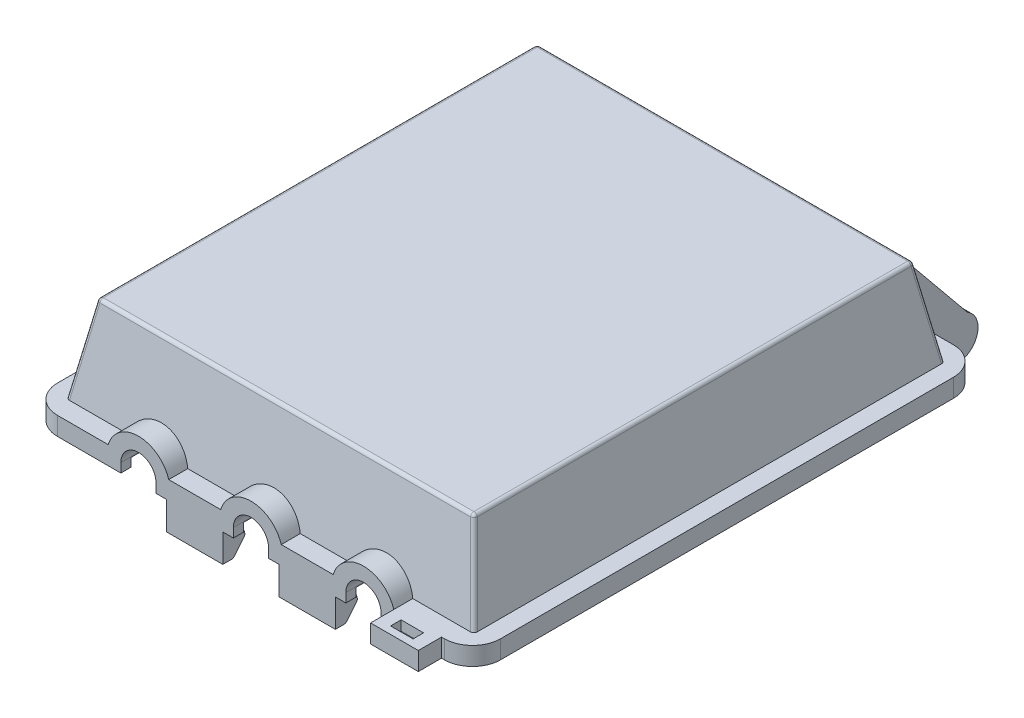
ISO-10303-21;
HEADER;
FILE_DESCRIPTION(('STEP AP214'),'2;1');
FILE_NAME('part.step','',(''),(''),'','','');
FILE_SCHEMA(('AUTOMOTIVE_DESIGN { 1 0 10303 214 1 1 1 1 }'));
ENDSEC;
DATA;
#1=APPLICATION_CONTEXT('core data for automotive mechanical design processes');
#2=APPLICATION_PROTOCOL_DEFINITION('international standard','automotive_design',2000,#1);
#3=PRODUCT_CONTEXT('',#1,'mechanical');
#4=PRODUCT('Part','Part','',(#3));
#5=PRODUCT_RELATED_PRODUCT_CATEGORY('part','',(#4));
#6=PRODUCT_DEFINITION_FORMATION('','',#4);
#7=PRODUCT_DEFINITION_CONTEXT('part definition',#1,'design');
#8=PRODUCT_DEFINITION('design','',#6,#7);
#9=PRODUCT_DEFINITION_SHAPE('','',#8);
#10=(LENGTH_UNIT() NAMED_UNIT(*) SI_UNIT(.MILLI.,.METRE.));
#11=(NAMED_UNIT(*) PLANE_ANGLE_UNIT() SI_UNIT($,.RADIAN.));
#12=(NAMED_UNIT(*) SI_UNIT($,.STERADIAN.) SOLID_ANGLE_UNIT());
#13=UNCERTAINTY_MEASURE_WITH_UNIT(LENGTH_MEASURE(1.E-05),#10,'distance_accuracy_value','');
#14=(GEOMETRIC_REPRESENTATION_CONTEXT(3) GLOBAL_UNCERTAINTY_ASSIGNED_CONTEXT((#13)) GLOBAL_UNIT_ASSIGNED_CONTEXT((#10,
#11,#12)) REPRESENTATION_CONTEXT('',''));
#15=CARTESIAN_POINT('',(0.,0.,0.));
#16=DIRECTION('',(0.,0.,1.));
#17=DIRECTION('',(1.,0.,0.));
#18=AXIS2_PLACEMENT_3D('',#15,#16,#17);
#19=CARTESIAN_POINT('',(0.,0.,0.));
#20=DIRECTION('',(0.,-1.,0.));
#21=DIRECTION('',(0.,0.,-1.));
#22=AXIS2_PLACEMENT_3D('',#19,#20,#21);
#23=PLANE('',#22);
#24=DIRECTION('',(1.,0.,0.));
#25=VECTOR('',#24,1.);
#26=CARTESIAN_POINT('',(-40.005,0.,45.974));
#27=LINE('',#26,#25);
#28=CARTESIAN_POINT('',(3.175,0.,45.974));
#29=VERTEX_POINT('',#28);
#30=CARTESIAN_POINT('',(5.08,0.,45.974));
#31=VERTEX_POINT('',#30);
#32=EDGE_CURVE('E1835',#29,#31,#27,.T.);
#33=ORIENTED_EDGE('',*,*,#32,.F.);
#34=DIRECTION('',(0.,0.,1.));
#35=VECTOR('',#34,1.);
#36=CARTESIAN_POINT('',(3.175,0.,33.274));
#37=LINE('',#36,#35);
#38=CARTESIAN_POINT('',(3.175,0.,44.1071));
#39=VERTEX_POINT('',#38);
#40=EDGE_CURVE('E1136',#39,#29,#37,.T.);
#41=ORIENTED_EDGE('',*,*,#40,.F.);
#42=DIRECTION('',(-1.,0.,0.));
#43=VECTOR('',#42,1.);
#44=CARTESIAN_POINT('',(-38.227,0.,44.1071));
#45=LINE('',#44,#43);
#46=CARTESIAN_POINT('',(17.145,0.,44.1071));
#47=VERTEX_POINT('',#46);
#48=EDGE_CURVE('E963',#47,#39,#45,.T.);
#49=ORIENTED_EDGE('',*,*,#48,.F.);
#50=DIRECTION('',(0.,0.,1.));
#51=VECTOR('',#50,1.);
#52=CARTESIAN_POINT('',(17.145,0.,33.274));
#53=LINE('',#52,#51);
#54=CARTESIAN_POINT('',(17.145,0.,45.974));
#55=VERTEX_POINT('',#54);
#56=EDGE_CURVE('E1121',#47,#55,#53,.T.);
#57=ORIENTED_EDGE('',*,*,#56,.T.);
#58=CARTESIAN_POINT('',(15.24,0.,45.974));
#59=VERTEX_POINT('',#58);
#60=EDGE_CURVE('E1331',#59,#55,#27,.T.);
#61=ORIENTED_EDGE('',*,*,#60,.F.);
#62=DIRECTION('',(0.,0.,1.));
#63=VECTOR('',#62,1.);
#64=CARTESIAN_POINT('',(15.24,0.,41.9817579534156));
#65=LINE('',#64,#63);
#66=CARTESIAN_POINT('',(15.24,0.,44.1241978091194));
#67=VERTEX_POINT('',#66);
#68=EDGE_CURVE('E864',#67,#59,#65,.T.);
#69=ORIENTED_EDGE('',*,*,#68,.F.);
#70=DIRECTION('',(-1.,0.,0.));
#71=VECTOR('',#70,1.);
#72=CARTESIAN_POINT('',(40.005,0.,44.1241978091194));
#73=LINE('',#72,#71);
#74=CARTESIAN_POINT('',(5.08,0.,44.1241978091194));
#75=VERTEX_POINT('',#74);
#76=EDGE_CURVE('E843',#67,#75,#73,.T.);
#77=ORIENTED_EDGE('',*,*,#76,.T.);
#78=DIRECTION('',(0.,0.,-1.));
#79=VECTOR('',#78,1.);
#80=CARTESIAN_POINT('',(5.08,0.,41.9817579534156));
#81=LINE('',#80,#79);
#82=EDGE_CURVE('E868',#31,#75,#81,.T.);
#83=ORIENTED_EDGE('',*,*,#82,.F.);
#84=EDGE_LOOP('',(#33,#41,#49,#57,#61,#69,#77,#83));
#85=FACE_BOUND('',#84,.T.);
#86=ADVANCED_FACE('F52',(#85),#23,.T.);
#87=DIRECTION('',(0.,0.,1.));
#88=VECTOR('',#87,1.);
#89=CARTESIAN_POINT('',(-17.145,0.,33.274));
#90=LINE('',#89,#88);
#91=CARTESIAN_POINT('',(-17.145,0.,44.1071));
#92=VERTEX_POINT('',#91);
#93=CARTESIAN_POINT('',(-17.145,0.,45.974));
#94=VERTEX_POINT('',#93);
#95=EDGE_CURVE('E1151',#92,#94,#90,.T.);
#96=ORIENTED_EDGE('',*,*,#95,.F.);
#97=CARTESIAN_POINT('',(-3.175,0.,44.1071));
#98=VERTEX_POINT('',#97);
#99=EDGE_CURVE('E1820',#98,#92,#45,.T.);
#100=ORIENTED_EDGE('',*,*,#99,.F.);
#101=DIRECTION('',(0.,0.,1.));
#102=VECTOR('',#101,1.);
#103=CARTESIAN_POINT('',(-3.175,0.,33.274));
#104=LINE('',#103,#102);
#105=CARTESIAN_POINT('',(-3.175,0.,45.974));
#106=VERTEX_POINT('',#105);
#107=EDGE_CURVE('E1138',#98,#106,#104,.T.);
#108=ORIENTED_EDGE('',*,*,#107,.T.);
#109=CARTESIAN_POINT('',(-5.08,0.,45.974));
#110=VERTEX_POINT('',#109);
#111=EDGE_CURVE('E1839',#110,#106,#27,.T.);
#112=ORIENTED_EDGE('',*,*,#111,.F.);
#113=DIRECTION('',(0.,0.,1.));
#114=VECTOR('',#113,1.);
#115=CARTESIAN_POINT('',(-5.08,0.,41.9817579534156));
#116=LINE('',#115,#114);
#117=CARTESIAN_POINT('',(-5.08,0.,44.1241978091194));
#118=VERTEX_POINT('',#117);
#119=EDGE_CURVE('E881',#118,#110,#116,.T.);
#120=ORIENTED_EDGE('',*,*,#119,.F.);
#121=CARTESIAN_POINT('',(-15.24,0.,44.1241978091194));
#122=VERTEX_POINT('',#121);
#123=EDGE_CURVE('E841',#118,#122,#73,.T.);
#124=ORIENTED_EDGE('',*,*,#123,.T.);
#125=DIRECTION('',(0.,0.,-1.));
#126=VECTOR('',#125,1.);
#127=CARTESIAN_POINT('',(-15.24,0.,41.9817579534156));
#128=LINE('',#127,#126);
#129=CARTESIAN_POINT('',(-15.24,0.,45.974));
#130=VERTEX_POINT('',#129);
#131=EDGE_CURVE('E885',#130,#122,#128,.T.);
#132=ORIENTED_EDGE('',*,*,#131,.F.);
#133=EDGE_CURVE('E1330',#94,#130,#27,.T.);
#134=ORIENTED_EDGE('',*,*,#133,.F.);
#135=EDGE_LOOP('',(#96,#100,#108,#112,#120,#124,#132,#134));
#136=FACE_BOUND('',#135,.T.);
#137=ADVANCED_FACE('F1736',(#136),#23,.T.);
#138=CARTESIAN_POINT('',(-38.227,1.524,44.1071));
#139=DIRECTION('',(0.,0.,1.));
#140=DIRECTION('',(1.,0.,0.));
#141=AXIS2_PLACEMENT_3D('',#138,#139,#140);
#142=PLANE('',#141);
#143=DIRECTION('',(-1.,0.,0.));
#144=VECTOR('',#143,1.);
#145=CARTESIAN_POINT('',(-38.227,1.524,44.1071));
#146=LINE('',#145,#144);
#147=CARTESIAN_POINT('',(26.6803274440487,1.524,44.1071));
#148=VERTEX_POINT('',#147);
#149=CARTESIAN_POINT('',(23.495,1.524,44.1071));
#150=VERTEX_POINT('',#149);
#151=EDGE_CURVE('E945',#148,#150,#146,.T.);
#152=ORIENTED_EDGE('',*,*,#151,.F.);
#153=DIRECTION('',(0.,-1.,0.));
#154=VECTOR('',#153,1.);
#155=CARTESIAN_POINT('',(26.6803274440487,1.524,44.1071));
#156=LINE('',#155,#154);
#157=CARTESIAN_POINT('',(26.6803274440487,0.,44.1071));
#158=VERTEX_POINT('',#157);
#159=EDGE_CURVE('E914',#148,#158,#156,.T.);
#160=ORIENTED_EDGE('',*,*,#159,.T.);
#161=CARTESIAN_POINT('',(23.495,0.,44.1071));
#162=VERTEX_POINT('',#161);
#163=EDGE_CURVE('E962',#158,#162,#45,.T.);
#164=ORIENTED_EDGE('',*,*,#163,.T.);
#165=DIRECTION('',(0.,-1.,0.));
#166=VECTOR('',#165,1.);
#167=CARTESIAN_POINT('',(23.495,0.,44.1071));
#168=LINE('',#167,#166);
#169=EDGE_CURVE('E997',#150,#162,#168,.T.);
#170=ORIENTED_EDGE('',*,*,#169,.F.);
#171=EDGE_LOOP('',(#152,#160,#164,#170));
#172=FACE_BOUND('',#171,.T.);
#173=ADVANCED_FACE('F1743',(#172),#142,.F.);
#174=CARTESIAN_POINT('',(0.,3.30200000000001,-42.545));
#175=DIRECTION('',(0.,0.177943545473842,-0.984040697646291));
#176=DIRECTION('',(0.,0.984040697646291,0.177943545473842));
#177=AXIS2_PLACEMENT_3D('',#174,#175,#176);
#178=PLANE('',#177);
#179=DIRECTION('',(-1.,0.,0.));
#180=VECTOR('',#179,1.);
#181=CARTESIAN_POINT('',(33.9822977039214,18.5279941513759,-39.7916917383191));
#182=LINE('',#181,#180);
#183=CARTESIAN_POINT('',(-33.4518258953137,18.5279941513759,-39.7916917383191));
#184=VERTEX_POINT('',#183);
#185=CARTESIAN_POINT('',(-31.75,18.5279941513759,-39.7916917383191));
#186=VERTEX_POINT('',#185);
#187=EDGE_CURVE('E1400',#184,#186,#182,.F.);
#188=ORIENTED_EDGE('',*,*,#187,.T.);
#189=DIRECTION('',(0.,-0.984040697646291,-0.177943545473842));
#190=VECTOR('',#189,1.);
#191=CARTESIAN_POINT('',(-31.75,3.30200000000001,-42.545));
#192=LINE('',#191,#190);
#193=CARTESIAN_POINT('',(-31.75,3.30200000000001,-42.545));
#194=VERTEX_POINT('',#193);
#195=EDGE_CURVE('E1620',#186,#194,#192,.T.);
#196=ORIENTED_EDGE('',*,*,#195,.T.);
#197=DIRECTION('',(-1.,0.,0.));
#198=VECTOR('',#197,1.);
#199=CARTESIAN_POINT('',(0.,3.30200000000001,-42.545));
#200=LINE('',#199,#198);
#201=CARTESIAN_POINT('',(-36.2051341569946,3.30200000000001,-42.545));
#202=VERTEX_POINT('',#201);
#203=EDGE_CURVE('E1357',#194,#202,#200,.T.);
#204=ORIENTED_EDGE('',*,*,#203,.T.);
#205=DIRECTION('',(0.175191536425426,0.968821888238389,0.175191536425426));
#206=VECTOR('',#205,1.);
#207=CARTESIAN_POINT('',(-35.0939234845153,9.44707552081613,-41.4337893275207));
#208=LINE('',#207,#206);
#209=EDGE_CURVE('E1403',#202,#184,#208,.T.);
#210=ORIENTED_EDGE('',*,*,#209,.T.);
#211=EDGE_LOOP('',(#188,#196,#204,#210));
#212=FACE_BOUND('',#211,.T.);
#213=ADVANCED_FACE('F2096',(#212),#178,.T.);
#214=DIRECTION('',(-1.,0.,0.));
#215=VECTOR('',#214,1.);
#216=CARTESIAN_POINT('',(0.,3.30200000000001,-42.545));
#217=LINE('',#216,#215);
#218=CARTESIAN_POINT('',(-13.335,3.30200000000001,-42.545));
#219=VERTEX_POINT('',#218);
#220=CARTESIAN_POINT('',(-28.067,3.30200000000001,-42.545));
#221=VERTEX_POINT('',#220);
#222=EDGE_CURVE('E1353',#219,#221,#217,.T.);
#223=ORIENTED_EDGE('',*,*,#222,.T.);
#224=DIRECTION('',(0.,-0.984040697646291,-0.177943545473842));
#225=VECTOR('',#224,1.);
#226=CARTESIAN_POINT('',(-28.067,3.30200000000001,-42.545));
#227=LINE('',#226,#225);
#228=CARTESIAN_POINT('',(-28.067,18.5279941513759,-39.7916917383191));
#229=VERTEX_POINT('',#228);
#230=EDGE_CURVE('E1612',#221,#229,#227,.F.);
#231=ORIENTED_EDGE('',*,*,#230,.T.);
#232=DIRECTION('',(-1.,0.,0.));
#233=VECTOR('',#232,1.);
#234=CARTESIAN_POINT('',(33.9822977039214,18.5279941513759,-39.7916917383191));
#235=LINE('',#234,#233);
#236=CARTESIAN_POINT('',(-13.335,18.5279941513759,-39.7916917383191));
#237=VERTEX_POINT('',#236);
#238=EDGE_CURVE('E1397',#229,#237,#235,.F.);
#239=ORIENTED_EDGE('',*,*,#238,.T.);
#240=DIRECTION('',(0.,-0.984040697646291,-0.177943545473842));
#241=VECTOR('',#240,1.);
#242=CARTESIAN_POINT('',(-13.335,3.30200000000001,-42.545));
#243=LINE('',#242,#241);
#244=EDGE_CURVE('E1610',#237,#219,#243,.T.);
#245=ORIENTED_EDGE('',*,*,#244,.T.);
#246=EDGE_LOOP('',(#223,#231,#239,#245));
#247=FACE_BOUND('',#246,.T.);
#248=ADVANCED_FACE('F3133',(#247),#178,.T.);
#249=DIRECTION('',(-1.,0.,0.));
#250=VECTOR('',#249,1.);
#251=CARTESIAN_POINT('',(0.,3.30200000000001,-42.545));
#252=LINE('',#251,#250);
#253=CARTESIAN_POINT('',(9.652,3.30200000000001,-42.545));
#254=VERTEX_POINT('',#253);
#255=CARTESIAN_POINT('',(-9.652,3.30200000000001,-42.545));
#256=VERTEX_POINT('',#255);
#257=EDGE_CURVE('E1356',#254,#256,#252,.T.);
#258=ORIENTED_EDGE('',*,*,#257,.T.);
#259=DIRECTION('',(0.,-0.984040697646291,-0.177943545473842));
#260=VECTOR('',#259,1.);
#261=CARTESIAN_POINT('',(-9.652,3.30200000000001,-42.545));
#262=LINE('',#261,#260);
#263=CARTESIAN_POINT('',(-9.65199999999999,18.5279941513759,-39.7916917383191));
#264=VERTEX_POINT('',#263);
#265=EDGE_CURVE('E1602',#256,#264,#262,.F.);
#266=ORIENTED_EDGE('',*,*,#265,.T.);
#267=DIRECTION('',(-1.,0.,0.));
#268=VECTOR('',#267,1.);
#269=CARTESIAN_POINT('',(33.9822977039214,18.5279941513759,-39.7916917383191));
#270=LINE('',#269,#268);
#271=CARTESIAN_POINT('',(9.65200000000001,18.5279941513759,-39.7916917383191));
#272=VERTEX_POINT('',#271);
#273=EDGE_CURVE('E1394',#264,#272,#270,.F.);
#274=ORIENTED_EDGE('',*,*,#273,.T.);
#275=DIRECTION('',(0.,-0.984040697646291,-0.177943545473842));
#276=VECTOR('',#275,1.);
#277=CARTESIAN_POINT('',(9.652,3.302,-42.545));
#278=LINE('',#277,#276);
#279=EDGE_CURVE('E1600',#272,#254,#278,.T.);
#280=ORIENTED_EDGE('',*,*,#279,.T.);
#281=EDGE_LOOP('',(#258,#266,#274,#280));
#282=FACE_BOUND('',#281,.T.);
#283=ADVANCED_FACE('F2177',(#282),#178,.T.);
#284=DIRECTION('',(-1.,0.,0.));
#285=VECTOR('',#284,1.);
#286=CARTESIAN_POINT('',(0.,3.30200000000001,-42.545));
#287=LINE('',#286,#285);
#288=CARTESIAN_POINT('',(28.067,3.30200000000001,-42.545));
#289=VERTEX_POINT('',#288);
#290=CARTESIAN_POINT('',(13.335,3.30200000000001,-42.545));
#291=VERTEX_POINT('',#290);
#292=EDGE_CURVE('E1360',#289,#291,#287,.T.);
#293=ORIENTED_EDGE('',*,*,#292,.T.);
#294=DIRECTION('',(0.,-0.984040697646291,-0.177943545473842));
#295=VECTOR('',#294,1.);
#296=CARTESIAN_POINT('',(13.335,3.30200000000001,-42.545));
#297=LINE('',#296,#295);
#298=CARTESIAN_POINT('',(13.335,18.5279941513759,-39.7916917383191));
#299=VERTEX_POINT('',#298);
#300=EDGE_CURVE('E1592',#291,#299,#297,.F.);
#301=ORIENTED_EDGE('',*,*,#300,.T.);
#302=DIRECTION('',(-1.,0.,0.));
#303=VECTOR('',#302,1.);
#304=CARTESIAN_POINT('',(33.9822977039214,18.5279941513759,-39.7916917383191));
#305=LINE('',#304,#303);
#306=CARTESIAN_POINT('',(28.067,18.5279941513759,-39.7916917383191));
#307=VERTEX_POINT('',#306);
#308=EDGE_CURVE('E1391',#299,#307,#305,.F.);
#309=ORIENTED_EDGE('',*,*,#308,.T.);
#310=DIRECTION('',(0.,-0.984040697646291,-0.177943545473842));
#311=VECTOR('',#310,1.);
#312=CARTESIAN_POINT('',(28.067,3.30200000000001,-42.545));
#313=LINE('',#312,#311);
#314=EDGE_CURVE('E1590',#307,#289,#313,.T.);
#315=ORIENTED_EDGE('',*,*,#314,.T.);
#316=EDGE_LOOP('',(#293,#301,#309,#315));
#317=FACE_BOUND('',#316,.T.);
#318=ADVANCED_FACE('F2144',(#317),#178,.T.);
#319=CARTESIAN_POINT('',(-40.005,19.05,45.974));
#320=DIRECTION('',(0.,0.,-1.));
#321=DIRECTION('',(-1.,0.,0.));
#322=AXIS2_PLACEMENT_3D('',#319,#320,#321);
#323=PLANE('',#322);
#324=CARTESIAN_POINT('',(34.417,0.,45.974));
#325=VERTEX_POINT('',#324);
#326=CARTESIAN_POINT('',(34.925,0.,45.974));
#327=VERTEX_POINT('',#326);
#328=EDGE_CURVE('E1326',#325,#327,#27,.T.);
#329=ORIENTED_EDGE('',*,*,#328,.T.);
#330=DIRECTION('',(0.,-1.,0.));
#331=VECTOR('',#330,1.);
#332=CARTESIAN_POINT('',(34.925,19.05,45.974));
#333=LINE('',#332,#331);
#334=CARTESIAN_POINT('',(34.925,3.30200000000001,45.974));
#335=VERTEX_POINT('',#334);
#336=EDGE_CURVE('E1516',#327,#335,#333,.F.);
#337=ORIENTED_EDGE('',*,*,#336,.T.);
#338=DIRECTION('',(1.,0.,0.));
#339=VECTOR('',#338,1.);
#340=CARTESIAN_POINT('',(-40.005,3.30200000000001,45.974));
#341=LINE('',#340,#339);
#342=CARTESIAN_POINT('',(34.417,3.30200000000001,45.974));
#343=VERTEX_POINT('',#342);
#344=EDGE_CURVE('E1329',#343,#335,#341,.T.);
#345=ORIENTED_EDGE('',*,*,#344,.F.);
#346=DIRECTION('',(0.,1.,0.));
#347=VECTOR('',#346,1.);
#348=CARTESIAN_POINT('',(34.417,0.,45.974));
#349=LINE('',#348,#347);
#350=EDGE_CURVE('E1096',#325,#343,#349,.T.);
#351=ORIENTED_EDGE('',*,*,#350,.F.);
#352=EDGE_LOOP('',(#329,#337,#345,#351));
#353=FACE_BOUND('',#352,.T.);
#354=ADVANCED_FACE('F1852',(#353),#323,.F.);
#355=CARTESIAN_POINT('',(0.,3.30200000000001,0.));
#356=DIRECTION('',(0.,1.,0.));
#357=DIRECTION('',(0.,0.,1.));
#358=AXIS2_PLACEMENT_3D('',#355,#356,#357);
#359=PLANE('',#358);
#360=DIRECTION('',(0.,0.,-1.));
#361=VECTOR('',#360,1.);
#362=CARTESIAN_POINT('',(32.1361637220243,3.30200000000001,46.9265));
#363=LINE('',#362,#361);
#364=CARTESIAN_POINT('',(32.1361637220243,3.30200000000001,48.8315));
#365=VERTEX_POINT('',#364);
#366=CARTESIAN_POINT('',(32.1361637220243,3.30200000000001,46.9265));
#367=VERTEX_POINT('',#366);
#368=EDGE_CURVE('E1058',#365,#367,#363,.T.);
#369=ORIENTED_EDGE('',*,*,#368,.F.);
#370=DIRECTION('',(1.,0.,0.));
#371=VECTOR('',#370,1.);
#372=CARTESIAN_POINT('',(28.0721637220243,3.30200000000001,48.8315));
#373=LINE('',#372,#371);
#374=CARTESIAN_POINT('',(28.0721637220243,3.30200000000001,48.8315));
#375=VERTEX_POINT('',#374);
#376=EDGE_CURVE('E1067',#375,#365,#373,.T.);
#377=ORIENTED_EDGE('',*,*,#376,.F.);
#378=DIRECTION('',(0.,0.,1.));
#379=VECTOR('',#378,1.);
#380=CARTESIAN_POINT('',(28.0721637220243,3.30200000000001,46.9265));
#381=LINE('',#380,#379);
#382=CARTESIAN_POINT('',(28.0721637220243,3.30200000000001,46.9265));
#383=VERTEX_POINT('',#382);
#384=EDGE_CURVE('E1064',#383,#375,#381,.T.);
#385=ORIENTED_EDGE('',*,*,#384,.F.);
#386=DIRECTION('',(-1.,0.,0.));
#387=VECTOR('',#386,1.);
#388=CARTESIAN_POINT('',(28.0721637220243,3.30200000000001,46.9265));
#389=LINE('',#388,#387);
#390=EDGE_CURVE('E1061',#367,#383,#389,.T.);
#391=ORIENTED_EDGE('',*,*,#390,.F.);
#392=EDGE_LOOP('',(#369,#377,#385,#391));
#393=FACE_BOUND('',#392,.T.);
#394=DIRECTION('',(0.,0.,1.));
#395=VECTOR('',#394,1.);
#396=CARTESIAN_POINT('',(31.115,3.30200000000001,0.));
#397=LINE('',#396,#395);
#398=CARTESIAN_POINT('',(31.115,3.30200000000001,-45.974));
#399=VERTEX_POINT('',#398);
#400=CARTESIAN_POINT('',(31.115,3.30200000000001,-43.1902985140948));
#401=VERTEX_POINT('',#400);
#402=EDGE_CURVE('E1296',#399,#401,#397,.T.);
#403=ORIENTED_EDGE('',*,*,#402,.T.);
#404=CARTESIAN_POINT('',(31.75,3.30200000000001,-43.1902985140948));
#405=DIRECTION('',(0.,1.,0.));
#406=DIRECTION('',(0.,0.,-1.));
#407=AXIS2_PLACEMENT_3D('',#404,#405,#406);
#408=ELLIPSE('',#407,0.645298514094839,0.635);
#409=CARTESIAN_POINT('',(31.75,3.30200000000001,-42.545));
#410=VERTEX_POINT('',#409);
#411=EDGE_CURVE('E1580',#401,#410,#408,.T.);
#412=ORIENTED_EDGE('',*,*,#411,.T.);
#413=DIRECTION('',(-1.,0.,0.));
#414=VECTOR('',#413,1.);
#415=CARTESIAN_POINT('',(0.,3.30200000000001,-42.545));
#416=LINE('',#415,#414);
#417=CARTESIAN_POINT('',(36.2051341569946,3.30200000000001,-42.545));
#418=VERTEX_POINT('',#417);
#419=EDGE_CURVE('E1363',#418,#410,#416,.T.);
#420=ORIENTED_EDGE('',*,*,#419,.F.);
#421=CARTESIAN_POINT('',(36.1847014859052,3.30200000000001,-41.8997014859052));
#422=DIRECTION('',(0.,1.,0.));
#423=DIRECTION('',(-0.707106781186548,0.,0.707106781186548));
#424=AXIS2_PLACEMENT_3D('',#421,#422,#423);
#425=ELLIPSE('',#424,0.655435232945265,0.635);
#426=CARTESIAN_POINT('',(36.83,3.30200000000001,-41.9201341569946));
#427=VERTEX_POINT('',#426);
#428=EDGE_CURVE('E1436',#418,#427,#425,.F.);
#429=ORIENTED_EDGE('',*,*,#428,.T.);
#430=DIRECTION('',(0.,0.,-1.));
#431=VECTOR('',#430,1.);
#432=CARTESIAN_POINT('',(36.83,3.30200000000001,0.));
#433=LINE('',#432,#431);
#434=CARTESIAN_POINT('',(36.83,3.30200000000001,41.9201341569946));
#435=VERTEX_POINT('',#434);
#436=EDGE_CURVE('E1302',#435,#427,#433,.T.);
#437=ORIENTED_EDGE('',*,*,#436,.F.);
#438=CARTESIAN_POINT('',(36.1847014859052,3.30200000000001,41.8997014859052));
#439=DIRECTION('',(0.,1.,0.));
#440=DIRECTION('',(-0.707106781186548,0.,-0.707106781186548));
#441=AXIS2_PLACEMENT_3D('',#438,#439,#440);
#442=ELLIPSE('',#441,0.655435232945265,0.635);
#443=CARTESIAN_POINT('',(36.2051341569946,3.30200000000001,42.545));
#444=VERTEX_POINT('',#443);
#445=EDGE_CURVE('E1440',#435,#444,#442,.F.);
#446=ORIENTED_EDGE('',*,*,#445,.T.);
#447=DIRECTION('',(1.,0.,0.));
#448=VECTOR('',#447,1.);
#449=CARTESIAN_POINT('',(0.,3.30200000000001,42.545));
#450=LINE('',#449,#448);
#451=CARTESIAN_POINT('',(25.7913274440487,3.30200000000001,42.545));
#452=VERTEX_POINT('',#451);
#453=EDGE_CURVE('E1369',#452,#444,#450,.T.);
#454=ORIENTED_EDGE('',*,*,#453,.F.);
#455=DIRECTION('',(0.,0.,-1.));
#456=VECTOR('',#455,1.);
#457=CARTESIAN_POINT('',(25.7913274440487,3.30200000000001,45.974));
#458=LINE('',#457,#456);
#459=CARTESIAN_POINT('',(25.7913274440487,3.302,45.974));
#460=VERTEX_POINT('',#459);
#461=EDGE_CURVE('E1162',#452,#460,#458,.F.);
#462=ORIENTED_EDGE('',*,*,#461,.T.);
#463=DIRECTION('',(0.,0.,1.));
#464=VECTOR('',#463,1.);
#465=CARTESIAN_POINT('',(25.7913274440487,3.30200000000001,45.974));
#466=LINE('',#465,#464);
#467=CARTESIAN_POINT('',(25.7913274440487,3.30200000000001,50.165));
#468=VERTEX_POINT('',#467);
#469=EDGE_CURVE('E1073',#460,#468,#466,.T.);
#470=ORIENTED_EDGE('',*,*,#469,.T.);
#471=DIRECTION('',(1.,0.,0.));
#472=VECTOR('',#471,1.);
#473=CARTESIAN_POINT('',(25.7913274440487,3.30200000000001,50.165));
#474=LINE('',#473,#472);
#475=CARTESIAN_POINT('',(34.417,3.30200000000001,50.165));
#476=VERTEX_POINT('',#475);
#477=EDGE_CURVE('E1091',#468,#476,#474,.T.);
#478=ORIENTED_EDGE('',*,*,#477,.T.);
#479=DIRECTION('',(0.,0.,-1.));
#480=VECTOR('',#479,1.);
#481=CARTESIAN_POINT('',(34.417,3.30200000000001,50.165));
#482=LINE('',#481,#480);
#483=EDGE_CURVE('E1083',#476,#343,#482,.T.);
#484=ORIENTED_EDGE('',*,*,#483,.T.);
#485=ORIENTED_EDGE('',*,*,#344,.T.);
#486=CARTESIAN_POINT('',(34.925,3.30200000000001,40.894));
#487=DIRECTION('',(0.,1.,0.));
#488=DIRECTION('',(0.,0.,1.));
#489=AXIS2_PLACEMENT_3D('',#486,#487,#488);
#490=CIRCLE('',#489,5.08);
#491=CARTESIAN_POINT('',(40.005,3.30200000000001,40.894));
#492=VERTEX_POINT('',#491);
#493=EDGE_CURVE('E1512',#335,#492,#490,.T.);
#494=ORIENTED_EDGE('',*,*,#493,.T.);
#495=DIRECTION('',(0.,0.,-1.));
#496=VECTOR('',#495,1.);
#497=CARTESIAN_POINT('',(40.005,3.30200000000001,45.974));
#498=LINE('',#497,#496);
#499=CARTESIAN_POINT('',(40.005,3.30200000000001,-40.894));
#500=VERTEX_POINT('',#499);
#501=EDGE_CURVE('E1310',#492,#500,#498,.T.);
#502=ORIENTED_EDGE('',*,*,#501,.T.);
#503=CARTESIAN_POINT('',(34.925,3.30200000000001,-40.894));
#504=DIRECTION('',(0.,1.,0.));
#505=DIRECTION('',(0.,0.,1.));
#506=AXIS2_PLACEMENT_3D('',#503,#504,#505);
#507=CIRCLE('',#506,5.08);
#508=CARTESIAN_POINT('',(34.925,3.30200000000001,-45.974));
#509=VERTEX_POINT('',#508);
#510=EDGE_CURVE('E1514',#500,#509,#507,.T.);
#511=ORIENTED_EDGE('',*,*,#510,.T.);
#512=DIRECTION('',(-1.,0.,0.));
#513=VECTOR('',#512,1.);
#514=CARTESIAN_POINT('',(-40.005,3.30200000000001,-45.974));
#515=LINE('',#514,#513);
#516=EDGE_CURVE('E1308',#509,#399,#515,.T.);
#517=ORIENTED_EDGE('',*,*,#516,.T.);
#518=EDGE_LOOP('',(#403,#412,#420,#429,#437,#446,#454,#462,#470,#478,#484,#485,#494,#502,#511,#517));
#519=FACE_BOUND('',#518,.T.);
#520=ADVANCED_FACE('F1862',(#393,#519),#359,.T.);
#521=CARTESIAN_POINT('',(5.47132744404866,3.30200000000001,45.974));
#522=VERTEX_POINT('',#521);
#523=CARTESIAN_POINT('',(14.8486725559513,3.302,45.974));
#524=VERTEX_POINT('',#523);
#525=EDGE_CURVE('E1336',#522,#524,#341,.T.);
#526=ORIENTED_EDGE('',*,*,#525,.T.);
#527=DIRECTION('',(0.,0.,-1.));
#528=VECTOR('',#527,1.);
#529=CARTESIAN_POINT('',(14.8486725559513,3.30200000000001,45.974));
#530=LINE('',#529,#528);
#531=CARTESIAN_POINT('',(14.8486725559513,3.30200000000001,42.545));
#532=VERTEX_POINT('',#531);
#533=EDGE_CURVE('E1159',#524,#532,#530,.T.);
#534=ORIENTED_EDGE('',*,*,#533,.T.);
#535=DIRECTION('',(1.,0.,0.));
#536=VECTOR('',#535,1.);
#537=CARTESIAN_POINT('',(0.,3.30200000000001,42.545));
#538=LINE('',#537,#536);
#539=CARTESIAN_POINT('',(5.47132744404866,3.30200000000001,42.545));
#540=VERTEX_POINT('',#539);
#541=EDGE_CURVE('E1372',#540,#532,#538,.T.);
#542=ORIENTED_EDGE('',*,*,#541,.F.);
#543=DIRECTION('',(0.,0.,-1.));
#544=VECTOR('',#543,1.);
#545=CARTESIAN_POINT('',(5.47132744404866,3.30200000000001,45.974));
#546=LINE('',#545,#544);
#547=EDGE_CURVE('E1180',#540,#522,#546,.F.);
#548=ORIENTED_EDGE('',*,*,#547,.T.);
#549=EDGE_LOOP('',(#526,#534,#542,#548));
#550=FACE_BOUND('',#549,.T.);
#551=ADVANCED_FACE('F3094',(#550),#359,.T.);
#552=DIRECTION('',(1.,0.,0.));
#553=VECTOR('',#552,1.);
#554=CARTESIAN_POINT('',(0.,3.30200000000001,42.545));
#555=LINE('',#554,#553);
#556=CARTESIAN_POINT('',(-14.8486725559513,3.30200000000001,42.545));
#557=VERTEX_POINT('',#556);
#558=CARTESIAN_POINT('',(-5.47132744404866,3.30200000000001,42.545));
#559=VERTEX_POINT('',#558);
#560=EDGE_CURVE('E1378',#557,#559,#555,.T.);
#561=ORIENTED_EDGE('',*,*,#560,.F.);
#562=DIRECTION('',(0.,0.,-1.));
#563=VECTOR('',#562,1.);
#564=CARTESIAN_POINT('',(-14.8486725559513,3.30200000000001,45.974));
#565=LINE('',#564,#563);
#566=CARTESIAN_POINT('',(-14.8486725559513,3.302,45.974));
#567=VERTEX_POINT('',#566);
#568=EDGE_CURVE('E1171',#557,#567,#565,.F.);
#569=ORIENTED_EDGE('',*,*,#568,.T.);
#570=CARTESIAN_POINT('',(-5.47132744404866,3.30200000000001,45.974));
#571=VERTEX_POINT('',#570);
#572=EDGE_CURVE('E1335',#567,#571,#341,.T.);
#573=ORIENTED_EDGE('',*,*,#572,.T.);
#574=DIRECTION('',(0.,0.,-1.));
#575=VECTOR('',#574,1.);
#576=CARTESIAN_POINT('',(-5.47132744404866,3.30200000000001,45.974));
#577=LINE('',#576,#575);
#578=EDGE_CURVE('E1177',#571,#559,#577,.T.);
#579=ORIENTED_EDGE('',*,*,#578,.T.);
#580=EDGE_LOOP('',(#561,#569,#573,#579));
#581=FACE_BOUND('',#580,.T.);
#582=ADVANCED_FACE('F3086',(#581),#359,.T.);
#583=ORIENTED_EDGE('',*,*,#203,.F.);
#584=CARTESIAN_POINT('',(-31.75,3.30200000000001,-43.1902985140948));
#585=DIRECTION('',(0.,1.,0.));
#586=DIRECTION('',(0.,0.,-1.));
#587=AXIS2_PLACEMENT_3D('',#584,#585,#586);
#588=ELLIPSE('',#587,0.645298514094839,0.635);
#589=CARTESIAN_POINT('',(-31.115,3.30200000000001,-43.1902985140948));
#590=VERTEX_POINT('',#589);
#591=EDGE_CURVE('E1622',#194,#590,#588,.T.);
#592=ORIENTED_EDGE('',*,*,#591,.T.);
#593=DIRECTION('',(0.,0.,-1.));
#594=VECTOR('',#593,1.);
#595=CARTESIAN_POINT('',(-31.115,3.30200000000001,0.));
#596=LINE('',#595,#594);
#597=CARTESIAN_POINT('',(-31.115,3.30200000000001,-45.974));
#598=VERTEX_POINT('',#597);
#599=EDGE_CURVE('E1280',#590,#598,#596,.T.);
#600=ORIENTED_EDGE('',*,*,#599,.T.);
#601=CARTESIAN_POINT('',(-34.925,3.30200000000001,-45.974));
#602=VERTEX_POINT('',#601);
#603=EDGE_CURVE('E1306',#598,#602,#515,.T.);
#604=ORIENTED_EDGE('',*,*,#603,.T.);
#605=CARTESIAN_POINT('',(-34.925,3.30200000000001,-40.894));
#606=DIRECTION('',(0.,1.,0.));
#607=DIRECTION('',(0.,0.,1.));
#608=AXIS2_PLACEMENT_3D('',#605,#606,#607);
#609=CIRCLE('',#608,5.08);
#610=CARTESIAN_POINT('',(-40.005,3.30200000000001,-40.894));
#611=VERTEX_POINT('',#610);
#612=EDGE_CURVE('E1498',#602,#611,#609,.T.);
#613=ORIENTED_EDGE('',*,*,#612,.T.);
#614=DIRECTION('',(0.,0.,1.));
#615=VECTOR('',#614,1.);
#616=CARTESIAN_POINT('',(-40.005,3.30200000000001,45.974));
#617=LINE('',#616,#615);
#618=CARTESIAN_POINT('',(-40.005,3.30200000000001,40.894));
#619=VERTEX_POINT('',#618);
#620=EDGE_CURVE('E1303',#611,#619,#617,.T.);
#621=ORIENTED_EDGE('',*,*,#620,.T.);
#622=CARTESIAN_POINT('',(-34.925,3.30200000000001,40.894));
#623=DIRECTION('',(0.,1.,0.));
#624=DIRECTION('',(0.,0.,1.));
#625=AXIS2_PLACEMENT_3D('',#622,#623,#624);
#626=CIRCLE('',#625,5.08);
#627=CARTESIAN_POINT('',(-34.925,3.30200000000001,45.974));
#628=VERTEX_POINT('',#627);
#629=EDGE_CURVE('E1500',#619,#628,#626,.T.);
#630=ORIENTED_EDGE('',*,*,#629,.T.);
#631=CARTESIAN_POINT('',(-25.7913274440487,3.30200000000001,45.974));
#632=VERTEX_POINT('',#631);
#633=EDGE_CURVE('E1332',#628,#632,#341,.T.);
#634=ORIENTED_EDGE('',*,*,#633,.T.);
#635=DIRECTION('',(0.,0.,-1.));
#636=VECTOR('',#635,1.);
#637=CARTESIAN_POINT('',(-25.7913274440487,3.30200000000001,45.974));
#638=LINE('',#637,#636);
#639=CARTESIAN_POINT('',(-25.7913274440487,3.30200000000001,42.545));
#640=VERTEX_POINT('',#639);
#641=EDGE_CURVE('E1168',#632,#640,#638,.T.);
#642=ORIENTED_EDGE('',*,*,#641,.T.);
#643=DIRECTION('',(1.,0.,0.));
#644=VECTOR('',#643,1.);
#645=CARTESIAN_POINT('',(0.,3.30200000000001,42.545));
#646=LINE('',#645,#644);
#647=CARTESIAN_POINT('',(-36.2051341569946,3.30200000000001,42.545));
#648=VERTEX_POINT('',#647);
#649=EDGE_CURVE('E1307',#648,#640,#646,.T.);
#650=ORIENTED_EDGE('',*,*,#649,.F.);
#651=CARTESIAN_POINT('',(-36.1847014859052,3.30200000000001,41.8997014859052));
#652=DIRECTION('',(0.,1.,0.));
#653=DIRECTION('',(0.707106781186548,0.,-0.707106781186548));
#654=AXIS2_PLACEMENT_3D('',#651,#652,#653);
#655=ELLIPSE('',#654,0.655435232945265,0.635);
#656=CARTESIAN_POINT('',(-36.83,3.30200000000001,41.9201341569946));
#657=VERTEX_POINT('',#656);
#658=EDGE_CURVE('E1438',#648,#657,#655,.F.);
#659=ORIENTED_EDGE('',*,*,#658,.T.);
#660=DIRECTION('',(0.,0.,1.));
#661=VECTOR('',#660,1.);
#662=CARTESIAN_POINT('',(-36.83,3.30200000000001,0.));
#663=LINE('',#662,#661);
#664=CARTESIAN_POINT('',(-36.83,3.30200000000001,-41.9201341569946));
#665=VERTEX_POINT('',#664);
#666=EDGE_CURVE('E1366',#665,#657,#663,.T.);
#667=ORIENTED_EDGE('',*,*,#666,.F.);
#668=CARTESIAN_POINT('',(-36.1847014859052,3.30200000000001,-41.8997014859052));
#669=DIRECTION('',(0.,1.,0.));
#670=DIRECTION('',(0.707106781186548,0.,0.707106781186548));
#671=AXIS2_PLACEMENT_3D('',#668,#669,#670);
#672=ELLIPSE('',#671,0.655435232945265,0.635);
#673=EDGE_CURVE('E1433',#665,#202,#672,.F.);
#674=ORIENTED_EDGE('',*,*,#673,.T.);
#675=EDGE_LOOP('',(#583,#592,#600,#604,#613,#621,#630,#634,#642,#650,#659,#667,#674));
#676=FACE_BOUND('',#675,.T.);
#677=ADVANCED_FACE('F1759',(#676),#359,.T.);
#678=CARTESIAN_POINT('',(-40.005,19.05,-45.974));
#679=DIRECTION('',(0.,0.,1.));
#680=DIRECTION('',(1.,0.,0.));
#681=AXIS2_PLACEMENT_3D('',#678,#679,#680);
#682=PLANE('',#681);
#683=DIRECTION('',(0.,-1.,0.));
#684=VECTOR('',#683,1.);
#685=CARTESIAN_POINT('',(-10.287,19.05,-45.974));
#686=LINE('',#685,#684);
#687=CARTESIAN_POINT('',(-10.287,3.30200000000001,-45.974));
#688=VERTEX_POINT('',#687);
#689=CARTESIAN_POINT('',(-10.287,0.,-45.974));
#690=VERTEX_POINT('',#689);
#691=EDGE_CURVE('E1266',#688,#690,#686,.T.);
#692=ORIENTED_EDGE('',*,*,#691,.F.);
#693=CARTESIAN_POINT('',(10.287,3.30200000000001,-45.974));
#694=VERTEX_POINT('',#693);
#695=EDGE_CURVE('E3475',#694,#688,#515,.T.);
#696=ORIENTED_EDGE('',*,*,#695,.F.);
#697=DIRECTION('',(0.,1.,0.));
#698=VECTOR('',#697,1.);
#699=CARTESIAN_POINT('',(10.287,19.05,-45.974));
#700=LINE('',#699,#698);
#701=CARTESIAN_POINT('',(10.287,0.,-45.974));
#702=VERTEX_POINT('',#701);
#703=EDGE_CURVE('E1271',#702,#694,#700,.T.);
#704=ORIENTED_EDGE('',*,*,#703,.F.);
#705=DIRECTION('',(-1.,0.,0.));
#706=VECTOR('',#705,1.);
#707=CARTESIAN_POINT('',(-40.005,0.,-45.974));
#708=LINE('',#707,#706);
#709=EDGE_CURVE('E3432',#702,#690,#708,.T.);
#710=ORIENTED_EDGE('',*,*,#709,.T.);
#711=EDGE_LOOP('',(#692,#696,#704,#710));
#712=FACE_BOUND('',#711,.T.);
#713=ADVANCED_FACE('F1760',(#712),#682,.F.);
#714=DIRECTION('',(0.,1.,0.));
#715=VECTOR('',#714,1.);
#716=CARTESIAN_POINT('',(-12.7,19.05,-45.974));
#717=LINE('',#716,#715);
#718=CARTESIAN_POINT('',(-12.7,0.,-45.974));
#719=VERTEX_POINT('',#718);
#720=CARTESIAN_POINT('',(-12.7,3.30200000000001,-45.974));
#721=VERTEX_POINT('',#720);
#722=EDGE_CURVE('E1260',#719,#721,#717,.T.);
#723=ORIENTED_EDGE('',*,*,#722,.F.);
#724=CARTESIAN_POINT('',(-28.702,0.,-45.974));
#725=VERTEX_POINT('',#724);
#726=EDGE_CURVE('E1323',#719,#725,#708,.T.);
#727=ORIENTED_EDGE('',*,*,#726,.T.);
#728=DIRECTION('',(0.,-1.,0.));
#729=VECTOR('',#728,1.);
#730=CARTESIAN_POINT('',(-28.702,19.05,-45.974));
#731=LINE('',#730,#729);
#732=CARTESIAN_POINT('',(-28.702,3.30200000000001,-45.974));
#733=VERTEX_POINT('',#732);
#734=EDGE_CURVE('E1288',#733,#725,#731,.T.);
#735=ORIENTED_EDGE('',*,*,#734,.F.);
#736=EDGE_CURVE('E1312',#721,#733,#515,.T.);
#737=ORIENTED_EDGE('',*,*,#736,.F.);
#738=EDGE_LOOP('',(#723,#727,#735,#737));
#739=FACE_BOUND('',#738,.T.);
#740=ADVANCED_FACE('F1750',(#739),#682,.F.);
#741=DIRECTION('',(-1.,0.,0.));
#742=VECTOR('',#741,1.);
#743=CARTESIAN_POINT('',(26.6803274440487,0.,49.276));
#744=LINE('',#743,#742);
#745=CARTESIAN_POINT('',(33.528,0.,49.276));
#746=VERTEX_POINT('',#745);
#747=CARTESIAN_POINT('',(26.6803274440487,0.,49.276));
#748=VERTEX_POINT('',#747);
#749=EDGE_CURVE('E909',#746,#748,#744,.T.);
#750=ORIENTED_EDGE('',*,*,#749,.F.);
#751=DIRECTION('',(0.,0.,1.));
#752=VECTOR('',#751,1.);
#753=CARTESIAN_POINT('',(33.528,0.,49.276));
#754=LINE('',#753,#752);
#755=CARTESIAN_POINT('',(33.528,0.,44.1071));
#756=VERTEX_POINT('',#755);
#757=EDGE_CURVE('E907',#756,#746,#754,.T.);
#758=ORIENTED_EDGE('',*,*,#757,.F.);
#759=CARTESIAN_POINT('',(34.671,0.,44.1071));
#760=VERTEX_POINT('',#759);
#761=EDGE_CURVE('E958',#760,#756,#45,.T.);
#762=ORIENTED_EDGE('',*,*,#761,.F.);
#763=CARTESIAN_POINT('',(34.671,0.,40.5511));
#764=DIRECTION('',(0.,-1.,0.));
#765=DIRECTION('',(0.,0.,-1.));
#766=AXIS2_PLACEMENT_3D('',#763,#764,#765);
#767=CIRCLE('',#766,3.556);
#768=CARTESIAN_POINT('',(38.227,0.,40.5511));
#769=VERTEX_POINT('',#768);
#770=EDGE_CURVE('E1548',#760,#769,#767,.F.);
#771=ORIENTED_EDGE('',*,*,#770,.T.);
#772=DIRECTION('',(0.,0.,1.));
#773=VECTOR('',#772,1.);
#774=CARTESIAN_POINT('',(38.227,0.,-44.1071));
#775=LINE('',#774,#773);
#776=CARTESIAN_POINT('',(38.227,0.,-40.5511));
#777=VERTEX_POINT('',#776);
#778=EDGE_CURVE('E953',#777,#769,#775,.T.);
#779=ORIENTED_EDGE('',*,*,#778,.F.);
#780=CARTESIAN_POINT('',(34.671,0.,-40.5511));
#781=DIRECTION('',(0.,-1.,0.));
#782=DIRECTION('',(0.,0.,-1.));
#783=AXIS2_PLACEMENT_3D('',#780,#781,#782);
#784=CIRCLE('',#783,3.556);
#785=CARTESIAN_POINT('',(34.671,0.,-44.1071));
#786=VERTEX_POINT('',#785);
#787=EDGE_CURVE('E1546',#777,#786,#784,.F.);
#788=ORIENTED_EDGE('',*,*,#787,.T.);
#789=DIRECTION('',(1.,0.,0.));
#790=VECTOR('',#789,1.);
#791=CARTESIAN_POINT('',(-38.227,0.,-44.1071));
#792=LINE('',#791,#790);
#793=CARTESIAN_POINT('',(-34.671,0.,-44.1071));
#794=VERTEX_POINT('',#793);
#795=EDGE_CURVE('E940',#794,#786,#792,.T.);
#796=ORIENTED_EDGE('',*,*,#795,.F.);
#797=CARTESIAN_POINT('',(-34.671,0.,-40.5511));
#798=DIRECTION('',(0.,-1.,0.));
#799=DIRECTION('',(0.,0.,-1.));
#800=AXIS2_PLACEMENT_3D('',#797,#798,#799);
#801=CIRCLE('',#800,3.556);
#802=CARTESIAN_POINT('',(-38.227,0.,-40.5511));
#803=VERTEX_POINT('',#802);
#804=EDGE_CURVE('E1550',#794,#803,#801,.F.);
#805=ORIENTED_EDGE('',*,*,#804,.T.);
#806=DIRECTION('',(0.,0.,-1.));
#807=VECTOR('',#806,1.);
#808=CARTESIAN_POINT('',(-38.227,0.,-44.1071));
#809=LINE('',#808,#807);
#810=CARTESIAN_POINT('',(-38.227,0.,40.5511));
#811=VERTEX_POINT('',#810);
#812=EDGE_CURVE('E961',#811,#803,#809,.T.);
#813=ORIENTED_EDGE('',*,*,#812,.F.);
#814=CARTESIAN_POINT('',(-34.671,0.,40.5511));
#815=DIRECTION('',(0.,-1.,0.));
#816=DIRECTION('',(0.,0.,-1.));
#817=AXIS2_PLACEMENT_3D('',#814,#815,#816);
#818=CIRCLE('',#817,3.556);
#819=CARTESIAN_POINT('',(-34.671,0.,44.1071));
#820=VERTEX_POINT('',#819);
#821=EDGE_CURVE('E1552',#811,#820,#818,.F.);
#822=ORIENTED_EDGE('',*,*,#821,.T.);
#823=CARTESIAN_POINT('',(-23.495,0.,44.1071));
#824=VERTEX_POINT('',#823);
#825=EDGE_CURVE('E956',#824,#820,#45,.T.);
#826=ORIENTED_EDGE('',*,*,#825,.F.);
#827=DIRECTION('',(0.,0.,1.));
#828=VECTOR('',#827,1.);
#829=CARTESIAN_POINT('',(-23.495,0.,33.274));
#830=LINE('',#829,#828);
#831=CARTESIAN_POINT('',(-23.495,0.,45.974));
#832=VERTEX_POINT('',#831);
#833=EDGE_CURVE('E1153',#824,#832,#830,.T.);
#834=ORIENTED_EDGE('',*,*,#833,.T.);
#835=CARTESIAN_POINT('',(-34.925,0.,45.974));
#836=VERTEX_POINT('',#835);
#837=EDGE_CURVE('E1327',#836,#832,#27,.T.);
#838=ORIENTED_EDGE('',*,*,#837,.F.);
#839=CARTESIAN_POINT('',(-34.925,0.,40.894));
#840=DIRECTION('',(0.,-1.,0.));
#841=DIRECTION('',(0.,0.,-1.));
#842=AXIS2_PLACEMENT_3D('',#839,#840,#841);
#843=CIRCLE('',#842,5.08);
#844=CARTESIAN_POINT('',(-40.005,0.,40.894));
#845=VERTEX_POINT('',#844);
#846=EDGE_CURVE('E1491',#836,#845,#843,.T.);
#847=ORIENTED_EDGE('',*,*,#846,.T.);
#848=DIRECTION('',(0.,0.,1.));
#849=VECTOR('',#848,1.);
#850=CARTESIAN_POINT('',(-40.005,0.,45.974));
#851=LINE('',#850,#849);
#852=CARTESIAN_POINT('',(-40.005,0.,-40.894));
#853=VERTEX_POINT('',#852);
#854=EDGE_CURVE('E1321',#853,#845,#851,.T.);
#855=ORIENTED_EDGE('',*,*,#854,.F.);
#856=CARTESIAN_POINT('',(-34.925,0.,-40.894));
#857=DIRECTION('',(0.,-1.,0.));
#858=DIRECTION('',(0.,0.,-1.));
#859=AXIS2_PLACEMENT_3D('',#856,#857,#858);
#860=CIRCLE('',#859,5.08);
#861=CARTESIAN_POINT('',(-34.925,0.,-45.974));
#862=VERTEX_POINT('',#861);
#863=EDGE_CURVE('E1489',#853,#862,#860,.T.);
#864=ORIENTED_EDGE('',*,*,#863,.T.);
#865=CARTESIAN_POINT('',(-31.115,0.,-45.974));
#866=VERTEX_POINT('',#865);
#867=EDGE_CURVE('E1318',#866,#862,#708,.T.);
#868=ORIENTED_EDGE('',*,*,#867,.F.);
#869=DIRECTION('',(0.,0.,1.));
#870=VECTOR('',#869,1.);
#871=CARTESIAN_POINT('',(-31.115,0.,-54.229));
#872=LINE('',#871,#870);
#873=CARTESIAN_POINT('',(-31.115,0.,-46.609));
#874=VERTEX_POINT('',#873);
#875=EDGE_CURVE('E1251',#874,#866,#872,.T.);
#876=ORIENTED_EDGE('',*,*,#875,.F.);
#877=DIRECTION('',(1.,0.,0.));
#878=VECTOR('',#877,1.);
#879=CARTESIAN_POINT('',(-40.005,0.,-46.609));
#880=LINE('',#879,#878);
#881=CARTESIAN_POINT('',(-28.702,0.,-46.609));
#882=VERTEX_POINT('',#881);
#883=EDGE_CURVE('E1224',#874,#882,#880,.T.);
#884=ORIENTED_EDGE('',*,*,#883,.T.);
#885=DIRECTION('',(0.,0.,-1.));
#886=VECTOR('',#885,1.);
#887=CARTESIAN_POINT('',(-28.702,0.,-54.229));
#888=LINE('',#887,#886);
#889=EDGE_CURVE('E1253',#725,#882,#888,.T.);
#890=ORIENTED_EDGE('',*,*,#889,.F.);
#891=ORIENTED_EDGE('',*,*,#726,.F.);
#892=DIRECTION('',(0.,0.,1.));
#893=VECTOR('',#892,1.);
#894=CARTESIAN_POINT('',(-12.7,0.,-54.229));
#895=LINE('',#894,#893);
#896=CARTESIAN_POINT('',(-12.7,0.,-46.609));
#897=VERTEX_POINT('',#896);
#898=EDGE_CURVE('E1334',#897,#719,#895,.T.);
#899=ORIENTED_EDGE('',*,*,#898,.F.);
#900=CARTESIAN_POINT('',(-10.287,0.,-46.609));
#901=VERTEX_POINT('',#900);
#902=EDGE_CURVE('E3442',#897,#901,#880,.T.);
#903=ORIENTED_EDGE('',*,*,#902,.T.);
#904=DIRECTION('',(0.,0.,-1.));
#905=VECTOR('',#904,1.);
#906=CARTESIAN_POINT('',(-10.287,0.,-54.229));
#907=LINE('',#906,#905);
#908=EDGE_CURVE('E1243',#690,#901,#907,.T.);
#909=ORIENTED_EDGE('',*,*,#908,.F.);
#910=ORIENTED_EDGE('',*,*,#709,.F.);
#911=DIRECTION('',(0.,0.,1.));
#912=VECTOR('',#911,1.);
#913=CARTESIAN_POINT('',(10.287,0.,-54.229));
#914=LINE('',#913,#912);
#915=CARTESIAN_POINT('',(10.287,0.,-46.609));
#916=VERTEX_POINT('',#915);
#917=EDGE_CURVE('E1246',#916,#702,#914,.T.);
#918=ORIENTED_EDGE('',*,*,#917,.F.);
#919=CARTESIAN_POINT('',(12.7,0.,-46.609));
#920=VERTEX_POINT('',#919);
#921=EDGE_CURVE('E1223',#916,#920,#880,.T.);
#922=ORIENTED_EDGE('',*,*,#921,.T.);
#923=DIRECTION('',(0.,0.,-1.));
#924=VECTOR('',#923,1.);
#925=CARTESIAN_POINT('',(12.7,0.,-54.229));
#926=LINE('',#925,#924);
#927=CARTESIAN_POINT('',(12.7,0.,-45.974));
#928=VERTEX_POINT('',#927);
#929=EDGE_CURVE('E1248',#928,#920,#926,.T.);
#930=ORIENTED_EDGE('',*,*,#929,.F.);
#931=CARTESIAN_POINT('',(28.702,0.,-45.974));
#932=VERTEX_POINT('',#931);
#933=EDGE_CURVE('E1322',#932,#928,#708,.T.);
#934=ORIENTED_EDGE('',*,*,#933,.F.);
#935=DIRECTION('',(0.,0.,1.));
#936=VECTOR('',#935,1.);
#937=CARTESIAN_POINT('',(28.702,0.,-54.229));
#938=LINE('',#937,#936);
#939=CARTESIAN_POINT('',(28.702,0.,-46.609));
#940=VERTEX_POINT('',#939);
#941=EDGE_CURVE('E1256',#940,#932,#938,.T.);
#942=ORIENTED_EDGE('',*,*,#941,.F.);
#943=CARTESIAN_POINT('',(31.115,0.,-46.609));
#944=VERTEX_POINT('',#943);
#945=EDGE_CURVE('E1221',#940,#944,#880,.T.);
#946=ORIENTED_EDGE('',*,*,#945,.T.);
#947=DIRECTION('',(0.,0.,1.));
#948=VECTOR('',#947,1.);
#949=CARTESIAN_POINT('',(31.115,0.,-42.545));
#950=LINE('',#949,#948);
#951=CARTESIAN_POINT('',(31.115,0.,-45.974));
#952=VERTEX_POINT('',#951);
#953=EDGE_CURVE('E1218',#944,#952,#950,.T.);
#954=ORIENTED_EDGE('',*,*,#953,.T.);
#955=CARTESIAN_POINT('',(34.925,0.,-45.974));
#956=VERTEX_POINT('',#955);
#957=EDGE_CURVE('E1319',#956,#952,#708,.T.);
#958=ORIENTED_EDGE('',*,*,#957,.F.);
#959=CARTESIAN_POINT('',(34.925,0.,-40.894));
#960=DIRECTION('',(0.,-1.,0.));
#961=DIRECTION('',(0.,0.,-1.));
#962=AXIS2_PLACEMENT_3D('',#959,#960,#961);
#963=CIRCLE('',#962,5.08);
#964=CARTESIAN_POINT('',(40.005,0.,-40.894));
#965=VERTEX_POINT('',#964);
#966=EDGE_CURVE('E1487',#956,#965,#963,.T.);
#967=ORIENTED_EDGE('',*,*,#966,.T.);
#968=DIRECTION('',(0.,0.,-1.));
#969=VECTOR('',#968,1.);
#970=CARTESIAN_POINT('',(40.005,0.,45.974));
#971=LINE('',#970,#969);
#972=CARTESIAN_POINT('',(40.005,0.,40.894));
#973=VERTEX_POINT('',#972);
#974=EDGE_CURVE('E1315',#973,#965,#971,.T.);
#975=ORIENTED_EDGE('',*,*,#974,.F.);
#976=CARTESIAN_POINT('',(34.925,0.,40.894));
#977=DIRECTION('',(0.,-1.,0.));
#978=DIRECTION('',(0.,0.,-1.));
#979=AXIS2_PLACEMENT_3D('',#976,#977,#978);
#980=CIRCLE('',#979,5.08);
#981=EDGE_CURVE('E1485',#973,#327,#980,.T.);
#982=ORIENTED_EDGE('',*,*,#981,.T.);
#983=ORIENTED_EDGE('',*,*,#328,.F.);
#984=DIRECTION('',(0.,0.,-1.));
#985=VECTOR('',#984,1.);
#986=CARTESIAN_POINT('',(34.417,0.,50.165));
#987=LINE('',#986,#985);
#988=CARTESIAN_POINT('',(34.417,0.,50.165));
#989=VERTEX_POINT('',#988);
#990=EDGE_CURVE('E1086',#989,#325,#987,.T.);
#991=ORIENTED_EDGE('',*,*,#990,.F.);
#992=DIRECTION('',(1.,0.,0.));
#993=VECTOR('',#992,1.);
#994=CARTESIAN_POINT('',(25.7913274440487,0.,50.165));
#995=LINE('',#994,#993);
#996=CARTESIAN_POINT('',(25.7913274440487,0.,50.165));
#997=VERTEX_POINT('',#996);
#998=EDGE_CURVE('E1082',#997,#989,#995,.T.);
#999=ORIENTED_EDGE('',*,*,#998,.F.);
#1000=DIRECTION('',(0.,0.,1.));
#1001=VECTOR('',#1000,1.);
#1002=CARTESIAN_POINT('',(25.7913274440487,0.,45.974));
#1003=LINE('',#1002,#1001);
#1004=CARTESIAN_POINT('',(25.7913274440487,0.,45.974));
#1005=VERTEX_POINT('',#1004);
#1006=EDGE_CURVE('E1079',#1005,#997,#1003,.T.);
#1007=ORIENTED_EDGE('',*,*,#1006,.F.);
#1008=CARTESIAN_POINT('',(23.495,0.,45.974));
#1009=VERTEX_POINT('',#1008);
#1010=EDGE_CURVE('E1840',#1009,#1005,#27,.T.);
#1011=ORIENTED_EDGE('',*,*,#1010,.F.);
#1012=DIRECTION('',(0.,0.,1.));
#1013=VECTOR('',#1012,1.);
#1014=CARTESIAN_POINT('',(23.495,0.,33.274));
#1015=LINE('',#1014,#1013);
#1016=EDGE_CURVE('E1119',#162,#1009,#1015,.T.);
#1017=ORIENTED_EDGE('',*,*,#1016,.F.);
#1018=ORIENTED_EDGE('',*,*,#163,.F.);
#1019=DIRECTION('',(0.,0.,-1.));
#1020=VECTOR('',#1019,1.);
#1021=CARTESIAN_POINT('',(26.6803274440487,0.,44.1071));
#1022=LINE('',#1021,#1020);
#1023=EDGE_CURVE('E901',#748,#158,#1022,.T.);
#1024=ORIENTED_EDGE('',*,*,#1023,.F.);
#1025=EDGE_LOOP('',(#750,#758,#762,#771,#779,#788,#796,#805,#813,#822,#826,#834,#838,#847,#855,
#864,#868,#876,#884,#890,#891,#899,#903,#909,#910,#918,#922,#930,#934,#942,#946,#954,#958,#967,
#975,#982,#983,#991,#999,#1007,#1011,#1017,#1018,#1024));
#1026=FACE_BOUND('',#1025,.T.);
#1027=ADVANCED_FACE('F1739',(#1026),#23,.T.);
#1028=DIRECTION('',(0.,0.,1.));
#1029=VECTOR('',#1028,1.);
#1030=CARTESIAN_POINT('',(-10.287,3.30200000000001,0.));
#1031=LINE('',#1030,#1029);
#1032=CARTESIAN_POINT('',(-10.287,3.30200000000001,-43.1902985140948));
#1033=VERTEX_POINT('',#1032);
#1034=EDGE_CURVE('E1263',#688,#1033,#1031,.T.);
#1035=ORIENTED_EDGE('',*,*,#1034,.T.);
#1036=CARTESIAN_POINT('',(-9.652,3.30200000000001,-43.1902985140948));
#1037=DIRECTION('',(0.,1.,0.));
#1038=DIRECTION('',(0.,0.,-1.));
#1039=AXIS2_PLACEMENT_3D('',#1036,#1037,#1038);
#1040=ELLIPSE('',#1039,0.645298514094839,0.635);
#1041=EDGE_CURVE('E1598',#1033,#256,#1040,.T.);
#1042=ORIENTED_EDGE('',*,*,#1041,.T.);
#1043=ORIENTED_EDGE('',*,*,#257,.F.);
#1044=CARTESIAN_POINT('',(9.652,3.30200000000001,-43.1902985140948));
#1045=DIRECTION('',(0.,1.,0.));
#1046=DIRECTION('',(0.,0.,-1.));
#1047=AXIS2_PLACEMENT_3D('',#1044,#1045,#1046);
#1048=ELLIPSE('',#1047,0.645298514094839,0.635);
#1049=CARTESIAN_POINT('',(10.287,3.30200000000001,-43.1902985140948));
#1050=VERTEX_POINT('',#1049);
#1051=EDGE_CURVE('E1596',#254,#1050,#1048,.T.);
#1052=ORIENTED_EDGE('',*,*,#1051,.T.);
#1053=DIRECTION('',(0.,0.,-1.));
#1054=VECTOR('',#1053,1.);
#1055=CARTESIAN_POINT('',(10.287,3.30200000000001,0.));
#1056=LINE('',#1055,#1054);
#1057=EDGE_CURVE('E1269',#1050,#694,#1056,.T.);
#1058=ORIENTED_EDGE('',*,*,#1057,.T.);
#1059=ORIENTED_EDGE('',*,*,#695,.T.);
#1060=EDGE_LOOP('',(#1035,#1042,#1043,#1052,#1058,#1059));
#1061=FACE_BOUND('',#1060,.T.);
#1062=ADVANCED_FACE('F1749',(#1061),#359,.T.);
#1063=DIRECTION('',(0.,0.,1.));
#1064=VECTOR('',#1063,1.);
#1065=CARTESIAN_POINT('',(-28.702,3.30200000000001,0.));
#1066=LINE('',#1065,#1064);
#1067=CARTESIAN_POINT('',(-28.702,3.30200000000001,-43.1902985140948));
#1068=VERTEX_POINT('',#1067);
#1069=EDGE_CURVE('E1285',#733,#1068,#1066,.T.);
#1070=ORIENTED_EDGE('',*,*,#1069,.T.);
#1071=CARTESIAN_POINT('',(-28.067,3.30200000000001,-43.1902985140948));
#1072=DIRECTION('',(0.,1.,0.));
#1073=DIRECTION('',(0.,0.,-1.));
#1074=AXIS2_PLACEMENT_3D('',#1071,#1072,#1073);
#1075=ELLIPSE('',#1074,0.645298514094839,0.635);
#1076=EDGE_CURVE('E1608',#1068,#221,#1075,.T.);
#1077=ORIENTED_EDGE('',*,*,#1076,.T.);
#1078=ORIENTED_EDGE('',*,*,#222,.F.);
#1079=CARTESIAN_POINT('',(-13.335,3.30200000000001,-43.1902985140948));
#1080=DIRECTION('',(0.,1.,0.));
#1081=DIRECTION('',(0.,0.,-1.));
#1082=AXIS2_PLACEMENT_3D('',#1079,#1080,#1081);
#1083=ELLIPSE('',#1082,0.645298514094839,0.635);
#1084=CARTESIAN_POINT('',(-12.7,3.30200000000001,-43.1902985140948));
#1085=VERTEX_POINT('',#1084);
#1086=EDGE_CURVE('E1606',#219,#1085,#1083,.T.);
#1087=ORIENTED_EDGE('',*,*,#1086,.T.);
#1088=DIRECTION('',(0.,0.,-1.));
#1089=VECTOR('',#1088,1.);
#1090=CARTESIAN_POINT('',(-12.7,3.30200000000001,0.));
#1091=LINE('',#1090,#1089);
#1092=EDGE_CURVE('E1258',#1085,#721,#1091,.T.);
#1093=ORIENTED_EDGE('',*,*,#1092,.T.);
#1094=ORIENTED_EDGE('',*,*,#736,.T.);
#1095=EDGE_LOOP('',(#1070,#1077,#1078,#1087,#1093,#1094));
#1096=FACE_BOUND('',#1095,.T.);
#1097=ADVANCED_FACE('F1756',(#1096),#359,.T.);
#1098=ORIENTED_EDGE('',*,*,#419,.T.);
#1099=DIRECTION('',(0.,-0.984040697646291,-0.177943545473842));
#1100=VECTOR('',#1099,1.);
#1101=CARTESIAN_POINT('',(31.75,3.30200000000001,-42.545));
#1102=LINE('',#1101,#1100);
#1103=CARTESIAN_POINT('',(31.75,18.5279941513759,-39.7916917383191));
#1104=VERTEX_POINT('',#1103);
#1105=EDGE_CURVE('E1582',#410,#1104,#1102,.F.);
#1106=ORIENTED_EDGE('',*,*,#1105,.T.);
#1107=DIRECTION('',(-1.,0.,0.));
#1108=VECTOR('',#1107,1.);
#1109=CARTESIAN_POINT('',(33.9822977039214,18.5279941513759,-39.7916917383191));
#1110=LINE('',#1109,#1108);
#1111=CARTESIAN_POINT('',(33.4518258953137,18.5279941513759,-39.7916917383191));
#1112=VERTEX_POINT('',#1111);
#1113=EDGE_CURVE('E1352',#1104,#1112,#1110,.F.);
#1114=ORIENTED_EDGE('',*,*,#1113,.T.);
#1115=DIRECTION('',(-0.175191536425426,0.968821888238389,0.175191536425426));
#1116=VECTOR('',#1115,1.);
#1117=CARTESIAN_POINT('',(35.0939234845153,9.44707552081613,-41.4337893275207));
#1118=LINE('',#1117,#1116);
#1119=EDGE_CURVE('E1389',#1112,#418,#1118,.F.);
#1120=ORIENTED_EDGE('',*,*,#1119,.T.);
#1121=EDGE_LOOP('',(#1098,#1106,#1114,#1120));
#1122=FACE_BOUND('',#1121,.T.);
#1123=ADVANCED_FACE('F1893',(#1122),#178,.T.);
#1124=DIRECTION('',(0.,-1.,0.));
#1125=VECTOR('',#1124,1.);
#1126=CARTESIAN_POINT('',(12.7,19.05,-45.974));
#1127=LINE('',#1126,#1125);
#1128=CARTESIAN_POINT('',(12.7,3.30200000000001,-45.974));
#1129=VERTEX_POINT('',#1128);
#1130=EDGE_CURVE('E1277',#1129,#928,#1127,.T.);
#1131=ORIENTED_EDGE('',*,*,#1130,.F.);
#1132=CARTESIAN_POINT('',(28.702,3.30200000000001,-45.974));
#1133=VERTEX_POINT('',#1132);
#1134=EDGE_CURVE('E1311',#1133,#1129,#515,.T.);
#1135=ORIENTED_EDGE('',*,*,#1134,.F.);
#1136=DIRECTION('',(0.,1.,0.));
#1137=VECTOR('',#1136,1.);
#1138=CARTESIAN_POINT('',(28.702,19.05,-45.974));
#1139=LINE('',#1138,#1137);
#1140=EDGE_CURVE('E1293',#932,#1133,#1139,.T.);
#1141=ORIENTED_EDGE('',*,*,#1140,.F.);
#1142=ORIENTED_EDGE('',*,*,#933,.T.);
#1143=EDGE_LOOP('',(#1131,#1135,#1141,#1142));
#1144=FACE_BOUND('',#1143,.T.);
#1145=ADVANCED_FACE('F1763',(#1144),#682,.F.);
#1146=DIRECTION('',(0.,0.,1.));
#1147=VECTOR('',#1146,1.);
#1148=CARTESIAN_POINT('',(12.7,3.30200000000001,0.));
#1149=LINE('',#1148,#1147);
#1150=CARTESIAN_POINT('',(12.7,3.30200000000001,-43.1902985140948));
#1151=VERTEX_POINT('',#1150);
#1152=EDGE_CURVE('E1274',#1129,#1151,#1149,.T.);
#1153=ORIENTED_EDGE('',*,*,#1152,.T.);
#1154=CARTESIAN_POINT('',(13.335,3.30200000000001,-43.1902985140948));
#1155=DIRECTION('',(0.,1.,0.));
#1156=DIRECTION('',(0.,0.,-1.));
#1157=AXIS2_PLACEMENT_3D('',#1154,#1155,#1156);
#1158=ELLIPSE('',#1157,0.645298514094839,0.635);
#1159=EDGE_CURVE('E1588',#1151,#291,#1158,.T.);
#1160=ORIENTED_EDGE('',*,*,#1159,.T.);
#1161=ORIENTED_EDGE('',*,*,#292,.F.);
#1162=CARTESIAN_POINT('',(28.067,3.30200000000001,-43.1902985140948));
#1163=DIRECTION('',(0.,1.,0.));
#1164=DIRECTION('',(0.,0.,-1.));
#1165=AXIS2_PLACEMENT_3D('',#1162,#1163,#1164);
#1166=ELLIPSE('',#1165,0.645298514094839,0.635);
#1167=CARTESIAN_POINT('',(28.702,3.30200000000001,-43.1902985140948));
#1168=VERTEX_POINT('',#1167);
#1169=EDGE_CURVE('E1586',#289,#1168,#1166,.T.);
#1170=ORIENTED_EDGE('',*,*,#1169,.T.);
#1171=DIRECTION('',(0.,0.,-1.));
#1172=VECTOR('',#1171,1.);
#1173=CARTESIAN_POINT('',(28.702,3.30200000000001,0.));
#1174=LINE('',#1173,#1172);
#1175=EDGE_CURVE('E1291',#1168,#1133,#1174,.T.);
#1176=ORIENTED_EDGE('',*,*,#1175,.T.);
#1177=ORIENTED_EDGE('',*,*,#1134,.T.);
#1178=EDGE_LOOP('',(#1153,#1160,#1161,#1170,#1176,#1177));
#1179=FACE_BOUND('',#1178,.T.);
#1180=ADVANCED_FACE('F2140',(#1179),#359,.T.);
#1181=ORIENTED_EDGE('',*,*,#867,.T.);
#1182=DIRECTION('',(0.,-1.,0.));
#1183=VECTOR('',#1182,1.);
#1184=CARTESIAN_POINT('',(-34.925,19.05,-45.974));
#1185=LINE('',#1184,#1183);
#1186=EDGE_CURVE('E1502',#862,#602,#1185,.F.);
#1187=ORIENTED_EDGE('',*,*,#1186,.T.);
#1188=ORIENTED_EDGE('',*,*,#603,.F.);
#1189=DIRECTION('',(0.,1.,0.));
#1190=VECTOR('',#1189,1.);
#1191=CARTESIAN_POINT('',(-31.115,19.05,-45.974));
#1192=LINE('',#1191,#1190);
#1193=EDGE_CURVE('E1282',#866,#598,#1192,.T.);
#1194=ORIENTED_EDGE('',*,*,#1193,.F.);
#1195=EDGE_LOOP('',(#1181,#1187,#1188,#1194));
#1196=FACE_BOUND('',#1195,.T.);
#1197=ADVANCED_FACE('F3016',(#1196),#682,.F.);
#1198=ORIENTED_EDGE('',*,*,#516,.F.);
#1199=DIRECTION('',(0.,-1.,0.));
#1200=VECTOR('',#1199,1.);
#1201=CARTESIAN_POINT('',(34.925,19.05,-45.974));
#1202=LINE('',#1201,#1200);
#1203=EDGE_CURVE('E1504',#509,#956,#1202,.T.);
#1204=ORIENTED_EDGE('',*,*,#1203,.T.);
#1205=ORIENTED_EDGE('',*,*,#957,.T.);
#1206=DIRECTION('',(0.,-1.,0.));
#1207=VECTOR('',#1206,1.);
#1208=CARTESIAN_POINT('',(31.115,19.05,-45.974));
#1209=LINE('',#1208,#1207);
#1210=EDGE_CURVE('E1299',#399,#952,#1209,.T.);
#1211=ORIENTED_EDGE('',*,*,#1210,.F.);
#1212=EDGE_LOOP('',(#1198,#1204,#1205,#1211));
#1213=FACE_BOUND('',#1212,.T.);
#1214=ADVANCED_FACE('F1875',(#1213),#682,.F.);
#1215=CARTESIAN_POINT('',(40.005,19.05,45.974));
#1216=DIRECTION('',(-1.,0.,0.));
#1217=DIRECTION('',(0.,0.,1.));
#1218=AXIS2_PLACEMENT_3D('',#1215,#1216,#1217);
#1219=PLANE('',#1218);
#1220=ORIENTED_EDGE('',*,*,#974,.T.);
#1221=DIRECTION('',(0.,-1.,0.));
#1222=VECTOR('',#1221,1.);
#1223=CARTESIAN_POINT('',(40.005,19.05,-40.894));
#1224=LINE('',#1223,#1222);
#1225=EDGE_CURVE('E1510',#965,#500,#1224,.F.);
#1226=ORIENTED_EDGE('',*,*,#1225,.T.);
#1227=ORIENTED_EDGE('',*,*,#501,.F.);
#1228=DIRECTION('',(0.,-1.,0.));
#1229=VECTOR('',#1228,1.);
#1230=CARTESIAN_POINT('',(40.005,19.05,40.894));
#1231=LINE('',#1230,#1229);
#1232=EDGE_CURVE('E1507',#492,#973,#1231,.T.);
#1233=ORIENTED_EDGE('',*,*,#1232,.T.);
#1234=EDGE_LOOP('',(#1220,#1226,#1227,#1233));
#1235=FACE_BOUND('',#1234,.T.);
#1236=ADVANCED_FACE('F1865',(#1235),#1219,.F.);
#1237=CARTESIAN_POINT('',(-40.005,19.05,45.974));
#1238=DIRECTION('',(1.,0.,0.));
#1239=DIRECTION('',(0.,0.,-1.));
#1240=AXIS2_PLACEMENT_3D('',#1237,#1238,#1239);
#1241=PLANE('',#1240);
#1242=ORIENTED_EDGE('',*,*,#854,.T.);
#1243=DIRECTION('',(0.,-1.,0.));
#1244=VECTOR('',#1243,1.);
#1245=CARTESIAN_POINT('',(-40.005,19.05,40.894));
#1246=LINE('',#1245,#1244);
#1247=EDGE_CURVE('E1496',#845,#619,#1246,.F.);
#1248=ORIENTED_EDGE('',*,*,#1247,.T.);
#1249=ORIENTED_EDGE('',*,*,#620,.F.);
#1250=DIRECTION('',(0.,-1.,0.));
#1251=VECTOR('',#1250,1.);
#1252=CARTESIAN_POINT('',(-40.005,19.05,-40.894));
#1253=LINE('',#1252,#1251);
#1254=EDGE_CURVE('E1493',#611,#853,#1253,.T.);
#1255=ORIENTED_EDGE('',*,*,#1254,.T.);
#1256=EDGE_LOOP('',(#1242,#1248,#1249,#1255));
#1257=FACE_BOUND('',#1256,.T.);
#1258=ADVANCED_FACE('F2991',(#1257),#1241,.F.);
#1259=ORIENTED_EDGE('',*,*,#633,.F.);
#1260=DIRECTION('',(0.,-1.,0.));
#1261=VECTOR('',#1260,1.);
#1262=CARTESIAN_POINT('',(-34.925,19.05,45.974));
#1263=LINE('',#1262,#1261);
#1264=EDGE_CURVE('E1450',#628,#836,#1263,.T.);
#1265=ORIENTED_EDGE('',*,*,#1264,.T.);
#1266=ORIENTED_EDGE('',*,*,#837,.T.);
#1267=DIRECTION('',(0.,-1.,0.));
#1268=VECTOR('',#1267,1.);
#1269=CARTESIAN_POINT('',(-23.495,1.65100000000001,45.974));
#1270=LINE('',#1269,#1268);
#1271=CARTESIAN_POINT('',(-23.495,1.65100000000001,45.974));
#1272=VERTEX_POINT('',#1271);
#1273=EDGE_CURVE('E1143',#1272,#832,#1270,.T.);
#1274=ORIENTED_EDGE('',*,*,#1273,.F.);
#1275=CARTESIAN_POINT('',(-20.32,1.65100000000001,45.974));
#1276=DIRECTION('',(0.,0.,1.));
#1277=DIRECTION('',(1.,0.,0.));
#1278=AXIS2_PLACEMENT_3D('',#1275,#1276,#1277);
#1279=CIRCLE('',#1278,3.175);
#1280=CARTESIAN_POINT('',(-17.145,1.65100000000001,45.974));
#1281=VERTEX_POINT('',#1280);
#1282=EDGE_CURVE('E1098',#1281,#1272,#1279,.T.);
#1283=ORIENTED_EDGE('',*,*,#1282,.F.);
#1284=DIRECTION('',(0.,1.,0.));
#1285=VECTOR('',#1284,1.);
#1286=CARTESIAN_POINT('',(-17.145,0.,45.974));
#1287=LINE('',#1286,#1285);
#1288=EDGE_CURVE('E1146',#94,#1281,#1287,.T.);
#1289=ORIENTED_EDGE('',*,*,#1288,.F.);
#1290=ORIENTED_EDGE('',*,*,#133,.T.);
#1291=DIRECTION('',(0.,1.,0.));
#1292=VECTOR('',#1291,1.);
#1293=CARTESIAN_POINT('',(-15.24,-5.08,45.974));
#1294=LINE('',#1293,#1292);
#1295=CARTESIAN_POINT('',(-15.24,-5.08,45.974));
#1296=VERTEX_POINT('',#1295);
#1297=EDGE_CURVE('E889',#1296,#130,#1294,.T.);
#1298=ORIENTED_EDGE('',*,*,#1297,.F.);
#1299=DIRECTION('',(-1.,0.,0.));
#1300=VECTOR('',#1299,1.);
#1301=CARTESIAN_POINT('',(-15.24,-5.08,45.974));
#1302=LINE('',#1301,#1300);
#1303=CARTESIAN_POINT('',(-5.08,-5.08,45.974));
#1304=VERTEX_POINT('',#1303);
#1305=EDGE_CURVE('E884',#1304,#1296,#1302,.T.);
#1306=ORIENTED_EDGE('',*,*,#1305,.F.);
#1307=DIRECTION('',(0.,1.,0.));
#1308=VECTOR('',#1307,1.);
#1309=CARTESIAN_POINT('',(-5.08,-5.08,45.974));
#1310=LINE('',#1309,#1308);
#1311=EDGE_CURVE('E893',#1304,#110,#1310,.T.);
#1312=ORIENTED_EDGE('',*,*,#1311,.T.);
#1313=ORIENTED_EDGE('',*,*,#111,.T.);
#1314=DIRECTION('',(0.,-1.,0.));
#1315=VECTOR('',#1314,1.);
#1316=CARTESIAN_POINT('',(-3.175,1.651,45.974));
#1317=LINE('',#1316,#1315);
#1318=CARTESIAN_POINT('',(-3.175,1.651,45.974));
#1319=VERTEX_POINT('',#1318);
#1320=EDGE_CURVE('E1127',#1319,#106,#1317,.T.);
#1321=ORIENTED_EDGE('',*,*,#1320,.F.);
#1322=CARTESIAN_POINT('',(0.,1.651,45.974));
#1323=DIRECTION('',(0.,0.,1.));
#1324=DIRECTION('',(1.,0.,0.));
#1325=AXIS2_PLACEMENT_3D('',#1322,#1323,#1324);
#1326=CIRCLE('',#1325,3.175);
#1327=CARTESIAN_POINT('',(3.175,1.651,45.974));
#1328=VERTEX_POINT('',#1327);
#1329=EDGE_CURVE('E1124',#1328,#1319,#1326,.T.);
#1330=ORIENTED_EDGE('',*,*,#1329,.F.);
#1331=DIRECTION('',(0.,1.,0.));
#1332=VECTOR('',#1331,1.);
#1333=CARTESIAN_POINT('',(3.175,0.,45.974));
#1334=LINE('',#1333,#1332);
#1335=EDGE_CURVE('E1131',#29,#1328,#1334,.T.);
#1336=ORIENTED_EDGE('',*,*,#1335,.F.);
#1337=ORIENTED_EDGE('',*,*,#32,.T.);
#1338=DIRECTION('',(0.,1.,0.));
#1339=VECTOR('',#1338,1.);
#1340=CARTESIAN_POINT('',(5.08,-5.08,45.974));
#1341=LINE('',#1340,#1339);
#1342=CARTESIAN_POINT('',(5.08,-5.08,45.974));
#1343=VERTEX_POINT('',#1342);
#1344=EDGE_CURVE('E873',#1343,#31,#1341,.T.);
#1345=ORIENTED_EDGE('',*,*,#1344,.F.);
#1346=DIRECTION('',(-1.,0.,0.));
#1347=VECTOR('',#1346,1.);
#1348=CARTESIAN_POINT('',(5.08,-5.08,45.974));
#1349=LINE('',#1348,#1347);
#1350=CARTESIAN_POINT('',(15.24,-5.08,45.974));
#1351=VERTEX_POINT('',#1350);
#1352=EDGE_CURVE('E867',#1351,#1343,#1349,.T.);
#1353=ORIENTED_EDGE('',*,*,#1352,.F.);
#1354=DIRECTION('',(0.,1.,0.));
#1355=VECTOR('',#1354,1.);
#1356=CARTESIAN_POINT('',(15.24,-5.08,45.974));
#1357=LINE('',#1356,#1355);
#1358=EDGE_CURVE('E878',#1351,#59,#1357,.T.);
#1359=ORIENTED_EDGE('',*,*,#1358,.T.);
#1360=ORIENTED_EDGE('',*,*,#60,.T.);
#1361=DIRECTION('',(0.,-1.,0.));
#1362=VECTOR('',#1361,1.);
#1363=CARTESIAN_POINT('',(17.145,1.65100000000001,45.974));
#1364=LINE('',#1363,#1362);
#1365=CARTESIAN_POINT('',(17.145,1.65100000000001,45.974));
#1366=VERTEX_POINT('',#1365);
#1367=EDGE_CURVE('E1108',#1366,#55,#1364,.T.);
#1368=ORIENTED_EDGE('',*,*,#1367,.F.);
#1369=CARTESIAN_POINT('',(20.32,1.65100000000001,45.974));
#1370=DIRECTION('',(0.,0.,1.));
#1371=DIRECTION('',(1.,0.,0.));
#1372=AXIS2_PLACEMENT_3D('',#1369,#1370,#1371);
#1373=CIRCLE('',#1372,3.17499999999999);
#1374=CARTESIAN_POINT('',(23.495,1.65100000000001,45.974));
#1375=VERTEX_POINT('',#1374);
#1376=EDGE_CURVE('E1105',#1375,#1366,#1373,.T.);
#1377=ORIENTED_EDGE('',*,*,#1376,.F.);
#1378=DIRECTION('',(0.,1.,0.));
#1379=VECTOR('',#1378,1.);
#1380=CARTESIAN_POINT('',(23.495,0.,45.974));
#1381=LINE('',#1380,#1379);
#1382=EDGE_CURVE('E1112',#1009,#1375,#1381,.T.);
#1383=ORIENTED_EDGE('',*,*,#1382,.F.);
#1384=ORIENTED_EDGE('',*,*,#1010,.T.);
#1385=DIRECTION('',(0.,1.,0.));
#1386=VECTOR('',#1385,1.);
#1387=CARTESIAN_POINT('',(25.7913274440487,0.,45.974));
#1388=LINE('',#1387,#1386);
#1389=EDGE_CURVE('E1088',#1005,#460,#1388,.T.);
#1390=ORIENTED_EDGE('',*,*,#1389,.T.);
#1391=CARTESIAN_POINT('',(20.32,1.65100000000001,45.974));
#1392=DIRECTION('',(0.,0.,1.));
#1393=DIRECTION('',(1.,0.,0.));
#1394=AXIS2_PLACEMENT_3D('',#1391,#1392,#1393);
#1395=CIRCLE('',#1394,5.715);
#1396=EDGE_CURVE('E1118',#460,#524,#1395,.T.);
#1397=ORIENTED_EDGE('',*,*,#1396,.T.);
#1398=ORIENTED_EDGE('',*,*,#525,.F.);
#1399=CARTESIAN_POINT('',(0.,1.651,45.974));
#1400=DIRECTION('',(0.,0.,1.));
#1401=DIRECTION('',(1.,0.,0.));
#1402=AXIS2_PLACEMENT_3D('',#1399,#1400,#1401);
#1403=CIRCLE('',#1402,5.715);
#1404=EDGE_CURVE('E1174',#522,#571,#1403,.T.);
#1405=ORIENTED_EDGE('',*,*,#1404,.T.);
#1406=ORIENTED_EDGE('',*,*,#572,.F.);
#1407=CARTESIAN_POINT('',(-20.32,1.65100000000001,45.974));
#1408=DIRECTION('',(0.,0.,1.));
#1409=DIRECTION('',(1.,0.,0.));
#1410=AXIS2_PLACEMENT_3D('',#1407,#1408,#1409);
#1411=CIRCLE('',#1410,5.715);
#1412=EDGE_CURVE('E1165',#567,#632,#1411,.T.);
#1413=ORIENTED_EDGE('',*,*,#1412,.T.);
#1414=EDGE_LOOP('',(#1259,#1265,#1266,#1274,#1283,#1289,#1290,#1298,#1306,#1312,#1313,#1321,
#1330,#1336,#1337,#1345,#1353,#1359,#1360,#1368,#1377,#1383,#1384,#1390,#1397,#1398,#1405,#1406,#1413));
#1415=FACE_BOUND('',#1414,.T.);
#1416=ADVANCED_FACE('F1987',(#1415),#323,.F.);
#1417=CARTESIAN_POINT('',(36.83,3.30200000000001,0.));
#1418=DIRECTION('',(0.984040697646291,0.177943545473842,0.));
#1419=DIRECTION('',(-0.177943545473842,0.984040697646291,0.));
#1420=AXIS2_PLACEMENT_3D('',#1417,#1418,#1419);
#1421=PLANE('',#1420);
#1422=ORIENTED_EDGE('',*,*,#436,.T.);
#1423=DIRECTION('',(-0.175191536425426,0.968821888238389,0.175191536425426));
#1424=VECTOR('',#1423,1.);
#1425=CARTESIAN_POINT('',(35.5433841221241,10.4170790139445,-40.6335182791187));
#1426=LINE('',#1425,#1424);
#1427=CARTESIAN_POINT('',(34.076691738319,18.5279941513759,-39.1668258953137));
#1428=VERTEX_POINT('',#1427);
#1429=EDGE_CURVE('E1416',#427,#1428,#1426,.T.);
#1430=ORIENTED_EDGE('',*,*,#1429,.T.);
#1431=DIRECTION('',(0.,0.,-1.));
#1432=VECTOR('',#1431,1.);
#1433=CARTESIAN_POINT('',(34.076691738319,18.5279941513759,39.6972977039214));
#1434=LINE('',#1433,#1432);
#1435=CARTESIAN_POINT('',(34.076691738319,18.5279941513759,39.1668258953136));
#1436=VERTEX_POINT('',#1435);
#1437=EDGE_CURVE('E1412',#1428,#1436,#1434,.F.);
#1438=ORIENTED_EDGE('',*,*,#1437,.T.);
#1439=DIRECTION('',(-0.175191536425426,0.968821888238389,-0.175191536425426));
#1440=VECTOR('',#1439,1.);
#1441=CARTESIAN_POINT('',(35.5433841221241,10.4170790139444,40.6335182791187));
#1442=LINE('',#1441,#1440);
#1443=EDGE_CURVE('E1414',#1436,#435,#1442,.F.);
#1444=ORIENTED_EDGE('',*,*,#1443,.T.);
#1445=EDGE_LOOP('',(#1422,#1430,#1438,#1444));
#1446=FACE_BOUND('',#1445,.T.);
#1447=ADVANCED_FACE('F2972',(#1446),#1421,.T.);
#1448=CARTESIAN_POINT('',(0.,3.30200000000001,42.545));
#1449=DIRECTION('',(0.,0.177943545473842,0.984040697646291));
#1450=DIRECTION('',(0.,-0.984040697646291,0.177943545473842));
#1451=AXIS2_PLACEMENT_3D('',#1448,#1449,#1450);
#1452=PLANE('',#1451);
#1453=DIRECTION('',(1.,0.,0.));
#1454=VECTOR('',#1453,1.);
#1455=CARTESIAN_POINT('',(-33.9822977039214,18.5279941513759,39.7916917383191));
#1456=LINE('',#1455,#1454);
#1457=CARTESIAN_POINT('',(33.4518258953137,18.5279941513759,39.7916917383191));
#1458=VERTEX_POINT('',#1457);
#1459=CARTESIAN_POINT('',(-33.4518258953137,18.5279941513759,39.7916917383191));
#1460=VERTEX_POINT('',#1459);
#1461=EDGE_CURVE('E1418',#1458,#1460,#1456,.F.);
#1462=ORIENTED_EDGE('',*,*,#1461,.T.);
#1463=DIRECTION('',(0.175191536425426,0.968821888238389,-0.175191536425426));
#1464=VECTOR('',#1463,1.);
#1465=CARTESIAN_POINT('',(-35.0939234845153,9.44707552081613,41.4337893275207));
#1466=LINE('',#1465,#1464);
#1467=EDGE_CURVE('E1422',#1460,#648,#1466,.F.);
#1468=ORIENTED_EDGE('',*,*,#1467,.T.);
#1469=ORIENTED_EDGE('',*,*,#649,.T.);
#1470=CARTESIAN_POINT('',(-20.32,1.65100000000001,42.8435494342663));
#1471=DIRECTION('',(0.,0.177943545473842,0.984040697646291));
#1472=DIRECTION('',(0.,0.984040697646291,-0.177943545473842));
#1473=AXIS2_PLACEMENT_3D('',#1470,#1471,#1472);
#1474=ELLIPSE('',#1473,5.80768662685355,5.715);
#1475=EDGE_CURVE('E1375',#640,#557,#1474,.F.);
#1476=ORIENTED_EDGE('',*,*,#1475,.T.);
#1477=ORIENTED_EDGE('',*,*,#560,.T.);
#1478=CARTESIAN_POINT('',(0.,1.651,42.8435494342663));
#1479=DIRECTION('',(0.,0.177943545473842,0.984040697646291));
#1480=DIRECTION('',(0.,0.984040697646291,-0.177943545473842));
#1481=AXIS2_PLACEMENT_3D('',#1478,#1479,#1480);
#1482=ELLIPSE('',#1481,5.80768662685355,5.715);
#1483=EDGE_CURVE('E1340',#559,#540,#1482,.F.);
#1484=ORIENTED_EDGE('',*,*,#1483,.T.);
#1485=ORIENTED_EDGE('',*,*,#541,.T.);
#1486=CARTESIAN_POINT('',(20.32,1.65100000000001,42.8435494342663));
#1487=DIRECTION('',(0.,0.177943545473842,0.984040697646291));
#1488=DIRECTION('',(0.,0.984040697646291,-0.177943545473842));
#1489=AXIS2_PLACEMENT_3D('',#1486,#1487,#1488);
#1490=ELLIPSE('',#1489,5.80768662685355,5.715);
#1491=EDGE_CURVE('E1346',#532,#452,#1490,.F.);
#1492=ORIENTED_EDGE('',*,*,#1491,.T.);
#1493=ORIENTED_EDGE('',*,*,#453,.T.);
#1494=DIRECTION('',(-0.175191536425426,0.968821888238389,-0.175191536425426));
#1495=VECTOR('',#1494,1.);
#1496=CARTESIAN_POINT('',(35.0939234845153,9.44707552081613,41.4337893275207));
#1497=LINE('',#1496,#1495);
#1498=EDGE_CURVE('E1420',#444,#1458,#1497,.T.);
#1499=ORIENTED_EDGE('',*,*,#1498,.T.);
#1500=EDGE_LOOP('',(#1462,#1468,#1469,#1476,#1477,#1484,#1485,#1492,#1493,#1499));
#1501=FACE_BOUND('',#1500,.T.);
#1502=ADVANCED_FACE('F2053',(#1501),#1452,.T.);
#1503=CARTESIAN_POINT('',(-36.83,3.30200000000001,0.));
#1504=DIRECTION('',(-0.984040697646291,0.177943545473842,0.));
#1505=DIRECTION('',(-0.177943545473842,-0.984040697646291,0.));
#1506=AXIS2_PLACEMENT_3D('',#1503,#1504,#1505);
#1507=PLANE('',#1506);
#1508=DIRECTION('',(0.,0.,1.));
#1509=VECTOR('',#1508,1.);
#1510=CARTESIAN_POINT('',(-34.076691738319,18.5279941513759,-39.6972977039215));
#1511=LINE('',#1510,#1509);
#1512=CARTESIAN_POINT('',(-34.076691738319,18.5279941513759,39.1668258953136));
#1513=VERTEX_POINT('',#1512);
#1514=CARTESIAN_POINT('',(-34.076691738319,18.5279941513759,-39.1668258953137));
#1515=VERTEX_POINT('',#1514);
#1516=EDGE_CURVE('E1406',#1513,#1515,#1511,.F.);
#1517=ORIENTED_EDGE('',*,*,#1516,.T.);
#1518=DIRECTION('',(0.175191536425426,0.968821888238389,0.175191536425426));
#1519=VECTOR('',#1518,1.);
#1520=CARTESIAN_POINT('',(-35.5433841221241,10.4170790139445,-40.6335182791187));
#1521=LINE('',#1520,#1519);
#1522=EDGE_CURVE('E1410',#1515,#665,#1521,.F.);
#1523=ORIENTED_EDGE('',*,*,#1522,.T.);
#1524=ORIENTED_EDGE('',*,*,#666,.T.);
#1525=DIRECTION('',(0.175191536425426,0.968821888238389,-0.175191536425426));
#1526=VECTOR('',#1525,1.);
#1527=CARTESIAN_POINT('',(-35.5433841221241,10.4170790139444,40.6335182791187));
#1528=LINE('',#1527,#1526);
#1529=EDGE_CURVE('E1408',#657,#1513,#1528,.T.);
#1530=ORIENTED_EDGE('',*,*,#1529,.T.);
#1531=EDGE_LOOP('',(#1517,#1523,#1524,#1530));
#1532=FACE_BOUND('',#1531,.T.);
#1533=ADVANCED_FACE('F2081',(#1532),#1507,.T.);
#1534=CARTESIAN_POINT('',(0.,19.05,0.));
#1535=DIRECTION('',(0.,-1.,0.));
#1536=DIRECTION('',(0.,0.,-1.));
#1537=AXIS2_PLACEMENT_3D('',#1534,#1535,#1536);
#1538=PLANE('',#1537);
#1539=DIRECTION('',(0.,0.,-1.));
#1540=VECTOR('',#1539,1.);
#1541=CARTESIAN_POINT('',(33.4518258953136,19.05,-39.6972977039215));
#1542=LINE('',#1541,#1540);
#1543=CARTESIAN_POINT('',(33.4518258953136,19.05,39.1668258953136));
#1544=VERTEX_POINT('',#1543);
#1545=CARTESIAN_POINT('',(33.4518258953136,19.05,-39.1668258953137));
#1546=VERTEX_POINT('',#1545);
#1547=EDGE_CURVE('E1428',#1544,#1546,#1542,.T.);
#1548=ORIENTED_EDGE('',*,*,#1547,.T.);
#1549=DIRECTION('',(-1.,0.,0.));
#1550=VECTOR('',#1549,1.);
#1551=CARTESIAN_POINT('',(-33.9822977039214,19.05,-39.1668258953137));
#1552=LINE('',#1551,#1550);
#1553=CARTESIAN_POINT('',(-33.4518258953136,19.05,-39.1668258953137));
#1554=VERTEX_POINT('',#1553);
#1555=EDGE_CURVE('E1430',#1546,#1554,#1552,.T.);
#1556=ORIENTED_EDGE('',*,*,#1555,.T.);
#1557=DIRECTION('',(0.,0.,1.));
#1558=VECTOR('',#1557,1.);
#1559=CARTESIAN_POINT('',(-33.4518258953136,19.05,39.6972977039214));
#1560=LINE('',#1559,#1558);
#1561=CARTESIAN_POINT('',(-33.4518258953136,19.05,39.1668258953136));
#1562=VERTEX_POINT('',#1561);
#1563=EDGE_CURVE('E1424',#1554,#1562,#1560,.T.);
#1564=ORIENTED_EDGE('',*,*,#1563,.T.);
#1565=DIRECTION('',(1.,0.,0.));
#1566=VECTOR('',#1565,1.);
#1567=CARTESIAN_POINT('',(33.9822977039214,19.05,39.1668258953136));
#1568=LINE('',#1567,#1566);
#1569=EDGE_CURVE('E1426',#1562,#1544,#1568,.T.);
#1570=ORIENTED_EDGE('',*,*,#1569,.T.);
#1571=EDGE_LOOP('',(#1548,#1556,#1564,#1570));
#1572=FACE_BOUND('',#1571,.T.);
#1573=ADVANCED_FACE('F2944',(#1572),#1538,.F.);
#1574=CARTESIAN_POINT('',(31.115,15.24,-54.229));
#1575=DIRECTION('',(-1.,0.,0.));
#1576=DIRECTION('',(0.,-1.,0.));
#1577=AXIS2_PLACEMENT_3D('',#1574,#1575,#1576);
#1578=PLANE('',#1577);
#1579=DIRECTION('',(0.,-0.773725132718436,-0.633521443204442));
#1580=VECTOR('',#1579,1.);
#1581=CARTESIAN_POINT('',(31.115,3.302,-52.3197619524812));
#1582=LINE('',#1581,#1580);
#1583=CARTESIAN_POINT('',(31.115,17.6123006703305,-40.6025746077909));
#1584=VERTEX_POINT('',#1583);
#1585=CARTESIAN_POINT('',(31.115,3.302,-52.3197619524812));
#1586=VERTEX_POINT('',#1585);
#1587=EDGE_CURVE('E1193',#1584,#1586,#1582,.T.);
#1588=ORIENTED_EDGE('',*,*,#1587,.F.);
#1589=DIRECTION('',(0.,-0.984040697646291,-0.177943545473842));
#1590=VECTOR('',#1589,1.);
#1591=CARTESIAN_POINT('',(31.115,12.9290789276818,-41.4494390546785));
#1592=LINE('',#1591,#1590);
#1593=EDGE_CURVE('E1578',#1584,#401,#1592,.T.);
#1594=ORIENTED_EDGE('',*,*,#1593,.T.);
#1595=ORIENTED_EDGE('',*,*,#402,.F.);
#1596=ORIENTED_EDGE('',*,*,#1210,.T.);
#1597=ORIENTED_EDGE('',*,*,#953,.F.);
#1598=CARTESIAN_POINT('',(31.115,0.,-50.419));
#1599=DIRECTION('',(-1.,0.,0.));
#1600=DIRECTION('',(0.,1.,0.));
#1601=AXIS2_PLACEMENT_3D('',#1598,#1599,#1600);
#1602=CIRCLE('',#1601,3.81000000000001);
#1603=EDGE_CURVE('E1215',#1586,#944,#1602,.T.);
#1604=ORIENTED_EDGE('',*,*,#1603,.F.);
#1605=EDGE_LOOP('',(#1588,#1594,#1595,#1596,#1597,#1604));
#1606=FACE_BOUND('',#1605,.T.);
#1607=ADVANCED_FACE('F1880',(#1606),#1578,.F.);
#1608=CARTESIAN_POINT('',(28.702,-4.826,-54.229));
#1609=DIRECTION('',(1.,0.,0.));
#1610=DIRECTION('',(0.,0.,-1.));
#1611=AXIS2_PLACEMENT_3D('',#1608,#1609,#1610);
#1612=PLANE('',#1611);
#1613=CARTESIAN_POINT('',(28.702,0.,-50.419));
#1614=DIRECTION('',(1.,0.,0.));
#1615=DIRECTION('',(0.,0.,-1.));
#1616=AXIS2_PLACEMENT_3D('',#1613,#1614,#1615);
#1617=CIRCLE('',#1616,1.651);
#1618=CARTESIAN_POINT('',(28.702,0.,-52.07));
#1619=VERTEX_POINT('',#1618);
#1620=EDGE_CURVE('E1190',#1619,#1619,#1617,.T.);
#1621=ORIENTED_EDGE('',*,*,#1620,.T.);
#1622=EDGE_LOOP('',(#1621));
#1623=FACE_BOUND('',#1622,.T.);
#1624=ORIENTED_EDGE('',*,*,#1175,.F.);
#1625=DIRECTION('',(0.,-0.984040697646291,-0.177943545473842));
#1626=VECTOR('',#1625,1.);
#1627=CARTESIAN_POINT('',(28.702,-6.5015531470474,-44.9630697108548));
#1628=LINE('',#1627,#1626);
#1629=CARTESIAN_POINT('',(28.702,17.6123006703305,-40.6025746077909));
#1630=VERTEX_POINT('',#1629);
#1631=EDGE_CURVE('E1614',#1168,#1630,#1628,.F.);
#1632=ORIENTED_EDGE('',*,*,#1631,.T.);
#1633=DIRECTION('',(0.,-0.773725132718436,-0.633521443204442));
#1634=VECTOR('',#1633,1.);
#1635=CARTESIAN_POINT('',(28.702,-2.49968592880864,-57.0701471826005));
#1636=LINE('',#1635,#1634);
#1637=CARTESIAN_POINT('',(28.702,3.302,-52.3197619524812));
#1638=VERTEX_POINT('',#1637);
#1639=EDGE_CURVE('E1213',#1630,#1638,#1636,.T.);
#1640=ORIENTED_EDGE('',*,*,#1639,.T.);
#1641=CARTESIAN_POINT('',(28.702,0.,-50.419));
#1642=DIRECTION('',(1.,0.,0.));
#1643=DIRECTION('',(0.,0.,-1.));
#1644=AXIS2_PLACEMENT_3D('',#1641,#1642,#1643);
#1645=CIRCLE('',#1644,3.81000000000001);
#1646=EDGE_CURVE('E1240',#1638,#940,#1645,.F.);
#1647=ORIENTED_EDGE('',*,*,#1646,.T.);
#1648=ORIENTED_EDGE('',*,*,#941,.T.);
#1649=ORIENTED_EDGE('',*,*,#1140,.T.);
#1650=EDGE_LOOP('',(#1624,#1632,#1640,#1647,#1648,#1649));
#1651=FACE_BOUND('',#1650,.T.);
#1652=ADVANCED_FACE('F2925',(#1623,#1651),#1612,.F.);
#1653=CARTESIAN_POINT('',(-28.702,-4.826,-54.229));
#1654=DIRECTION('',(-1.,0.,0.));
#1655=DIRECTION('',(0.,-1.,0.));
#1656=AXIS2_PLACEMENT_3D('',#1653,#1654,#1655);
#1657=PLANE('',#1656);
#1658=CARTESIAN_POINT('',(-28.702,0.,-50.419));
#1659=DIRECTION('',(-1.,0.,0.));
#1660=DIRECTION('',(0.,-1.,0.));
#1661=AXIS2_PLACEMENT_3D('',#1658,#1659,#1660);
#1662=CIRCLE('',#1661,1.651);
#1663=CARTESIAN_POINT('',(-28.702,-1.65100000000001,-50.419));
#1664=VERTEX_POINT('',#1663);
#1665=EDGE_CURVE('E1184',#1664,#1664,#1662,.T.);
#1666=ORIENTED_EDGE('',*,*,#1665,.T.);
#1667=EDGE_LOOP('',(#1666));
#1668=FACE_BOUND('',#1667,.T.);
#1669=DIRECTION('',(0.,0.773725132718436,0.633521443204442));
#1670=VECTOR('',#1669,1.);
#1671=CARTESIAN_POINT('',(-28.702,-2.49968592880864,-57.0701471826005));
#1672=LINE('',#1671,#1670);
#1673=CARTESIAN_POINT('',(-28.702,3.30199999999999,-52.3197619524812));
#1674=VERTEX_POINT('',#1673);
#1675=CARTESIAN_POINT('',(-28.702,17.6123006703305,-40.6025746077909));
#1676=VERTEX_POINT('',#1675);
#1677=EDGE_CURVE('E1210',#1674,#1676,#1672,.T.);
#1678=ORIENTED_EDGE('',*,*,#1677,.T.);
#1679=DIRECTION('',(0.,-0.984040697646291,-0.177943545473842));
#1680=VECTOR('',#1679,1.);
#1681=CARTESIAN_POINT('',(-28.702,-6.5015531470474,-44.9630697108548));
#1682=LINE('',#1681,#1680);
#1683=EDGE_CURVE('E1604',#1676,#1068,#1682,.T.);
#1684=ORIENTED_EDGE('',*,*,#1683,.T.);
#1685=ORIENTED_EDGE('',*,*,#1069,.F.);
#1686=ORIENTED_EDGE('',*,*,#734,.T.);
#1687=ORIENTED_EDGE('',*,*,#889,.T.);
#1688=CARTESIAN_POINT('',(-28.702,0.,-50.419));
#1689=DIRECTION('',(-1.,0.,0.));
#1690=DIRECTION('',(0.,-1.,0.));
#1691=AXIS2_PLACEMENT_3D('',#1688,#1689,#1690);
#1692=CIRCLE('',#1691,3.81000000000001);
#1693=EDGE_CURVE('E1238',#882,#1674,#1692,.F.);
#1694=ORIENTED_EDGE('',*,*,#1693,.T.);
#1695=EDGE_LOOP('',(#1678,#1684,#1685,#1686,#1687,#1694));
#1696=FACE_BOUND('',#1695,.T.);
#1697=ADVANCED_FACE('F2916',(#1668,#1696),#1657,.F.);
#1698=CARTESIAN_POINT('',(-31.115,15.24,-54.229));
#1699=DIRECTION('',(1.,0.,0.));
#1700=DIRECTION('',(0.,1.,0.));
#1701=AXIS2_PLACEMENT_3D('',#1698,#1699,#1700);
#1702=PLANE('',#1701);
#1703=ORIENTED_EDGE('',*,*,#599,.F.);
#1704=DIRECTION('',(0.,-0.984040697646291,-0.177943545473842));
#1705=VECTOR('',#1704,1.);
#1706=CARTESIAN_POINT('',(-31.115,12.9290789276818,-41.4494390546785));
#1707=LINE('',#1706,#1705);
#1708=CARTESIAN_POINT('',(-31.115,17.6123006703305,-40.6025746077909));
#1709=VERTEX_POINT('',#1708);
#1710=EDGE_CURVE('E1624',#590,#1709,#1707,.F.);
#1711=ORIENTED_EDGE('',*,*,#1710,.T.);
#1712=DIRECTION('',(0.,-0.773725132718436,-0.633521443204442));
#1713=VECTOR('',#1712,1.);
#1714=CARTESIAN_POINT('',(-31.115,9.51283662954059,-47.2343666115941));
#1715=LINE('',#1714,#1713);
#1716=CARTESIAN_POINT('',(-31.115,3.30199999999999,-52.3197619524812));
#1717=VERTEX_POINT('',#1716);
#1718=EDGE_CURVE('E1208',#1709,#1717,#1715,.T.);
#1719=ORIENTED_EDGE('',*,*,#1718,.T.);
#1720=CARTESIAN_POINT('',(-31.115,0.,-50.419));
#1721=DIRECTION('',(1.,0.,0.));
#1722=DIRECTION('',(0.,1.,0.));
#1723=AXIS2_PLACEMENT_3D('',#1720,#1721,#1722);
#1724=CIRCLE('',#1723,3.81000000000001);
#1725=EDGE_CURVE('E1235',#1717,#874,#1724,.F.);
#1726=ORIENTED_EDGE('',*,*,#1725,.T.);
#1727=ORIENTED_EDGE('',*,*,#875,.T.);
#1728=ORIENTED_EDGE('',*,*,#1193,.T.);
#1729=EDGE_LOOP('',(#1703,#1711,#1719,#1726,#1727,#1728));
#1730=FACE_BOUND('',#1729,.T.);
#1731=ADVANCED_FACE('F2105',(#1730),#1702,.F.);
#1732=CARTESIAN_POINT('',(12.7,15.24,-54.229));
#1733=DIRECTION('',(-1.,0.,0.));
#1734=DIRECTION('',(0.,0.,1.));
#1735=AXIS2_PLACEMENT_3D('',#1732,#1733,#1734);
#1736=PLANE('',#1735);
#1737=CARTESIAN_POINT('',(12.7,0.,-50.419));
#1738=DIRECTION('',(-1.,0.,0.));
#1739=DIRECTION('',(0.,0.,1.));
#1740=AXIS2_PLACEMENT_3D('',#1737,#1738,#1739);
#1741=CIRCLE('',#1740,1.651);
#1742=CARTESIAN_POINT('',(12.7,0.,-48.768));
#1743=VERTEX_POINT('',#1742);
#1744=EDGE_CURVE('E1187',#1743,#1743,#1741,.T.);
#1745=ORIENTED_EDGE('',*,*,#1744,.T.);
#1746=EDGE_LOOP('',(#1745));
#1747=FACE_BOUND('',#1746,.T.);
#1748=DIRECTION('',(0.,0.773725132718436,0.633521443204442));
#1749=VECTOR('',#1748,1.);
#1750=CARTESIAN_POINT('',(12.7,9.5128366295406,-47.2343666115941));
#1751=LINE('',#1750,#1749);
#1752=CARTESIAN_POINT('',(12.7,3.302,-52.3197619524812));
#1753=VERTEX_POINT('',#1752);
#1754=CARTESIAN_POINT('',(12.7,17.6123006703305,-40.6025746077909));
#1755=VERTEX_POINT('',#1754);
#1756=EDGE_CURVE('E1205',#1753,#1755,#1751,.T.);
#1757=ORIENTED_EDGE('',*,*,#1756,.T.);
#1758=DIRECTION('',(0.,-0.984040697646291,-0.177943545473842));
#1759=VECTOR('',#1758,1.);
#1760=CARTESIAN_POINT('',(12.7,12.9290789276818,-41.4494390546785));
#1761=LINE('',#1760,#1759);
#1762=EDGE_CURVE('E1584',#1755,#1151,#1761,.T.);
#1763=ORIENTED_EDGE('',*,*,#1762,.T.);
#1764=ORIENTED_EDGE('',*,*,#1152,.F.);
#1765=ORIENTED_EDGE('',*,*,#1130,.T.);
#1766=ORIENTED_EDGE('',*,*,#929,.T.);
#1767=CARTESIAN_POINT('',(12.7,0.,-50.419));
#1768=DIRECTION('',(-1.,0.,0.));
#1769=DIRECTION('',(0.,0.,1.));
#1770=AXIS2_PLACEMENT_3D('',#1767,#1768,#1769);
#1771=CIRCLE('',#1770,3.81000000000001);
#1772=EDGE_CURVE('E1233',#920,#1753,#1771,.F.);
#1773=ORIENTED_EDGE('',*,*,#1772,.T.);
#1774=EDGE_LOOP('',(#1757,#1763,#1764,#1765,#1766,#1773));
#1775=FACE_BOUND('',#1774,.T.);
#1776=ADVANCED_FACE('F2132',(#1747,#1775),#1736,.F.);
#1777=CARTESIAN_POINT('',(10.287,-4.826,-54.229));
#1778=DIRECTION('',(1.,0.,0.));
#1779=DIRECTION('',(0.,1.,0.));
#1780=AXIS2_PLACEMENT_3D('',#1777,#1778,#1779);
#1781=PLANE('',#1780);
#1782=ORIENTED_EDGE('',*,*,#1057,.F.);
#1783=DIRECTION('',(0.,-0.984040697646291,-0.177943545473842));
#1784=VECTOR('',#1783,1.);
#1785=CARTESIAN_POINT('',(10.287,-6.5015531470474,-44.9630697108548));
#1786=LINE('',#1785,#1784);
#1787=CARTESIAN_POINT('',(10.287,17.6123006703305,-40.6025746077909));
#1788=VERTEX_POINT('',#1787);
#1789=EDGE_CURVE('E1616',#1050,#1788,#1786,.F.);
#1790=ORIENTED_EDGE('',*,*,#1789,.T.);
#1791=DIRECTION('',(0.,-0.773725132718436,-0.633521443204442));
#1792=VECTOR('',#1791,1.);
#1793=CARTESIAN_POINT('',(10.287,-2.49968592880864,-57.0701471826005));
#1794=LINE('',#1793,#1792);
#1795=CARTESIAN_POINT('',(10.287,3.302,-52.3197619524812));
#1796=VERTEX_POINT('',#1795);
#1797=EDGE_CURVE('E1203',#1788,#1796,#1794,.T.);
#1798=ORIENTED_EDGE('',*,*,#1797,.T.);
#1799=CARTESIAN_POINT('',(10.287,0.,-50.419));
#1800=DIRECTION('',(1.,0.,0.));
#1801=DIRECTION('',(0.,1.,0.));
#1802=AXIS2_PLACEMENT_3D('',#1799,#1800,#1801);
#1803=CIRCLE('',#1802,3.81000000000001);
#1804=EDGE_CURVE('E1230',#1796,#916,#1803,.F.);
#1805=ORIENTED_EDGE('',*,*,#1804,.T.);
#1806=ORIENTED_EDGE('',*,*,#917,.T.);
#1807=ORIENTED_EDGE('',*,*,#703,.T.);
#1808=EDGE_LOOP('',(#1782,#1790,#1798,#1805,#1806,#1807));
#1809=FACE_BOUND('',#1808,.T.);
#1810=ADVANCED_FACE('F2888',(#1809),#1781,.F.);
#1811=CARTESIAN_POINT('',(-10.287,-4.826,-54.229));
#1812=DIRECTION('',(-1.,0.,0.));
#1813=DIRECTION('',(0.,-1.,0.));
#1814=AXIS2_PLACEMENT_3D('',#1811,#1812,#1813);
#1815=PLANE('',#1814);
#1816=DIRECTION('',(0.,0.773725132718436,0.633521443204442));
#1817=VECTOR('',#1816,1.);
#1818=CARTESIAN_POINT('',(-10.287,-2.49968592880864,-57.0701471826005));
#1819=LINE('',#1818,#1817);
#1820=CARTESIAN_POINT('',(-10.287,3.30199999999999,-52.3197619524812));
#1821=VERTEX_POINT('',#1820);
#1822=CARTESIAN_POINT('',(-10.287,17.6123006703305,-40.6025746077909));
#1823=VERTEX_POINT('',#1822);
#1824=EDGE_CURVE('E1200',#1821,#1823,#1819,.T.);
#1825=ORIENTED_EDGE('',*,*,#1824,.T.);
#1826=DIRECTION('',(0.,-0.984040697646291,-0.177943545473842));
#1827=VECTOR('',#1826,1.);
#1828=CARTESIAN_POINT('',(-10.287,-6.5015531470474,-44.9630697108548));
#1829=LINE('',#1828,#1827);
#1830=EDGE_CURVE('E1594',#1823,#1033,#1829,.T.);
#1831=ORIENTED_EDGE('',*,*,#1830,.T.);
#1832=ORIENTED_EDGE('',*,*,#1034,.F.);
#1833=ORIENTED_EDGE('',*,*,#691,.T.);
#1834=ORIENTED_EDGE('',*,*,#908,.T.);
#1835=CARTESIAN_POINT('',(-10.287,0.,-50.419));
#1836=DIRECTION('',(-1.,0.,0.));
#1837=DIRECTION('',(0.,-1.,0.));
#1838=AXIS2_PLACEMENT_3D('',#1835,#1836,#1837);
#1839=CIRCLE('',#1838,3.81000000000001);
#1840=EDGE_CURVE('E1228',#901,#1821,#1839,.F.);
#1841=ORIENTED_EDGE('',*,*,#1840,.T.);
#1842=EDGE_LOOP('',(#1825,#1831,#1832,#1833,#1834,#1841));
#1843=FACE_BOUND('',#1842,.T.);
#1844=ADVANCED_FACE('F2878',(#1843),#1815,.F.);
#1845=CARTESIAN_POINT('',(-12.7,15.24,-54.229));
#1846=DIRECTION('',(1.,0.,0.));
#1847=DIRECTION('',(0.,1.,0.));
#1848=AXIS2_PLACEMENT_3D('',#1845,#1846,#1847);
#1849=PLANE('',#1848);
#1850=CARTESIAN_POINT('',(-12.7,0.,-50.419));
#1851=DIRECTION('',(1.,0.,0.));
#1852=DIRECTION('',(0.,1.,0.));
#1853=AXIS2_PLACEMENT_3D('',#1850,#1851,#1852);
#1854=CIRCLE('',#1853,1.651);
#1855=CARTESIAN_POINT('',(-12.7,1.65099999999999,-50.419));
#1856=VERTEX_POINT('',#1855);
#1857=EDGE_CURVE('E1183',#1856,#1856,#1854,.T.);
#1858=ORIENTED_EDGE('',*,*,#1857,.T.);
#1859=EDGE_LOOP('',(#1858));
#1860=FACE_BOUND('',#1859,.T.);
#1861=ORIENTED_EDGE('',*,*,#1092,.F.);
#1862=DIRECTION('',(0.,-0.984040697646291,-0.177943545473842));
#1863=VECTOR('',#1862,1.);
#1864=CARTESIAN_POINT('',(-12.7,12.9290789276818,-41.4494390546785));
#1865=LINE('',#1864,#1863);
#1866=CARTESIAN_POINT('',(-12.7,17.6123006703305,-40.6025746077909));
#1867=VERTEX_POINT('',#1866);
#1868=EDGE_CURVE('E1618',#1085,#1867,#1865,.F.);
#1869=ORIENTED_EDGE('',*,*,#1868,.T.);
#1870=DIRECTION('',(0.,-0.773725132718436,-0.633521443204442));
#1871=VECTOR('',#1870,1.);
#1872=CARTESIAN_POINT('',(-12.7,9.51283662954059,-47.2343666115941));
#1873=LINE('',#1872,#1871);
#1874=CARTESIAN_POINT('',(-12.7,3.30199999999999,-52.3197619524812));
#1875=VERTEX_POINT('',#1874);
#1876=EDGE_CURVE('E1338',#1867,#1875,#1873,.T.);
#1877=ORIENTED_EDGE('',*,*,#1876,.T.);
#1878=CARTESIAN_POINT('',(-12.7,0.,-50.419));
#1879=DIRECTION('',(1.,0.,0.));
#1880=DIRECTION('',(0.,1.,0.));
#1881=AXIS2_PLACEMENT_3D('',#1878,#1879,#1880);
#1882=CIRCLE('',#1881,3.81000000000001);
#1883=EDGE_CURVE('E1225',#1875,#897,#1882,.F.);
#1884=ORIENTED_EDGE('',*,*,#1883,.T.);
#1885=ORIENTED_EDGE('',*,*,#898,.T.);
#1886=ORIENTED_EDGE('',*,*,#722,.T.);
#1887=EDGE_LOOP('',(#1861,#1869,#1877,#1884,#1885,#1886));
#1888=FACE_BOUND('',#1887,.T.);
#1889=ADVANCED_FACE('F2869',(#1860,#1888),#1849,.F.);
#1890=CARTESIAN_POINT('',(-40.005,0.,-50.419));
#1891=DIRECTION('',(1.,0.,0.));
#1892=DIRECTION('',(0.,1.,0.));
#1893=AXIS2_PLACEMENT_3D('',#1890,#1891,#1892);
#1894=CYLINDRICAL_SURFACE('',#1893,3.81000000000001);
#1895=ORIENTED_EDGE('',*,*,#902,.F.);
#1896=ORIENTED_EDGE('',*,*,#1883,.F.);
#1897=DIRECTION('',(1.,0.,0.));
#1898=VECTOR('',#1897,1.);
#1899=CARTESIAN_POINT('',(-40.005,3.30199999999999,-52.3197619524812));
#1900=LINE('',#1899,#1898);
#1901=EDGE_CURVE('E2112',#1875,#1821,#1900,.T.);
#1902=ORIENTED_EDGE('',*,*,#1901,.T.);
#1903=ORIENTED_EDGE('',*,*,#1840,.F.);
#1904=EDGE_LOOP('',(#1895,#1896,#1902,#1903));
#1905=FACE_BOUND('',#1904,.T.);
#1906=ADVANCED_FACE('F2844',(#1905),#1894,.T.);
#1907=ORIENTED_EDGE('',*,*,#921,.F.);
#1908=ORIENTED_EDGE('',*,*,#1804,.F.);
#1909=EDGE_CURVE('E1198',#1796,#1753,#1900,.T.);
#1910=ORIENTED_EDGE('',*,*,#1909,.T.);
#1911=ORIENTED_EDGE('',*,*,#1772,.F.);
#1912=EDGE_LOOP('',(#1907,#1908,#1910,#1911));
#1913=FACE_BOUND('',#1912,.T.);
#1914=ADVANCED_FACE('F2122',(#1913),#1894,.T.);
#1915=ORIENTED_EDGE('',*,*,#883,.F.);
#1916=ORIENTED_EDGE('',*,*,#1725,.F.);
#1917=EDGE_CURVE('E1199',#1717,#1674,#1900,.T.);
#1918=ORIENTED_EDGE('',*,*,#1917,.T.);
#1919=ORIENTED_EDGE('',*,*,#1693,.F.);
#1920=EDGE_LOOP('',(#1915,#1916,#1918,#1919));
#1921=FACE_BOUND('',#1920,.T.);
#1922=ADVANCED_FACE('F2842',(#1921),#1894,.T.);
#1923=ORIENTED_EDGE('',*,*,#1646,.F.);
#1924=EDGE_CURVE('E1195',#1638,#1586,#1900,.T.);
#1925=ORIENTED_EDGE('',*,*,#1924,.T.);
#1926=ORIENTED_EDGE('',*,*,#1603,.T.);
#1927=ORIENTED_EDGE('',*,*,#945,.F.);
#1928=EDGE_LOOP('',(#1923,#1925,#1926,#1927));
#1929=FACE_BOUND('',#1928,.T.);
#1930=ADVANCED_FACE('F1649',(#1929),#1894,.T.);
#1931=CARTESIAN_POINT('',(-40.005,3.30199999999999,-52.3197619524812));
#1932=DIRECTION('',(0.,-0.633521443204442,0.773725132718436));
#1933=DIRECTION('',(0.,-0.773725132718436,-0.633521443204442));
#1934=AXIS2_PLACEMENT_3D('',#1931,#1932,#1933);
#1935=PLANE('',#1934);
#1936=ORIENTED_EDGE('',*,*,#1639,.F.);
#1937=CARTESIAN_POINT('',(28.067,17.6123006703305,-40.6025746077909));
#1938=DIRECTION('',(0.,-0.633521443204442,0.773725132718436));
#1939=DIRECTION('',(0.,-0.773725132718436,-0.633521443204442));
#1940=AXIS2_PLACEMENT_3D('',#1937,#1938,#1939);
#1941=ELLIPSE('',#1940,1.30730663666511,0.635);
#1942=CARTESIAN_POINT('',(28.3234758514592,18.5376208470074,-39.8449280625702));
#1943=VERTEX_POINT('',#1942);
#1944=EDGE_CURVE('E1913',#1630,#1943,#1941,.T.);
#1945=ORIENTED_EDGE('',*,*,#1944,.T.);
#1946=CARTESIAN_POINT('',(28.3234758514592,18.5376208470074,-39.8449280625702));
#1947=CARTESIAN_POINT('',(28.3084085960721,18.5481635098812,-39.8362957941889));
#1948=CARTESIAN_POINT('',(28.2929778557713,18.5584456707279,-39.8278768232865));
#1949=CARTESIAN_POINT('',(28.2605888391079,18.5784443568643,-39.8115020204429));
#1950=CARTESIAN_POINT('',(28.2435953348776,18.5881264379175,-39.8035743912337));
#1951=CARTESIAN_POINT('',(28.2082535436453,18.6060953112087,-39.7888615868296));
#1952=CARTESIAN_POINT('',(28.1898984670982,18.6143743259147,-39.7820827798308));
#1953=CARTESIAN_POINT('',(28.1518458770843,18.6282063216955,-39.770757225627));
#1954=CARTESIAN_POINT('',(28.1321836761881,18.6338117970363,-39.7661674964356));
#1955=CARTESIAN_POINT('',(28.1000249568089,18.6392413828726,-39.7617217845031));
#1956=CARTESIAN_POINT('',(28.0879503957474,18.6405005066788,-39.7606908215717));
#1957=CARTESIAN_POINT('',(28.0634209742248,18.6413672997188,-39.7599810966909));
#1958=CARTESIAN_POINT('',(28.0509638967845,18.6409349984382,-39.7603350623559));
#1959=CARTESIAN_POINT('',(28.0386433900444,18.6395372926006,-39.7614794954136));
#1960=B_SPLINE_CURVE_WITH_KNOTS('',3,(#1946,#1947,#1948,#1949,#1950,#1951,#1952,#1953,#1954,
#1955,#1956,#1957,#1958,#1959),.UNSPECIFIED.,.F.,.F.,(4,2,2,2,2,2,4),(0.,0.0610064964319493,
0.12424436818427,0.187822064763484,0.250094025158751,0.286459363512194,0.323689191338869),.UNSPECIFIED.);
#1961=CARTESIAN_POINT('',(28.067,18.6410788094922,-39.7602173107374));
#1962=VERTEX_POINT('',#1961);
#1963=EDGE_CURVE('E1675',#1943,#1962,#1960,.T.);
#1964=ORIENTED_EDGE('',*,*,#1963,.T.);
#1965=DIRECTION('',(1.,0.,0.));
#1966=VECTOR('',#1965,1.);
#1967=CARTESIAN_POINT('',(28.702,18.6410788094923,-39.7602173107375));
#1968=LINE('',#1967,#1966);
#1969=CARTESIAN_POINT('',(31.75,18.6410788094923,-39.7602173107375));
#1970=VERTEX_POINT('',#1969);
#1971=EDGE_CURVE('E1448',#1962,#1970,#1968,.T.);
#1972=ORIENTED_EDGE('',*,*,#1971,.T.);
#1973=CARTESIAN_POINT('',(31.4935241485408,18.5376208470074,-39.8449280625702));
#1974=CARTESIAN_POINT('',(31.5085914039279,18.5481635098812,-39.8362957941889));
#1975=CARTESIAN_POINT('',(31.5240221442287,18.5584456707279,-39.8278768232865));
#1976=CARTESIAN_POINT('',(31.5564111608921,18.5784443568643,-39.8115020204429));
#1977=CARTESIAN_POINT('',(31.5734046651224,18.5881264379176,-39.8035743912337));
#1978=CARTESIAN_POINT('',(31.6087464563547,18.6060953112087,-39.7888615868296));
#1979=CARTESIAN_POINT('',(31.6271015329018,18.6143743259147,-39.7820827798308));
#1980=CARTESIAN_POINT('',(31.6651541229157,18.6282063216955,-39.770757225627));
#1981=CARTESIAN_POINT('',(31.6848163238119,18.6338117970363,-39.7661674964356));
#1982=CARTESIAN_POINT('',(31.7169750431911,18.6392413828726,-39.7617217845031));
#1983=CARTESIAN_POINT('',(31.7290496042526,18.6405005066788,-39.7606908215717));
#1984=CARTESIAN_POINT('',(31.7535790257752,18.6413672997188,-39.7599810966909));
#1985=CARTESIAN_POINT('',(31.7660361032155,18.6409349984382,-39.7603350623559));
#1986=CARTESIAN_POINT('',(31.7783566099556,18.6395372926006,-39.7614794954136));
#1987=B_SPLINE_CURVE_WITH_KNOTS('',3,(#1973,#1974,#1975,#1976,#1977,#1978,#1979,#1980,#1981,
#1982,#1983,#1984,#1985,#1986),.UNSPECIFIED.,.F.,.F.,(4,2,2,2,2,2,4),(0.,0.061006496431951,
0.124244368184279,0.1878220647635,0.25009402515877,0.286459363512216,0.323689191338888),.UNSPECIFIED.);
#1988=CARTESIAN_POINT('',(31.4935241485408,18.5376208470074,-39.8449280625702));
#1989=VERTEX_POINT('',#1988);
#1990=EDGE_CURVE('E1626',#1970,#1989,#1987,.F.);
#1991=ORIENTED_EDGE('',*,*,#1990,.T.);
#1992=CARTESIAN_POINT('',(31.75,17.6123006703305,-40.6025746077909));
#1993=DIRECTION('',(0.,-0.633521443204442,0.773725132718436));
#1994=DIRECTION('',(0.,-0.773725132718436,-0.633521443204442));
#1995=AXIS2_PLACEMENT_3D('',#1992,#1993,#1994);
#1996=ELLIPSE('',#1995,1.30730663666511,0.635);
#1997=EDGE_CURVE('E1903',#1989,#1584,#1996,.T.);
#1998=ORIENTED_EDGE('',*,*,#1997,.T.);
#1999=ORIENTED_EDGE('',*,*,#1587,.T.);
#2000=ORIENTED_EDGE('',*,*,#1924,.F.);
#2001=EDGE_LOOP('',(#1936,#1945,#1964,#1972,#1991,#1998,#1999,#2000));
#2002=FACE_BOUND('',#2001,.T.);
#2003=ADVANCED_FACE('F1643',(#2002),#1935,.F.);
#2004=ORIENTED_EDGE('',*,*,#1718,.F.);
#2005=CARTESIAN_POINT('',(-31.75,17.6123006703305,-40.6025746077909));
#2006=DIRECTION('',(0.,-0.633521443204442,0.773725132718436));
#2007=DIRECTION('',(0.,-0.773725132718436,-0.633521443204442));
#2008=AXIS2_PLACEMENT_3D('',#2005,#2006,#2007);
#2009=ELLIPSE('',#2008,1.30730663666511,0.635);
#2010=CARTESIAN_POINT('',(-31.4935241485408,18.5376208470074,-39.8449280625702));
#2011=VERTEX_POINT('',#2010);
#2012=EDGE_CURVE('E1919',#1709,#2011,#2009,.T.);
#2013=ORIENTED_EDGE('',*,*,#2012,.T.);
#2014=CARTESIAN_POINT('',(-31.4935241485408,18.5376208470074,-39.8449280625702));
#2015=CARTESIAN_POINT('',(-31.5085914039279,18.5481635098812,-39.8362957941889));
#2016=CARTESIAN_POINT('',(-31.5240221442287,18.5584456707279,-39.8278768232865));
#2017=CARTESIAN_POINT('',(-31.5564111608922,18.5784443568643,-39.8115020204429));
#2018=CARTESIAN_POINT('',(-31.5734046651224,18.5881264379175,-39.8035743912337));
#2019=CARTESIAN_POINT('',(-31.6087464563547,18.6060953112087,-39.7888615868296));
#2020=CARTESIAN_POINT('',(-31.6271015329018,18.6143743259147,-39.7820827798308));
#2021=CARTESIAN_POINT('',(-31.6651541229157,18.6282063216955,-39.770757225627));
#2022=CARTESIAN_POINT('',(-31.6848163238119,18.6338117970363,-39.7661674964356));
#2023=CARTESIAN_POINT('',(-31.7169750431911,18.6392413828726,-39.7617217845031));
#2024=CARTESIAN_POINT('',(-31.7290496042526,18.6405005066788,-39.7606908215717));
#2025=CARTESIAN_POINT('',(-31.7535790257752,18.6413672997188,-39.7599810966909));
#2026=CARTESIAN_POINT('',(-31.7660361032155,18.6409349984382,-39.7603350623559));
#2027=CARTESIAN_POINT('',(-31.7783566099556,18.6395372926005,-39.7614794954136));
#2028=B_SPLINE_CURVE_WITH_KNOTS('',3,(#2014,#2015,#2016,#2017,#2018,#2019,#2020,#2021,#2022,
#2023,#2024,#2025,#2026,#2027),.UNSPECIFIED.,.F.,.F.,(4,2,2,2,2,2,4),(0.,0.0610064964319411,
0.124244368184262,0.187822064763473,0.250094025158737,0.286459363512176,0.323689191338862),.UNSPECIFIED.);
#2029=CARTESIAN_POINT('',(-31.75,18.6410788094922,-39.7602173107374));
#2030=VERTEX_POINT('',#2029);
#2031=EDGE_CURVE('E1693',#2011,#2030,#2028,.T.);
#2032=ORIENTED_EDGE('',*,*,#2031,.T.);
#2033=DIRECTION('',(1.,0.,0.));
#2034=VECTOR('',#2033,1.);
#2035=CARTESIAN_POINT('',(-31.115,18.6410788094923,-39.7602173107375));
#2036=LINE('',#2035,#2034);
#2037=CARTESIAN_POINT('',(-28.067,18.6410788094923,-39.7602173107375));
#2038=VERTEX_POINT('',#2037);
#2039=EDGE_CURVE('E1442',#2030,#2038,#2036,.T.);
#2040=ORIENTED_EDGE('',*,*,#2039,.T.);
#2041=CARTESIAN_POINT('',(-28.3234758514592,18.5376208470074,-39.8449280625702));
#2042=CARTESIAN_POINT('',(-28.308408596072,18.5481635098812,-39.8362957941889));
#2043=CARTESIAN_POINT('',(-28.2929778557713,18.5584456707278,-39.8278768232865));
#2044=CARTESIAN_POINT('',(-28.2605888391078,18.5784443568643,-39.8115020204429));
#2045=CARTESIAN_POINT('',(-28.2435953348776,18.5881264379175,-39.8035743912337));
#2046=CARTESIAN_POINT('',(-28.2082535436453,18.6060953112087,-39.7888615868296));
#2047=CARTESIAN_POINT('',(-28.1898984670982,18.6143743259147,-39.7820827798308));
#2048=CARTESIAN_POINT('',(-28.1518458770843,18.6282063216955,-39.770757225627));
#2049=CARTESIAN_POINT('',(-28.1321836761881,18.6338117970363,-39.7661674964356));
#2050=CARTESIAN_POINT('',(-28.1000249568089,18.6392413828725,-39.7617217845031));
#2051=CARTESIAN_POINT('',(-28.0879503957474,18.6405005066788,-39.7606908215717));
#2052=CARTESIAN_POINT('',(-28.0634209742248,18.6413672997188,-39.7599810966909));
#2053=CARTESIAN_POINT('',(-28.0509638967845,18.6409349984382,-39.7603350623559));
#2054=CARTESIAN_POINT('',(-28.0386433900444,18.6395372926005,-39.7614794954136));
#2055=B_SPLINE_CURVE_WITH_KNOTS('',3,(#2041,#2042,#2043,#2044,#2045,#2046,#2047,#2048,#2049,
#2050,#2051,#2052,#2053,#2054),.UNSPECIFIED.,.F.,.F.,(4,2,2,2,2,2,4),(0.,0.0610064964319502,
0.124244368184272,0.187822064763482,0.250094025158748,0.286459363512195,0.323689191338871),.UNSPECIFIED.);
#2056=CARTESIAN_POINT('',(-28.3234758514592,18.5376208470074,-39.8449280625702));
#2057=VERTEX_POINT('',#2056);
#2058=EDGE_CURVE('E1668',#2038,#2057,#2055,.F.);
#2059=ORIENTED_EDGE('',*,*,#2058,.T.);
#2060=CARTESIAN_POINT('',(-28.067,17.6123006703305,-40.6025746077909));
#2061=DIRECTION('',(0.,-0.633521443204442,0.773725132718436));
#2062=DIRECTION('',(0.,-0.773725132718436,-0.633521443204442));
#2063=AXIS2_PLACEMENT_3D('',#2060,#2061,#2062);
#2064=ELLIPSE('',#2063,1.30730663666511,0.635);
#2065=EDGE_CURVE('E1911',#2057,#1676,#2064,.T.);
#2066=ORIENTED_EDGE('',*,*,#2065,.T.);
#2067=ORIENTED_EDGE('',*,*,#1677,.F.);
#2068=ORIENTED_EDGE('',*,*,#1917,.F.);
#2069=EDGE_LOOP('',(#2004,#2013,#2032,#2040,#2059,#2066,#2067,#2068));
#2070=FACE_BOUND('',#2069,.T.);
#2071=ADVANCED_FACE('F1648',(#2070),#1935,.F.);
#2072=ORIENTED_EDGE('',*,*,#1797,.F.);
#2073=CARTESIAN_POINT('',(9.65200000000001,17.6123006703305,-40.6025746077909));
#2074=DIRECTION('',(0.,-0.633521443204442,0.773725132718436));
#2075=DIRECTION('',(0.,-0.773725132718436,-0.633521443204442));
#2076=AXIS2_PLACEMENT_3D('',#2073,#2074,#2075);
#2077=ELLIPSE('',#2076,1.30730663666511,0.635);
#2078=CARTESIAN_POINT('',(9.90847585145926,18.5376208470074,-39.8449280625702));
#2079=VERTEX_POINT('',#2078);
#2080=EDGE_CURVE('E1915',#1788,#2079,#2077,.T.);
#2081=ORIENTED_EDGE('',*,*,#2080,.T.);
#2082=CARTESIAN_POINT('',(9.90847585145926,18.5376208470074,-39.8449280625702));
#2083=CARTESIAN_POINT('',(9.89340859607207,18.5481635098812,-39.8362957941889));
#2084=CARTESIAN_POINT('',(9.87797785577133,18.5584456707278,-39.8278768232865));
#2085=CARTESIAN_POINT('',(9.84558883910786,18.5784443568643,-39.8115020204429));
#2086=CARTESIAN_POINT('',(9.8285953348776,18.5881264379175,-39.8035743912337));
#2087=CARTESIAN_POINT('',(9.79325354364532,18.6060953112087,-39.7888615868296));
#2088=CARTESIAN_POINT('',(9.77489846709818,18.6143743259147,-39.7820827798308));
#2089=CARTESIAN_POINT('',(9.73684587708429,18.6282063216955,-39.770757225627));
#2090=CARTESIAN_POINT('',(9.71718367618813,18.6338117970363,-39.7661674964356));
#2091=CARTESIAN_POINT('',(9.68502495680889,18.6392413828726,-39.7617217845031));
#2092=CARTESIAN_POINT('',(9.67295039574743,18.6405005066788,-39.7606908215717));
#2093=CARTESIAN_POINT('',(9.64842097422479,18.6413672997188,-39.7599810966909));
#2094=CARTESIAN_POINT('',(9.63596389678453,18.6409349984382,-39.7603350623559));
#2095=CARTESIAN_POINT('',(9.62364339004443,18.6395372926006,-39.7614794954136));
#2096=B_SPLINE_CURVE_WITH_KNOTS('',3,(#2082,#2083,#2084,#2085,#2086,#2087,#2088,#2089,#2090,
#2091,#2092,#2093,#2094,#2095),.UNSPECIFIED.,.F.,.F.,(4,2,2,2,2,2,4),(0.,0.0610064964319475,
0.124244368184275,0.187822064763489,0.250094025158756,0.286459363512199,0.323689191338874),.UNSPECIFIED.);
#2097=CARTESIAN_POINT('',(9.652,18.6410788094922,-39.7602173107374));
#2098=VERTEX_POINT('',#2097);
#2099=EDGE_CURVE('E1681',#2079,#2098,#2096,.T.);
#2100=ORIENTED_EDGE('',*,*,#2099,.T.);
#2101=DIRECTION('',(1.,0.,0.));
#2102=VECTOR('',#2101,1.);
#2103=CARTESIAN_POINT('',(10.287,18.6410788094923,-39.7602173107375));
#2104=LINE('',#2103,#2102);
#2105=CARTESIAN_POINT('',(13.335,18.6410788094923,-39.7602173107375));
#2106=VERTEX_POINT('',#2105);
#2107=EDGE_CURVE('E1446',#2098,#2106,#2104,.T.);
#2108=ORIENTED_EDGE('',*,*,#2107,.T.);
#2109=CARTESIAN_POINT('',(13.0785241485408,18.5376208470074,-39.8449280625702));
#2110=CARTESIAN_POINT('',(13.0935914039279,18.5481635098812,-39.8362957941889));
#2111=CARTESIAN_POINT('',(13.1090221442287,18.5584456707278,-39.8278768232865));
#2112=CARTESIAN_POINT('',(13.1414111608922,18.5784443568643,-39.8115020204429));
#2113=CARTESIAN_POINT('',(13.1584046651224,18.5881264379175,-39.8035743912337));
#2114=CARTESIAN_POINT('',(13.1937464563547,18.6060953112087,-39.7888615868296));
#2115=CARTESIAN_POINT('',(13.2121015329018,18.6143743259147,-39.7820827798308));
#2116=CARTESIAN_POINT('',(13.2501541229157,18.6282063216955,-39.770757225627));
#2117=CARTESIAN_POINT('',(13.2698163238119,18.6338117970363,-39.7661674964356));
#2118=CARTESIAN_POINT('',(13.3019750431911,18.6392413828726,-39.7617217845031));
#2119=CARTESIAN_POINT('',(13.3140496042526,18.6405005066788,-39.7606908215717));
#2120=CARTESIAN_POINT('',(13.3385790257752,18.6413672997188,-39.7599810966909));
#2121=CARTESIAN_POINT('',(13.3510361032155,18.6409349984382,-39.7603350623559));
#2122=CARTESIAN_POINT('',(13.3633566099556,18.6395372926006,-39.7614794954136));
#2123=B_SPLINE_CURVE_WITH_KNOTS('',3,(#2109,#2110,#2111,#2112,#2113,#2114,#2115,#2116,#2117,
#2118,#2119,#2120,#2121,#2122),.UNSPECIFIED.,.F.,.F.,(4,2,2,2,2,2,4),(0.,0.0610064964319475,
0.124244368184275,0.187822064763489,0.250094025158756,0.286459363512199,0.323689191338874),.UNSPECIFIED.);
#2124=CARTESIAN_POINT('',(13.0785241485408,18.5376208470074,-39.8449280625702));
#2125=VERTEX_POINT('',#2124);
#2126=EDGE_CURVE('E1633',#2106,#2125,#2123,.F.);
#2127=ORIENTED_EDGE('',*,*,#2126,.T.);
#2128=CARTESIAN_POINT('',(13.335,17.6123006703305,-40.6025746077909));
#2129=DIRECTION('',(0.,-0.633521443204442,0.773725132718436));
#2130=DIRECTION('',(0.,-0.773725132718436,-0.633521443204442));
#2131=AXIS2_PLACEMENT_3D('',#2128,#2129,#2130);
#2132=ELLIPSE('',#2131,1.30730663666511,0.635);
#2133=EDGE_CURVE('E1905',#2125,#1755,#2132,.T.);
#2134=ORIENTED_EDGE('',*,*,#2133,.T.);
#2135=ORIENTED_EDGE('',*,*,#1756,.F.);
#2136=ORIENTED_EDGE('',*,*,#1909,.F.);
#2137=EDGE_LOOP('',(#2072,#2081,#2100,#2108,#2127,#2134,#2135,#2136));
#2138=FACE_BOUND('',#2137,.T.);
#2139=ADVANCED_FACE('F2127',(#2138),#1935,.F.);
#2140=ORIENTED_EDGE('',*,*,#1876,.F.);
#2141=CARTESIAN_POINT('',(-13.335,17.6123006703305,-40.6025746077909));
#2142=DIRECTION('',(0.,-0.633521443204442,0.773725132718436));
#2143=DIRECTION('',(0.,-0.773725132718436,-0.633521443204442));
#2144=AXIS2_PLACEMENT_3D('',#2141,#2142,#2143);
#2145=ELLIPSE('',#2144,1.30730663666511,0.635);
#2146=CARTESIAN_POINT('',(-13.0785241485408,18.5376208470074,-39.8449280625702));
#2147=VERTEX_POINT('',#2146);
#2148=EDGE_CURVE('E1917',#1867,#2147,#2145,.T.);
#2149=ORIENTED_EDGE('',*,*,#2148,.T.);
#2150=CARTESIAN_POINT('',(-13.0785241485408,18.5376208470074,-39.8449280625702));
#2151=CARTESIAN_POINT('',(-13.0935914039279,18.5481635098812,-39.8362957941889));
#2152=CARTESIAN_POINT('',(-13.1090221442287,18.5584456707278,-39.8278768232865));
#2153=CARTESIAN_POINT('',(-13.1414111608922,18.5784443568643,-39.8115020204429));
#2154=CARTESIAN_POINT('',(-13.1584046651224,18.5881264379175,-39.8035743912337));
#2155=CARTESIAN_POINT('',(-13.1937464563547,18.6060953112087,-39.7888615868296));
#2156=CARTESIAN_POINT('',(-13.2121015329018,18.6143743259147,-39.7820827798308));
#2157=CARTESIAN_POINT('',(-13.2501541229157,18.6282063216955,-39.770757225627));
#2158=CARTESIAN_POINT('',(-13.2698163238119,18.6338117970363,-39.7661674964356));
#2159=CARTESIAN_POINT('',(-13.3019750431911,18.6392413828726,-39.7617217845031));
#2160=CARTESIAN_POINT('',(-13.3140496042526,18.6405005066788,-39.7606908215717));
#2161=CARTESIAN_POINT('',(-13.3385790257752,18.6413672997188,-39.7599810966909));
#2162=CARTESIAN_POINT('',(-13.3510361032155,18.6409349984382,-39.7603350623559));
#2163=CARTESIAN_POINT('',(-13.3633566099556,18.6395372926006,-39.7614794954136));
#2164=B_SPLINE_CURVE_WITH_KNOTS('',3,(#2150,#2151,#2152,#2153,#2154,#2155,#2156,#2157,#2158,
#2159,#2160,#2161,#2162,#2163),.UNSPECIFIED.,.F.,.F.,(4,2,2,2,2,2,4),(0.,0.0610064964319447,
0.124244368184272,0.187822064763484,0.250094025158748,0.286459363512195,0.32368919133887),.UNSPECIFIED.);
#2165=CARTESIAN_POINT('',(-13.335,18.6410788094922,-39.7602173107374));
#2166=VERTEX_POINT('',#2165);
#2167=EDGE_CURVE('E1687',#2147,#2166,#2164,.T.);
#2168=ORIENTED_EDGE('',*,*,#2167,.T.);
#2169=DIRECTION('',(1.,0.,0.));
#2170=VECTOR('',#2169,1.);
#2171=CARTESIAN_POINT('',(-12.7,18.6410788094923,-39.7602173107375));
#2172=LINE('',#2171,#2170);
#2173=CARTESIAN_POINT('',(-9.652,18.6410788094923,-39.7602173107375));
#2174=VERTEX_POINT('',#2173);
#2175=EDGE_CURVE('E1444',#2166,#2174,#2172,.T.);
#2176=ORIENTED_EDGE('',*,*,#2175,.T.);
#2177=CARTESIAN_POINT('',(-9.90847585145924,18.5376208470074,-39.8449280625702));
#2178=CARTESIAN_POINT('',(-9.89340859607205,18.5481635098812,-39.8362957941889));
#2179=CARTESIAN_POINT('',(-9.87797785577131,18.5584456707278,-39.8278768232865));
#2180=CARTESIAN_POINT('',(-9.84558883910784,18.5784443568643,-39.8115020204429));
#2181=CARTESIAN_POINT('',(-9.82859533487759,18.5881264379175,-39.8035743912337));
#2182=CARTESIAN_POINT('',(-9.7932535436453,18.6060953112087,-39.7888615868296));
#2183=CARTESIAN_POINT('',(-9.77489846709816,18.6143743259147,-39.7820827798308));
#2184=CARTESIAN_POINT('',(-9.73684587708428,18.6282063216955,-39.770757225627));
#2185=CARTESIAN_POINT('',(-9.71718367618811,18.6338117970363,-39.7661674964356));
#2186=CARTESIAN_POINT('',(-9.68502495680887,18.6392413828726,-39.7617217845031));
#2187=CARTESIAN_POINT('',(-9.67295039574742,18.6405005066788,-39.7606908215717));
#2188=CARTESIAN_POINT('',(-9.64842097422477,18.6413672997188,-39.7599810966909));
#2189=CARTESIAN_POINT('',(-9.63596389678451,18.6409349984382,-39.7603350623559));
#2190=CARTESIAN_POINT('',(-9.62364339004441,18.6395372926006,-39.7614794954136));
#2191=B_SPLINE_CURVE_WITH_KNOTS('',3,(#2177,#2178,#2179,#2180,#2181,#2182,#2183,#2184,#2185,
#2186,#2187,#2188,#2189,#2190),.UNSPECIFIED.,.F.,.F.,(4,2,2,2,2,2,4),(0.,0.0610064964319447,
0.124244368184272,0.187822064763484,0.250094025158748,0.286459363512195,0.32368919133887),.UNSPECIFIED.);
#2192=CARTESIAN_POINT('',(-9.90847585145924,18.5376208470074,-39.8449280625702));
#2193=VERTEX_POINT('',#2192);
#2194=EDGE_CURVE('E1661',#2174,#2193,#2191,.F.);
#2195=ORIENTED_EDGE('',*,*,#2194,.T.);
#2196=CARTESIAN_POINT('',(-9.652,17.6123006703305,-40.6025746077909));
#2197=DIRECTION('',(0.,-0.633521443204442,0.773725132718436));
#2198=DIRECTION('',(0.,-0.773725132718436,-0.633521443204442));
#2199=AXIS2_PLACEMENT_3D('',#2196,#2197,#2198);
#2200=ELLIPSE('',#2199,1.30730663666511,0.635);
#2201=EDGE_CURVE('E1906',#2193,#1823,#2200,.T.);
#2202=ORIENTED_EDGE('',*,*,#2201,.T.);
#2203=ORIENTED_EDGE('',*,*,#1824,.F.);
#2204=ORIENTED_EDGE('',*,*,#1901,.F.);
#2205=EDGE_LOOP('',(#2140,#2149,#2168,#2176,#2195,#2202,#2203,#2204));
#2206=FACE_BOUND('',#2205,.T.);
#2207=ADVANCED_FACE('F1651',(#2206),#1935,.F.);
#2208=CARTESIAN_POINT('',(10.287,0.,-50.419));
#2209=DIRECTION('',(1.,0.,0.));
#2210=DIRECTION('',(0.,1.,0.));
#2211=AXIS2_PLACEMENT_3D('',#2208,#2209,#2210);
#2212=CYLINDRICAL_SURFACE('',#2211,1.651);
#2213=ORIENTED_EDGE('',*,*,#1744,.F.);
#2214=EDGE_LOOP('',(#2213));
#2215=FACE_BOUND('',#2214,.T.);
#2216=ORIENTED_EDGE('',*,*,#1620,.F.);
#2217=EDGE_LOOP('',(#2216));
#2218=FACE_BOUND('',#2217,.T.);
#2219=ADVANCED_FACE('F1652',(#2215,#2218),#2212,.T.);
#2220=CARTESIAN_POINT('',(-10.287,0.,-50.419));
#2221=DIRECTION('',(-1.,0.,0.));
#2222=DIRECTION('',(0.,-1.,0.));
#2223=AXIS2_PLACEMENT_3D('',#2220,#2221,#2222);
#2224=CYLINDRICAL_SURFACE('',#2223,1.651);
#2225=ORIENTED_EDGE('',*,*,#1857,.F.);
#2226=EDGE_LOOP('',(#2225));
#2227=FACE_BOUND('',#2226,.T.);
#2228=ORIENTED_EDGE('',*,*,#1665,.F.);
#2229=EDGE_LOOP('',(#2228));
#2230=FACE_BOUND('',#2229,.T.);
#2231=ADVANCED_FACE('F2787',(#2227,#2230),#2224,.T.);
#2232=CARTESIAN_POINT('',(0.,1.651,45.974));
#2233=DIRECTION('',(0.,0.,-1.));
#2234=DIRECTION('',(-1.,0.,0.));
#2235=AXIS2_PLACEMENT_3D('',#2232,#2233,#2234);
#2236=CYLINDRICAL_SURFACE('',#2235,5.715);
#2237=ORIENTED_EDGE('',*,*,#547,.F.);
#2238=ORIENTED_EDGE('',*,*,#1483,.F.);
#2239=ORIENTED_EDGE('',*,*,#578,.F.);
#2240=ORIENTED_EDGE('',*,*,#1404,.F.);
#2241=EDGE_LOOP('',(#2237,#2238,#2239,#2240));
#2242=FACE_BOUND('',#2241,.T.);
#2243=ADVANCED_FACE('F2777',(#2242),#2236,.T.);
#2244=CARTESIAN_POINT('',(-20.32,1.65100000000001,45.974));
#2245=DIRECTION('',(0.,0.,-1.));
#2246=DIRECTION('',(-1.,0.,0.));
#2247=AXIS2_PLACEMENT_3D('',#2244,#2245,#2246);
#2248=CYLINDRICAL_SURFACE('',#2247,5.715);
#2249=ORIENTED_EDGE('',*,*,#568,.F.);
#2250=ORIENTED_EDGE('',*,*,#1475,.F.);
#2251=ORIENTED_EDGE('',*,*,#641,.F.);
#2252=ORIENTED_EDGE('',*,*,#1412,.F.);
#2253=EDGE_LOOP('',(#2249,#2250,#2251,#2252));
#2254=FACE_BOUND('',#2253,.T.);
#2255=ADVANCED_FACE('F2768',(#2254),#2248,.T.);
#2256=CARTESIAN_POINT('',(20.32,1.65100000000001,45.974));
#2257=DIRECTION('',(0.,0.,-1.));
#2258=DIRECTION('',(-1.,0.,0.));
#2259=AXIS2_PLACEMENT_3D('',#2256,#2257,#2258);
#2260=CYLINDRICAL_SURFACE('',#2259,5.715);
#2261=ORIENTED_EDGE('',*,*,#461,.F.);
#2262=ORIENTED_EDGE('',*,*,#1491,.F.);
#2263=ORIENTED_EDGE('',*,*,#533,.F.);
#2264=ORIENTED_EDGE('',*,*,#1396,.F.);
#2265=EDGE_LOOP('',(#2261,#2262,#2263,#2264));
#2266=FACE_BOUND('',#2265,.T.);
#2267=ADVANCED_FACE('F2047',(#2266),#2260,.T.);
#2268=CARTESIAN_POINT('',(-20.32,1.65100000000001,33.274));
#2269=DIRECTION('',(0.,0.,1.));
#2270=DIRECTION('',(1.,0.,0.));
#2271=AXIS2_PLACEMENT_3D('',#2268,#2269,#2270);
#2272=CYLINDRICAL_SURFACE('',#2271,3.175);
#2273=DIRECTION('',(0.,0.,1.));
#2274=VECTOR('',#2273,1.);
#2275=CARTESIAN_POINT('',(-23.495,1.65100000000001,33.274));
#2276=LINE('',#2275,#2274);
#2277=CARTESIAN_POINT('',(-23.495,1.65100000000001,39.8334505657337));
#2278=VERTEX_POINT('',#2277);
#2279=EDGE_CURVE('E1149',#2278,#1272,#2276,.T.);
#2280=ORIENTED_EDGE('',*,*,#2279,.F.);
#2281=CARTESIAN_POINT('',(-20.32,1.65100000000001,39.8334505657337));
#2282=DIRECTION('',(0.,0.177943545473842,0.984040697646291));
#2283=DIRECTION('',(0.,-0.984040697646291,0.177943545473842));
#2284=AXIS2_PLACEMENT_3D('',#2281,#2282,#2283);
#2285=ELLIPSE('',#2284,3.22649257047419,3.175);
#2286=CARTESIAN_POINT('',(-17.145,1.65100000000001,39.8334505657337));
#2287=VERTEX_POINT('',#2286);
#2288=EDGE_CURVE('E1052',#2278,#2287,#2285,.F.);
#2289=ORIENTED_EDGE('',*,*,#2288,.T.);
#2290=DIRECTION('',(0.,0.,1.));
#2291=VECTOR('',#2290,1.);
#2292=CARTESIAN_POINT('',(-17.145,1.65100000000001,33.274));
#2293=LINE('',#2292,#2291);
#2294=EDGE_CURVE('E1128',#2287,#1281,#2293,.T.);
#2295=ORIENTED_EDGE('',*,*,#2294,.T.);
#2296=ORIENTED_EDGE('',*,*,#1282,.T.);
#2297=EDGE_LOOP('',(#2280,#2289,#2295,#2296));
#2298=FACE_BOUND('',#2297,.T.);
#2299=ADVANCED_FACE('F2749',(#2298),#2272,.F.);
#2300=CARTESIAN_POINT('',(-17.145,0.,33.274));
#2301=DIRECTION('',(1.,0.,0.));
#2302=DIRECTION('',(0.,0.,-1.));
#2303=AXIS2_PLACEMENT_3D('',#2300,#2301,#2302);
#2304=PLANE('',#2303);
#2305=DIRECTION('',(0.,0.,1.));
#2306=VECTOR('',#2305,1.);
#2307=CARTESIAN_POINT('',(-17.145,1.524,33.274));
#2308=LINE('',#2307,#2306);
#2309=CARTESIAN_POINT('',(-17.145,1.524,39.8564159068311));
#2310=VERTEX_POINT('',#2309);
#2311=CARTESIAN_POINT('',(-17.145,1.524,44.1071));
#2312=VERTEX_POINT('',#2311);
#2313=EDGE_CURVE('E988',#2310,#2312,#2308,.T.);
#2314=ORIENTED_EDGE('',*,*,#2313,.T.);
#2315=DIRECTION('',(0.,-1.,0.));
#2316=VECTOR('',#2315,1.);
#2317=CARTESIAN_POINT('',(-17.145,0.,44.1071));
#2318=LINE('',#2317,#2316);
#2319=EDGE_CURVE('E1009',#2312,#92,#2318,.T.);
#2320=ORIENTED_EDGE('',*,*,#2319,.T.);
#2321=ORIENTED_EDGE('',*,*,#95,.T.);
#2322=ORIENTED_EDGE('',*,*,#1288,.T.);
#2323=ORIENTED_EDGE('',*,*,#2294,.F.);
#2324=DIRECTION('',(0.,-0.984040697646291,0.177943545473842));
#2325=VECTOR('',#2324,1.);
#2326=CARTESIAN_POINT('',(-17.145,1.20086111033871,39.9148489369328));
#2327=LINE('',#2326,#2325);
#2328=EDGE_CURVE('E1055',#2287,#2310,#2327,.T.);
#2329=ORIENTED_EDGE('',*,*,#2328,.T.);
#2330=EDGE_LOOP('',(#2314,#2320,#2321,#2322,#2323,#2329));
#2331=FACE_BOUND('',#2330,.T.);
#2332=ADVANCED_FACE('F2739',(#2331),#2304,.F.);
#2333=CARTESIAN_POINT('',(-23.495,1.65100000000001,33.274));
#2334=DIRECTION('',(-1.,0.,0.));
#2335=DIRECTION('',(0.,0.,1.));
#2336=AXIS2_PLACEMENT_3D('',#2333,#2334,#2335);
#2337=PLANE('',#2336);
#2338=ORIENTED_EDGE('',*,*,#833,.F.);
#2339=DIRECTION('',(0.,1.,0.));
#2340=VECTOR('',#2339,1.);
#2341=CARTESIAN_POINT('',(-23.495,1.65100000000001,44.1071));
#2342=LINE('',#2341,#2340);
#2343=CARTESIAN_POINT('',(-23.495,1.524,44.1071));
#2344=VERTEX_POINT('',#2343);
#2345=EDGE_CURVE('E1006',#824,#2344,#2342,.T.);
#2346=ORIENTED_EDGE('',*,*,#2345,.T.);
#2347=DIRECTION('',(0.,0.,-1.));
#2348=VECTOR('',#2347,1.);
#2349=CARTESIAN_POINT('',(-23.495,1.524,33.274));
#2350=LINE('',#2349,#2348);
#2351=CARTESIAN_POINT('',(-23.495,1.524,39.8564159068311));
#2352=VERTEX_POINT('',#2351);
#2353=EDGE_CURVE('E981',#2344,#2352,#2350,.T.);
#2354=ORIENTED_EDGE('',*,*,#2353,.T.);
#2355=DIRECTION('',(0.,0.984040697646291,-0.177943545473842));
#2356=VECTOR('',#2355,1.);
#2357=CARTESIAN_POINT('',(-23.495,2.79958400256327,39.6257527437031));
#2358=LINE('',#2357,#2356);
#2359=EDGE_CURVE('E1050',#2352,#2278,#2358,.T.);
#2360=ORIENTED_EDGE('',*,*,#2359,.T.);
#2361=ORIENTED_EDGE('',*,*,#2279,.T.);
#2362=ORIENTED_EDGE('',*,*,#1273,.T.);
#2363=EDGE_LOOP('',(#2338,#2346,#2354,#2360,#2361,#2362));
#2364=FACE_BOUND('',#2363,.T.);
#2365=ADVANCED_FACE('F2729',(#2364),#2337,.F.);
#2366=CARTESIAN_POINT('',(0.,1.651,33.274));
#2367=DIRECTION('',(0.,0.,1.));
#2368=DIRECTION('',(1.,0.,0.));
#2369=AXIS2_PLACEMENT_3D('',#2366,#2367,#2368);
#2370=CYLINDRICAL_SURFACE('',#2369,3.175);
#2371=DIRECTION('',(0.,0.,1.));
#2372=VECTOR('',#2371,1.);
#2373=CARTESIAN_POINT('',(-3.175,1.651,33.274));
#2374=LINE('',#2373,#2372);
#2375=CARTESIAN_POINT('',(-3.175,1.651,39.8334505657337));
#2376=VERTEX_POINT('',#2375);
#2377=EDGE_CURVE('E1134',#2376,#1319,#2374,.T.);
#2378=ORIENTED_EDGE('',*,*,#2377,.F.);
#2379=CARTESIAN_POINT('',(0.,1.651,39.8334505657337));
#2380=DIRECTION('',(0.,0.177943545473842,0.984040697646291));
#2381=DIRECTION('',(0.,-0.984040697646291,0.177943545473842));
#2382=AXIS2_PLACEMENT_3D('',#2379,#2380,#2381);
#2383=ELLIPSE('',#2382,3.22649257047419,3.175);
#2384=CARTESIAN_POINT('',(3.175,1.651,39.8334505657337));
#2385=VERTEX_POINT('',#2384);
#2386=EDGE_CURVE('E1044',#2376,#2385,#2383,.F.);
#2387=ORIENTED_EDGE('',*,*,#2386,.T.);
#2388=DIRECTION('',(0.,0.,1.));
#2389=VECTOR('',#2388,1.);
#2390=CARTESIAN_POINT('',(3.175,1.651,33.274));
#2391=LINE('',#2390,#2389);
#2392=EDGE_CURVE('E1109',#2385,#1328,#2391,.T.);
#2393=ORIENTED_EDGE('',*,*,#2392,.T.);
#2394=ORIENTED_EDGE('',*,*,#1329,.T.);
#2395=EDGE_LOOP('',(#2378,#2387,#2393,#2394));
#2396=FACE_BOUND('',#2395,.T.);
#2397=ADVANCED_FACE('F2720',(#2396),#2370,.F.);
#2398=CARTESIAN_POINT('',(3.175,0.,33.274));
#2399=DIRECTION('',(1.,0.,0.));
#2400=DIRECTION('',(0.,1.,0.));
#2401=AXIS2_PLACEMENT_3D('',#2398,#2399,#2400);
#2402=PLANE('',#2401);
#2403=DIRECTION('',(0.,0.,1.));
#2404=VECTOR('',#2403,1.);
#2405=CARTESIAN_POINT('',(3.175,1.524,33.274));
#2406=LINE('',#2405,#2404);
#2407=CARTESIAN_POINT('',(3.175,1.524,39.8564159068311));
#2408=VERTEX_POINT('',#2407);
#2409=CARTESIAN_POINT('',(3.175,1.524,44.1071));
#2410=VERTEX_POINT('',#2409);
#2411=EDGE_CURVE('E994',#2408,#2410,#2406,.T.);
#2412=ORIENTED_EDGE('',*,*,#2411,.T.);
#2413=DIRECTION('',(0.,-1.,0.));
#2414=VECTOR('',#2413,1.);
#2415=CARTESIAN_POINT('',(3.175,0.,44.1071));
#2416=LINE('',#2415,#2414);
#2417=EDGE_CURVE('E1003',#2410,#39,#2416,.T.);
#2418=ORIENTED_EDGE('',*,*,#2417,.T.);
#2419=ORIENTED_EDGE('',*,*,#40,.T.);
#2420=ORIENTED_EDGE('',*,*,#1335,.T.);
#2421=ORIENTED_EDGE('',*,*,#2392,.F.);
#2422=DIRECTION('',(0.,-0.984040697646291,0.177943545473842));
#2423=VECTOR('',#2422,1.);
#2424=CARTESIAN_POINT('',(3.175,1.20086111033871,39.9148489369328));
#2425=LINE('',#2424,#2423);
#2426=EDGE_CURVE('E1047',#2385,#2408,#2425,.T.);
#2427=ORIENTED_EDGE('',*,*,#2426,.T.);
#2428=EDGE_LOOP('',(#2412,#2418,#2419,#2420,#2421,#2427));
#2429=FACE_BOUND('',#2428,.T.);
#2430=ADVANCED_FACE('F1831',(#2429),#2402,.F.);
#2431=CARTESIAN_POINT('',(-3.175,1.651,33.274));
#2432=DIRECTION('',(-1.,0.,0.));
#2433=DIRECTION('',(0.,-1.,0.));
#2434=AXIS2_PLACEMENT_3D('',#2431,#2432,#2433);
#2435=PLANE('',#2434);
#2436=ORIENTED_EDGE('',*,*,#107,.F.);
#2437=DIRECTION('',(0.,1.,0.));
#2438=VECTOR('',#2437,1.);
#2439=CARTESIAN_POINT('',(-3.175,1.651,44.1071));
#2440=LINE('',#2439,#2438);
#2441=CARTESIAN_POINT('',(-3.175,1.524,44.1071));
#2442=VERTEX_POINT('',#2441);
#2443=EDGE_CURVE('E1000',#98,#2442,#2440,.T.);
#2444=ORIENTED_EDGE('',*,*,#2443,.T.);
#2445=DIRECTION('',(0.,0.,-1.));
#2446=VECTOR('',#2445,1.);
#2447=CARTESIAN_POINT('',(-3.175,1.524,33.274));
#2448=LINE('',#2447,#2446);
#2449=CARTESIAN_POINT('',(-3.17500000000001,1.524,39.8564159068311));
#2450=VERTEX_POINT('',#2449);
#2451=EDGE_CURVE('E985',#2442,#2450,#2448,.T.);
#2452=ORIENTED_EDGE('',*,*,#2451,.T.);
#2453=DIRECTION('',(0.,0.984040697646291,-0.177943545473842));
#2454=VECTOR('',#2453,1.);
#2455=CARTESIAN_POINT('',(-3.175,2.79958400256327,39.6257527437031));
#2456=LINE('',#2455,#2454);
#2457=EDGE_CURVE('E1042',#2450,#2376,#2456,.T.);
#2458=ORIENTED_EDGE('',*,*,#2457,.T.);
#2459=ORIENTED_EDGE('',*,*,#2377,.T.);
#2460=ORIENTED_EDGE('',*,*,#1320,.T.);
#2461=EDGE_LOOP('',(#2436,#2444,#2452,#2458,#2459,#2460));
#2462=FACE_BOUND('',#2461,.T.);
#2463=ADVANCED_FACE('F2702',(#2462),#2435,.F.);
#2464=CARTESIAN_POINT('',(20.32,1.65100000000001,33.274));
#2465=DIRECTION('',(0.,0.,1.));
#2466=DIRECTION('',(1.,0.,0.));
#2467=AXIS2_PLACEMENT_3D('',#2464,#2465,#2466);
#2468=CYLINDRICAL_SURFACE('',#2467,3.17499999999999);
#2469=DIRECTION('',(0.,0.,1.));
#2470=VECTOR('',#2469,1.);
#2471=CARTESIAN_POINT('',(17.145,1.65100000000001,33.274));
#2472=LINE('',#2471,#2470);
#2473=CARTESIAN_POINT('',(17.145,1.65100000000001,39.8334505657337));
#2474=VERTEX_POINT('',#2473);
#2475=EDGE_CURVE('E1115',#2474,#1366,#2472,.T.);
#2476=ORIENTED_EDGE('',*,*,#2475,.F.);
#2477=CARTESIAN_POINT('',(20.32,1.65100000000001,39.8334505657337));
#2478=DIRECTION('',(0.,0.177943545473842,0.984040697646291));
#2479=DIRECTION('',(0.,-0.984040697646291,0.177943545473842));
#2480=AXIS2_PLACEMENT_3D('',#2477,#2478,#2479);
#2481=ELLIPSE('',#2480,3.22649257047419,3.17499999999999);
#2482=CARTESIAN_POINT('',(23.495,1.65100000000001,39.8334505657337));
#2483=VERTEX_POINT('',#2482);
#2484=EDGE_CURVE('E1016',#2474,#2483,#2481,.F.);
#2485=ORIENTED_EDGE('',*,*,#2484,.T.);
#2486=DIRECTION('',(0.,0.,1.));
#2487=VECTOR('',#2486,1.);
#2488=CARTESIAN_POINT('',(23.495,1.65100000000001,33.274));
#2489=LINE('',#2488,#2487);
#2490=EDGE_CURVE('E1116',#2483,#1375,#2489,.T.);
#2491=ORIENTED_EDGE('',*,*,#2490,.T.);
#2492=ORIENTED_EDGE('',*,*,#1376,.T.);
#2493=EDGE_LOOP('',(#2476,#2485,#2491,#2492));
#2494=FACE_BOUND('',#2493,.T.);
#2495=ADVANCED_FACE('F2034',(#2494),#2468,.F.);
#2496=CARTESIAN_POINT('',(23.495,0.,33.274));
#2497=DIRECTION('',(1.,0.,0.));
#2498=DIRECTION('',(0.,1.,0.));
#2499=AXIS2_PLACEMENT_3D('',#2496,#2497,#2498);
#2500=PLANE('',#2499);
#2501=DIRECTION('',(0.,0.,1.));
#2502=VECTOR('',#2501,1.);
#2503=CARTESIAN_POINT('',(23.495,1.524,33.274));
#2504=LINE('',#2503,#2502);
#2505=CARTESIAN_POINT('',(23.495,1.524,39.8564159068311));
#2506=VERTEX_POINT('',#2505);
#2507=EDGE_CURVE('E978',#2506,#150,#2504,.T.);
#2508=ORIENTED_EDGE('',*,*,#2507,.T.);
#2509=ORIENTED_EDGE('',*,*,#169,.T.);
#2510=ORIENTED_EDGE('',*,*,#1016,.T.);
#2511=ORIENTED_EDGE('',*,*,#1382,.T.);
#2512=ORIENTED_EDGE('',*,*,#2490,.F.);
#2513=DIRECTION('',(0.,-0.984040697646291,0.177943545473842));
#2514=VECTOR('',#2513,1.);
#2515=CARTESIAN_POINT('',(23.495,1.20086111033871,39.9148489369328));
#2516=LINE('',#2515,#2514);
#2517=EDGE_CURVE('E1039',#2483,#2506,#2516,.T.);
#2518=ORIENTED_EDGE('',*,*,#2517,.T.);
#2519=EDGE_LOOP('',(#2508,#2509,#2510,#2511,#2512,#2518));
#2520=FACE_BOUND('',#2519,.T.);
#2521=ADVANCED_FACE('F2684',(#2520),#2500,.F.);
#2522=CARTESIAN_POINT('',(17.145,1.65100000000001,33.274));
#2523=DIRECTION('',(-1.,0.,0.));
#2524=DIRECTION('',(0.,0.,1.));
#2525=AXIS2_PLACEMENT_3D('',#2522,#2523,#2524);
#2526=PLANE('',#2525);
#2527=ORIENTED_EDGE('',*,*,#56,.F.);
#2528=DIRECTION('',(0.,1.,0.));
#2529=VECTOR('',#2528,1.);
#2530=CARTESIAN_POINT('',(17.145,1.65100000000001,44.1071));
#2531=LINE('',#2530,#2529);
#2532=CARTESIAN_POINT('',(17.145,1.524,44.1071));
#2533=VERTEX_POINT('',#2532);
#2534=EDGE_CURVE('E1349',#47,#2533,#2531,.T.);
#2535=ORIENTED_EDGE('',*,*,#2534,.T.);
#2536=DIRECTION('',(0.,0.,-1.));
#2537=VECTOR('',#2536,1.);
#2538=CARTESIAN_POINT('',(17.145,1.524,33.274));
#2539=LINE('',#2538,#2537);
#2540=CARTESIAN_POINT('',(17.145,1.524,39.8564159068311));
#2541=VERTEX_POINT('',#2540);
#2542=EDGE_CURVE('E991',#2533,#2541,#2539,.T.);
#2543=ORIENTED_EDGE('',*,*,#2542,.T.);
#2544=DIRECTION('',(0.,0.984040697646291,-0.177943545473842));
#2545=VECTOR('',#2544,1.);
#2546=CARTESIAN_POINT('',(17.145,2.79958400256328,39.6257527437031));
#2547=LINE('',#2546,#2545);
#2548=EDGE_CURVE('E1343',#2541,#2474,#2547,.T.);
#2549=ORIENTED_EDGE('',*,*,#2548,.T.);
#2550=ORIENTED_EDGE('',*,*,#2475,.T.);
#2551=ORIENTED_EDGE('',*,*,#1367,.T.);
#2552=EDGE_LOOP('',(#2527,#2535,#2543,#2549,#2550,#2551));
#2553=FACE_BOUND('',#2552,.T.);
#2554=ADVANCED_FACE('F2029',(#2553),#2526,.F.);
#2555=CARTESIAN_POINT('',(34.417,0.,50.165));
#2556=DIRECTION('',(1.,0.,0.));
#2557=DIRECTION('',(0.,0.,-1.));
#2558=AXIS2_PLACEMENT_3D('',#2555,#2556,#2557);
#2559=PLANE('',#2558);
#2560=ORIENTED_EDGE('',*,*,#483,.F.);
#2561=DIRECTION('',(0.,1.,0.));
#2562=VECTOR('',#2561,1.);
#2563=CARTESIAN_POINT('',(34.417,0.,50.165));
#2564=LINE('',#2563,#2562);
#2565=EDGE_CURVE('E1099',#989,#476,#2564,.T.);
#2566=ORIENTED_EDGE('',*,*,#2565,.F.);
#2567=ORIENTED_EDGE('',*,*,#990,.T.);
#2568=ORIENTED_EDGE('',*,*,#350,.T.);
#2569=EDGE_LOOP('',(#2560,#2566,#2567,#2568));
#2570=FACE_BOUND('',#2569,.T.);
#2571=ADVANCED_FACE('F2664',(#2570),#2559,.T.);
#2572=CARTESIAN_POINT('',(25.7913274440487,0.,50.165));
#2573=DIRECTION('',(0.,0.,1.));
#2574=DIRECTION('',(1.,0.,0.));
#2575=AXIS2_PLACEMENT_3D('',#2572,#2573,#2574);
#2576=PLANE('',#2575);
#2577=ORIENTED_EDGE('',*,*,#477,.F.);
#2578=DIRECTION('',(0.,1.,0.));
#2579=VECTOR('',#2578,1.);
#2580=CARTESIAN_POINT('',(25.7913274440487,0.,50.165));
#2581=LINE('',#2580,#2579);
#2582=EDGE_CURVE('E1101',#997,#468,#2581,.T.);
#2583=ORIENTED_EDGE('',*,*,#2582,.F.);
#2584=ORIENTED_EDGE('',*,*,#998,.T.);
#2585=ORIENTED_EDGE('',*,*,#2565,.T.);
#2586=EDGE_LOOP('',(#2577,#2583,#2584,#2585));
#2587=FACE_BOUND('',#2586,.T.);
#2588=ADVANCED_FACE('F2655',(#2587),#2576,.T.);
#2589=CARTESIAN_POINT('',(25.7913274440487,0.,45.974));
#2590=DIRECTION('',(-1.,0.,0.));
#2591=DIRECTION('',(0.,0.,1.));
#2592=AXIS2_PLACEMENT_3D('',#2589,#2590,#2591);
#2593=PLANE('',#2592);
#2594=ORIENTED_EDGE('',*,*,#469,.F.);
#2595=ORIENTED_EDGE('',*,*,#1389,.F.);
#2596=ORIENTED_EDGE('',*,*,#1006,.T.);
#2597=ORIENTED_EDGE('',*,*,#2582,.T.);
#2598=EDGE_LOOP('',(#2594,#2595,#2596,#2597));
#2599=FACE_BOUND('',#2598,.T.);
#2600=ADVANCED_FACE('F2041',(#2599),#2593,.T.);
#2601=CARTESIAN_POINT('',(32.1361637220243,-3.81000000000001,46.9265));
#2602=DIRECTION('',(1.,0.,0.));
#2603=DIRECTION('',(0.,0.,-1.));
#2604=AXIS2_PLACEMENT_3D('',#2601,#2602,#2603);
#2605=PLANE('',#2604);
#2606=DIRECTION('',(0.,1.,0.));
#2607=VECTOR('',#2606,1.);
#2608=CARTESIAN_POINT('',(32.1361637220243,-3.81000000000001,46.9265));
#2609=LINE('',#2608,#2607);
#2610=CARTESIAN_POINT('',(32.1361637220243,1.524,46.9265));
#2611=VERTEX_POINT('',#2610);
#2612=EDGE_CURVE('E1070',#2611,#367,#2609,.T.);
#2613=ORIENTED_EDGE('',*,*,#2612,.F.);
#2614=DIRECTION('',(0.,0.,1.));
#2615=VECTOR('',#2614,1.);
#2616=CARTESIAN_POINT('',(32.1361637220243,1.524,46.9265));
#2617=LINE('',#2616,#2615);
#2618=CARTESIAN_POINT('',(32.1361637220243,1.524,48.8315));
#2619=VERTEX_POINT('',#2618);
#2620=EDGE_CURVE('E932',#2611,#2619,#2617,.T.);
#2621=ORIENTED_EDGE('',*,*,#2620,.T.);
#2622=DIRECTION('',(0.,1.,0.));
#2623=VECTOR('',#2622,1.);
#2624=CARTESIAN_POINT('',(32.1361637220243,-3.81000000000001,48.8315));
#2625=LINE('',#2624,#2623);
#2626=EDGE_CURVE('E1071',#2619,#365,#2625,.T.);
#2627=ORIENTED_EDGE('',*,*,#2626,.T.);
#2628=ORIENTED_EDGE('',*,*,#368,.T.);
#2629=EDGE_LOOP('',(#2613,#2621,#2627,#2628));
#2630=FACE_BOUND('',#2629,.T.);
#2631=ADVANCED_FACE('F2636',(#2630),#2605,.F.);
#2632=CARTESIAN_POINT('',(28.0721637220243,-3.81000000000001,48.8315));
#2633=DIRECTION('',(0.,0.,1.));
#2634=DIRECTION('',(1.,0.,0.));
#2635=AXIS2_PLACEMENT_3D('',#2632,#2633,#2634);
#2636=PLANE('',#2635);
#2637=ORIENTED_EDGE('',*,*,#2626,.F.);
#2638=DIRECTION('',(-1.,0.,0.));
#2639=VECTOR('',#2638,1.);
#2640=CARTESIAN_POINT('',(28.0721637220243,1.524,48.8315));
#2641=LINE('',#2640,#2639);
#2642=CARTESIAN_POINT('',(28.0721637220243,1.524,48.8315));
#2643=VERTEX_POINT('',#2642);
#2644=EDGE_CURVE('E929',#2619,#2643,#2641,.T.);
#2645=ORIENTED_EDGE('',*,*,#2644,.T.);
#2646=DIRECTION('',(0.,1.,0.));
#2647=VECTOR('',#2646,1.);
#2648=CARTESIAN_POINT('',(28.0721637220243,-3.81000000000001,48.8315));
#2649=LINE('',#2648,#2647);
#2650=EDGE_CURVE('E1074',#2643,#375,#2649,.T.);
#2651=ORIENTED_EDGE('',*,*,#2650,.T.);
#2652=ORIENTED_EDGE('',*,*,#376,.T.);
#2653=EDGE_LOOP('',(#2637,#2645,#2651,#2652));
#2654=FACE_BOUND('',#2653,.T.);
#2655=ADVANCED_FACE('F2626',(#2654),#2636,.F.);
#2656=CARTESIAN_POINT('',(28.0721637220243,-3.81000000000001,46.9265));
#2657=DIRECTION('',(-1.,0.,0.));
#2658=DIRECTION('',(0.,0.,1.));
#2659=AXIS2_PLACEMENT_3D('',#2656,#2657,#2658);
#2660=PLANE('',#2659);
#2661=ORIENTED_EDGE('',*,*,#2650,.F.);
#2662=DIRECTION('',(0.,0.,-1.));
#2663=VECTOR('',#2662,1.);
#2664=CARTESIAN_POINT('',(28.0721637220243,1.524,46.9265));
#2665=LINE('',#2664,#2663);
#2666=CARTESIAN_POINT('',(28.0721637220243,1.524,46.9265));
#2667=VERTEX_POINT('',#2666);
#2668=EDGE_CURVE('E926',#2643,#2667,#2665,.T.);
#2669=ORIENTED_EDGE('',*,*,#2668,.T.);
#2670=DIRECTION('',(0.,1.,0.));
#2671=VECTOR('',#2670,1.);
#2672=CARTESIAN_POINT('',(28.0721637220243,-3.81000000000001,46.9265));
#2673=LINE('',#2672,#2671);
#2674=EDGE_CURVE('E1076',#2667,#383,#2673,.T.);
#2675=ORIENTED_EDGE('',*,*,#2674,.T.);
#2676=ORIENTED_EDGE('',*,*,#384,.T.);
#2677=EDGE_LOOP('',(#2661,#2669,#2675,#2676));
#2678=FACE_BOUND('',#2677,.T.);
#2679=ADVANCED_FACE('F2616',(#2678),#2660,.F.);
#2680=CARTESIAN_POINT('',(28.0721637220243,-3.81000000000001,46.9265));
#2681=DIRECTION('',(0.,0.,-1.));
#2682=DIRECTION('',(-1.,0.,0.));
#2683=AXIS2_PLACEMENT_3D('',#2680,#2681,#2682);
#2684=PLANE('',#2683);
#2685=ORIENTED_EDGE('',*,*,#2674,.F.);
#2686=DIRECTION('',(1.,0.,0.));
#2687=VECTOR('',#2686,1.);
#2688=CARTESIAN_POINT('',(28.0721637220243,1.524,46.9265));
#2689=LINE('',#2688,#2687);
#2690=EDGE_CURVE('E917',#2667,#2611,#2689,.T.);
#2691=ORIENTED_EDGE('',*,*,#2690,.T.);
#2692=ORIENTED_EDGE('',*,*,#2612,.T.);
#2693=ORIENTED_EDGE('',*,*,#390,.T.);
#2694=EDGE_LOOP('',(#2685,#2691,#2692,#2693));
#2695=FACE_BOUND('',#2694,.T.);
#2696=ADVANCED_FACE('F2606',(#2695),#2684,.F.);
#2697=CARTESIAN_POINT('',(-34.417,0.,40.132));
#2698=DIRECTION('',(0.,0.177943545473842,0.984040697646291));
#2699=DIRECTION('',(0.,-0.984040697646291,0.177943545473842));
#2700=AXIS2_PLACEMENT_3D('',#2697,#2698,#2699);
#2701=PLANE('',#2700);
#2702=DIRECTION('',(0.175191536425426,-0.968821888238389,0.175191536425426));
#2703=VECTOR('',#2702,1.);
#2704=CARTESIAN_POINT('',(31.953531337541,13.6231601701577,37.668531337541));
#2705=LINE('',#2704,#2703);
#2706=CARTESIAN_POINT('',(31.3396442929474,17.018,37.0546442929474));
#2707=VERTEX_POINT('',#2706);
#2708=CARTESIAN_POINT('',(34.1414159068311,1.524,39.8564159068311));
#2709=VERTEX_POINT('',#2708);
#2710=EDGE_CURVE('E1018',#2707,#2709,#2705,.T.);
#2711=ORIENTED_EDGE('',*,*,#2710,.T.);
#2712=DIRECTION('',(-1.,0.,0.));
#2713=VECTOR('',#2712,1.);
#2714=CARTESIAN_POINT('',(-34.417,1.524,39.8564159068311));
#2715=LINE('',#2714,#2713);
#2716=EDGE_CURVE('E976',#2709,#2506,#2715,.T.);
#2717=ORIENTED_EDGE('',*,*,#2716,.T.);
#2718=ORIENTED_EDGE('',*,*,#2517,.F.);
#2719=ORIENTED_EDGE('',*,*,#2484,.F.);
#2720=ORIENTED_EDGE('',*,*,#2548,.F.);
#2721=EDGE_CURVE('E977',#2541,#2408,#2715,.T.);
#2722=ORIENTED_EDGE('',*,*,#2721,.T.);
#2723=ORIENTED_EDGE('',*,*,#2426,.F.);
#2724=ORIENTED_EDGE('',*,*,#2386,.F.);
#2725=ORIENTED_EDGE('',*,*,#2457,.F.);
#2726=EDGE_CURVE('E984',#2450,#2310,#2715,.T.);
#2727=ORIENTED_EDGE('',*,*,#2726,.T.);
#2728=ORIENTED_EDGE('',*,*,#2328,.F.);
#2729=ORIENTED_EDGE('',*,*,#2288,.F.);
#2730=ORIENTED_EDGE('',*,*,#2359,.F.);
#2731=CARTESIAN_POINT('',(-34.1414159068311,1.524,39.8564159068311));
#2732=VERTEX_POINT('',#2731);
#2733=EDGE_CURVE('E973',#2352,#2732,#2715,.T.);
#2734=ORIENTED_EDGE('',*,*,#2733,.T.);
#2735=DIRECTION('',(-0.175191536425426,-0.968821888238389,0.175191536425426));
#2736=VECTOR('',#2735,1.);
#2737=CARTESIAN_POINT('',(-34.417,0.,40.132));
#2738=LINE('',#2737,#2736);
#2739=CARTESIAN_POINT('',(-31.3396442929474,17.018,37.0546442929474));
#2740=VERTEX_POINT('',#2739);
#2741=EDGE_CURVE('E1021',#2740,#2732,#2738,.T.);
#2742=ORIENTED_EDGE('',*,*,#2741,.F.);
#2743=DIRECTION('',(-1.,0.,0.));
#2744=VECTOR('',#2743,1.);
#2745=CARTESIAN_POINT('',(-34.417,17.018,37.0546442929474));
#2746=LINE('',#2745,#2744);
#2747=EDGE_CURVE('E1029',#2707,#2740,#2746,.T.);
#2748=ORIENTED_EDGE('',*,*,#2747,.F.);
#2749=EDGE_LOOP('',(#2711,#2717,#2718,#2719,#2720,#2722,#2723,#2724,#2725,#2727,#2728,#2729,
#2730,#2734,#2742,#2748));
#2750=FACE_BOUND('',#2749,.T.);
#2751=ADVANCED_FACE('F2596',(#2750),#2701,.F.);
#2752=CARTESIAN_POINT('',(34.417,0.,-40.132));
#2753=DIRECTION('',(0.984040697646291,0.177943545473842,0.));
#2754=DIRECTION('',(-0.177943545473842,0.984040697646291,0.));
#2755=AXIS2_PLACEMENT_3D('',#2752,#2753,#2754);
#2756=PLANE('',#2755);
#2757=DIRECTION('',(0.175191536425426,-0.968821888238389,-0.175191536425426));
#2758=VECTOR('',#2757,1.);
#2759=CARTESIAN_POINT('',(32.3043417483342,11.6831531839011,-38.0193417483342));
#2760=LINE('',#2759,#2758);
#2761=CARTESIAN_POINT('',(31.3396442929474,17.018,-37.0546442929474));
#2762=VERTEX_POINT('',#2761);
#2763=CARTESIAN_POINT('',(34.1414159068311,1.524,-39.8564159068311));
#2764=VERTEX_POINT('',#2763);
#2765=EDGE_CURVE('E1013',#2762,#2764,#2760,.T.);
#2766=ORIENTED_EDGE('',*,*,#2765,.T.);
#2767=DIRECTION('',(0.,0.,1.));
#2768=VECTOR('',#2767,1.);
#2769=CARTESIAN_POINT('',(34.1414159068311,1.524,-40.132));
#2770=LINE('',#2769,#2768);
#2771=EDGE_CURVE('E970',#2764,#2709,#2770,.T.);
#2772=ORIENTED_EDGE('',*,*,#2771,.T.);
#2773=ORIENTED_EDGE('',*,*,#2710,.F.);
#2774=DIRECTION('',(0.,0.,1.));
#2775=VECTOR('',#2774,1.);
#2776=CARTESIAN_POINT('',(31.3396442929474,17.018,-40.132));
#2777=LINE('',#2776,#2775);
#2778=EDGE_CURVE('E1012',#2762,#2707,#2777,.T.);
#2779=ORIENTED_EDGE('',*,*,#2778,.F.);
#2780=EDGE_LOOP('',(#2766,#2772,#2773,#2779));
#2781=FACE_BOUND('',#2780,.T.);
#2782=ADVANCED_FACE('F2586',(#2781),#2756,.F.);
#2783=CARTESIAN_POINT('',(-34.417,0.,-40.132));
#2784=DIRECTION('',(0.,0.177943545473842,-0.984040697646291));
#2785=DIRECTION('',(0.,0.984040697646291,0.177943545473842));
#2786=AXIS2_PLACEMENT_3D('',#2783,#2784,#2785);
#2787=PLANE('',#2786);
#2788=DIRECTION('',(-0.175191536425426,-0.968821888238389,-0.175191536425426));
#2789=VECTOR('',#2788,1.);
#2790=CARTESIAN_POINT('',(-34.417,0.,-40.132));
#2791=LINE('',#2790,#2789);
#2792=CARTESIAN_POINT('',(-31.3396442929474,17.018,-37.0546442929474));
#2793=VERTEX_POINT('',#2792);
#2794=CARTESIAN_POINT('',(-34.1414159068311,1.524,-39.8564159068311));
#2795=VERTEX_POINT('',#2794);
#2796=EDGE_CURVE('E1017',#2793,#2795,#2791,.T.);
#2797=ORIENTED_EDGE('',*,*,#2796,.T.);
#2798=DIRECTION('',(1.,0.,0.));
#2799=VECTOR('',#2798,1.);
#2800=CARTESIAN_POINT('',(-34.417,1.524,-39.8564159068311));
#2801=LINE('',#2800,#2799);
#2802=EDGE_CURVE('E952',#2795,#2764,#2801,.T.);
#2803=ORIENTED_EDGE('',*,*,#2802,.T.);
#2804=ORIENTED_EDGE('',*,*,#2765,.F.);
#2805=DIRECTION('',(1.,0.,0.));
#2806=VECTOR('',#2805,1.);
#2807=CARTESIAN_POINT('',(-34.417,17.018,-37.0546442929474));
#2808=LINE('',#2807,#2806);
#2809=EDGE_CURVE('E1022',#2793,#2762,#2808,.T.);
#2810=ORIENTED_EDGE('',*,*,#2809,.F.);
#2811=EDGE_LOOP('',(#2797,#2803,#2804,#2810));
#2812=FACE_BOUND('',#2811,.T.);
#2813=ADVANCED_FACE('F2576',(#2812),#2787,.F.);
#2814=CARTESIAN_POINT('',(-34.417,0.,-40.132));
#2815=DIRECTION('',(-0.984040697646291,0.177943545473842,0.));
#2816=DIRECTION('',(-0.177943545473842,-0.984040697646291,0.));
#2817=AXIS2_PLACEMENT_3D('',#2814,#2815,#2816);
#2818=PLANE('',#2817);
#2819=ORIENTED_EDGE('',*,*,#2741,.T.);
#2820=DIRECTION('',(0.,0.,-1.));
#2821=VECTOR('',#2820,1.);
#2822=CARTESIAN_POINT('',(-34.1414159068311,1.524,-40.132));
#2823=LINE('',#2822,#2821);
#2824=EDGE_CURVE('E1345',#2732,#2795,#2823,.T.);
#2825=ORIENTED_EDGE('',*,*,#2824,.T.);
#2826=ORIENTED_EDGE('',*,*,#2796,.F.);
#2827=DIRECTION('',(0.,0.,-1.));
#2828=VECTOR('',#2827,1.);
#2829=CARTESIAN_POINT('',(-31.3396442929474,17.018,-40.132));
#2830=LINE('',#2829,#2828);
#2831=EDGE_CURVE('E1032',#2740,#2793,#2830,.T.);
#2832=ORIENTED_EDGE('',*,*,#2831,.F.);
#2833=EDGE_LOOP('',(#2819,#2825,#2826,#2832));
#2834=FACE_BOUND('',#2833,.T.);
#2835=ADVANCED_FACE('F2566',(#2834),#2818,.F.);
#2836=CARTESIAN_POINT('',(0.,17.018,0.));
#2837=DIRECTION('',(0.,1.,0.));
#2838=DIRECTION('',(0.,0.,1.));
#2839=AXIS2_PLACEMENT_3D('',#2836,#2837,#2838);
#2840=PLANE('',#2839);
#2841=ORIENTED_EDGE('',*,*,#2778,.T.);
#2842=ORIENTED_EDGE('',*,*,#2747,.T.);
#2843=ORIENTED_EDGE('',*,*,#2831,.T.);
#2844=ORIENTED_EDGE('',*,*,#2809,.T.);
#2845=EDGE_LOOP('',(#2841,#2842,#2843,#2844));
#2846=FACE_BOUND('',#2845,.T.);
#2847=ADVANCED_FACE('F2558',(#2846),#2840,.F.);
#2848=CARTESIAN_POINT('',(0.,1.524,0.));
#2849=DIRECTION('',(0.,1.,0.));
#2850=DIRECTION('',(0.,0.,1.));
#2851=AXIS2_PLACEMENT_3D('',#2848,#2849,#2850);
#2852=PLANE('',#2851);
#2853=DIRECTION('',(1.,0.,0.));
#2854=VECTOR('',#2853,1.);
#2855=CARTESIAN_POINT('',(-38.227,1.524,-44.1071));
#2856=LINE('',#2855,#2854);
#2857=CARTESIAN_POINT('',(-34.671,1.524,-44.1071));
#2858=VERTEX_POINT('',#2857);
#2859=CARTESIAN_POINT('',(34.671,1.524,-44.1071));
#2860=VERTEX_POINT('',#2859);
#2861=EDGE_CURVE('E949',#2858,#2860,#2856,.T.);
#2862=ORIENTED_EDGE('',*,*,#2861,.T.);
#2863=CARTESIAN_POINT('',(34.671,1.524,-40.5511));
#2864=DIRECTION('',(0.,1.,0.));
#2865=DIRECTION('',(0.,0.,1.));
#2866=AXIS2_PLACEMENT_3D('',#2863,#2864,#2865);
#2867=CIRCLE('',#2866,3.556);
#2868=CARTESIAN_POINT('',(38.227,1.524,-40.5511));
#2869=VERTEX_POINT('',#2868);
#2870=EDGE_CURVE('E1534',#2860,#2869,#2867,.F.);
#2871=ORIENTED_EDGE('',*,*,#2870,.T.);
#2872=DIRECTION('',(0.,0.,1.));
#2873=VECTOR('',#2872,1.);
#2874=CARTESIAN_POINT('',(38.227,1.524,-44.1071));
#2875=LINE('',#2874,#2873);
#2876=CARTESIAN_POINT('',(38.227,1.524,40.5511));
#2877=VERTEX_POINT('',#2876);
#2878=EDGE_CURVE('E936',#2869,#2877,#2875,.T.);
#2879=ORIENTED_EDGE('',*,*,#2878,.T.);
#2880=CARTESIAN_POINT('',(34.671,1.524,40.5511));
#2881=DIRECTION('',(0.,1.,0.));
#2882=DIRECTION('',(0.,0.,1.));
#2883=AXIS2_PLACEMENT_3D('',#2880,#2881,#2882);
#2884=CIRCLE('',#2883,3.556);
#2885=CARTESIAN_POINT('',(34.671,1.524,44.1071));
#2886=VERTEX_POINT('',#2885);
#2887=EDGE_CURVE('E1532',#2877,#2886,#2884,.F.);
#2888=ORIENTED_EDGE('',*,*,#2887,.T.);
#2889=CARTESIAN_POINT('',(33.528,1.524,44.1071));
#2890=VERTEX_POINT('',#2889);
#2891=EDGE_CURVE('E941',#2886,#2890,#146,.T.);
#2892=ORIENTED_EDGE('',*,*,#2891,.T.);
#2893=DIRECTION('',(0.,0.,1.));
#2894=VECTOR('',#2893,1.);
#2895=CARTESIAN_POINT('',(33.528,1.524,49.276));
#2896=LINE('',#2895,#2894);
#2897=CARTESIAN_POINT('',(33.528,1.524,49.276));
#2898=VERTEX_POINT('',#2897);
#2899=EDGE_CURVE('E897',#2890,#2898,#2896,.T.);
#2900=ORIENTED_EDGE('',*,*,#2899,.T.);
#2901=DIRECTION('',(-1.,0.,0.));
#2902=VECTOR('',#2901,1.);
#2903=CARTESIAN_POINT('',(26.6803274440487,1.524,49.276));
#2904=LINE('',#2903,#2902);
#2905=CARTESIAN_POINT('',(26.6803274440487,1.524,49.276));
#2906=VERTEX_POINT('',#2905);
#2907=EDGE_CURVE('E900',#2898,#2906,#2904,.T.);
#2908=ORIENTED_EDGE('',*,*,#2907,.T.);
#2909=DIRECTION('',(0.,0.,-1.));
#2910=VECTOR('',#2909,1.);
#2911=CARTESIAN_POINT('',(26.6803274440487,1.524,44.1071));
#2912=LINE('',#2911,#2910);
#2913=EDGE_CURVE('E904',#2906,#148,#2912,.T.);
#2914=ORIENTED_EDGE('',*,*,#2913,.T.);
#2915=ORIENTED_EDGE('',*,*,#151,.T.);
#2916=ORIENTED_EDGE('',*,*,#2507,.F.);
#2917=ORIENTED_EDGE('',*,*,#2716,.F.);
#2918=ORIENTED_EDGE('',*,*,#2771,.F.);
#2919=ORIENTED_EDGE('',*,*,#2802,.F.);
#2920=ORIENTED_EDGE('',*,*,#2824,.F.);
#2921=ORIENTED_EDGE('',*,*,#2733,.F.);
#2922=ORIENTED_EDGE('',*,*,#2353,.F.);
#2923=CARTESIAN_POINT('',(-34.671,1.524,44.1071));
#2924=VERTEX_POINT('',#2923);
#2925=EDGE_CURVE('E939',#2344,#2924,#146,.T.);
#2926=ORIENTED_EDGE('',*,*,#2925,.T.);
#2927=CARTESIAN_POINT('',(-34.671,1.524,40.5511));
#2928=DIRECTION('',(0.,1.,0.));
#2929=DIRECTION('',(0.,0.,1.));
#2930=AXIS2_PLACEMENT_3D('',#2927,#2928,#2929);
#2931=CIRCLE('',#2930,3.556);
#2932=CARTESIAN_POINT('',(-38.227,1.524,40.5511));
#2933=VERTEX_POINT('',#2932);
#2934=EDGE_CURVE('E1528',#2924,#2933,#2931,.F.);
#2935=ORIENTED_EDGE('',*,*,#2934,.T.);
#2936=DIRECTION('',(0.,0.,-1.));
#2937=VECTOR('',#2936,1.);
#2938=CARTESIAN_POINT('',(-38.227,1.524,-44.1071));
#2939=LINE('',#2938,#2937);
#2940=CARTESIAN_POINT('',(-38.227,1.524,-40.5511));
#2941=VERTEX_POINT('',#2940);
#2942=EDGE_CURVE('E944',#2933,#2941,#2939,.T.);
#2943=ORIENTED_EDGE('',*,*,#2942,.T.);
#2944=CARTESIAN_POINT('',(-34.671,1.524,-40.5511));
#2945=DIRECTION('',(0.,1.,0.));
#2946=DIRECTION('',(0.,0.,1.));
#2947=AXIS2_PLACEMENT_3D('',#2944,#2945,#2946);
#2948=CIRCLE('',#2947,3.556);
#2949=EDGE_CURVE('E1530',#2941,#2858,#2948,.F.);
#2950=ORIENTED_EDGE('',*,*,#2949,.T.);
#2951=EDGE_LOOP('',(#2862,#2871,#2879,#2888,#2892,#2900,#2908,#2914,#2915,#2916,#2917,#2918,
#2919,#2920,#2921,#2922,#2926,#2935,#2943,#2950));
#2952=FACE_BOUND('',#2951,.T.);
#2953=ORIENTED_EDGE('',*,*,#2690,.F.);
#2954=ORIENTED_EDGE('',*,*,#2668,.F.);
#2955=ORIENTED_EDGE('',*,*,#2644,.F.);
#2956=ORIENTED_EDGE('',*,*,#2620,.F.);
#2957=EDGE_LOOP('',(#2953,#2954,#2955,#2956));
#2958=FACE_BOUND('',#2957,.T.);
#2959=ADVANCED_FACE('F1780',(#2952,#2958),#2852,.F.);
#2960=ORIENTED_EDGE('',*,*,#761,.T.);
#2961=DIRECTION('',(0.,-1.,0.));
#2962=VECTOR('',#2961,1.);
#2963=CARTESIAN_POINT('',(33.528,1.524,44.1071));
#2964=LINE('',#2963,#2962);
#2965=EDGE_CURVE('E906',#2890,#756,#2964,.T.);
#2966=ORIENTED_EDGE('',*,*,#2965,.F.);
#2967=ORIENTED_EDGE('',*,*,#2891,.F.);
#2968=DIRECTION('',(0.,-1.,0.));
#2969=VECTOR('',#2968,1.);
#2970=CARTESIAN_POINT('',(34.671,0.,44.1071));
#2971=LINE('',#2970,#2969);
#2972=EDGE_CURVE('E1536',#2886,#760,#2971,.T.);
#2973=ORIENTED_EDGE('',*,*,#2972,.T.);
#2974=EDGE_LOOP('',(#2960,#2966,#2967,#2973));
#2975=FACE_BOUND('',#2974,.T.);
#2976=ADVANCED_FACE('F1777',(#2975),#142,.F.);
#2977=ORIENTED_EDGE('',*,*,#825,.T.);
#2978=DIRECTION('',(0.,-1.,0.));
#2979=VECTOR('',#2978,1.);
#2980=CARTESIAN_POINT('',(-34.671,1.524,44.1071));
#2981=LINE('',#2980,#2979);
#2982=EDGE_CURVE('E1544',#820,#2924,#2981,.F.);
#2983=ORIENTED_EDGE('',*,*,#2982,.T.);
#2984=ORIENTED_EDGE('',*,*,#2925,.F.);
#2985=ORIENTED_EDGE('',*,*,#2345,.F.);
#2986=EDGE_LOOP('',(#2977,#2983,#2984,#2985));
#2987=FACE_BOUND('',#2986,.T.);
#2988=ADVANCED_FACE('F1817',(#2987),#142,.F.);
#2989=CARTESIAN_POINT('',(-38.227,1.524,-44.1071));
#2990=DIRECTION('',(-1.,0.,0.));
#2991=DIRECTION('',(0.,0.,1.));
#2992=AXIS2_PLACEMENT_3D('',#2989,#2990,#2991);
#2993=PLANE('',#2992);
#2994=ORIENTED_EDGE('',*,*,#812,.T.);
#2995=DIRECTION('',(0.,-1.,0.));
#2996=VECTOR('',#2995,1.);
#2997=CARTESIAN_POINT('',(-38.227,1.524,-40.5511));
#2998=LINE('',#2997,#2996);
#2999=EDGE_CURVE('E1542',#803,#2941,#2998,.F.);
#3000=ORIENTED_EDGE('',*,*,#2999,.T.);
#3001=ORIENTED_EDGE('',*,*,#2942,.F.);
#3002=DIRECTION('',(0.,-1.,0.));
#3003=VECTOR('',#3002,1.);
#3004=CARTESIAN_POINT('',(-38.227,0.,40.5511));
#3005=LINE('',#3004,#3003);
#3006=EDGE_CURVE('E1539',#2933,#811,#3005,.T.);
#3007=ORIENTED_EDGE('',*,*,#3006,.T.);
#3008=EDGE_LOOP('',(#2994,#3000,#3001,#3007));
#3009=FACE_BOUND('',#3008,.T.);
#3010=ADVANCED_FACE('F1806',(#3009),#2993,.F.);
#3011=CARTESIAN_POINT('',(-38.227,1.524,-44.1071));
#3012=DIRECTION('',(0.,0.,-1.));
#3013=DIRECTION('',(-1.,0.,0.));
#3014=AXIS2_PLACEMENT_3D('',#3011,#3012,#3013);
#3015=PLANE('',#3014);
#3016=ORIENTED_EDGE('',*,*,#795,.T.);
#3017=DIRECTION('',(0.,-1.,0.));
#3018=VECTOR('',#3017,1.);
#3019=CARTESIAN_POINT('',(34.671,1.524,-44.1071));
#3020=LINE('',#3019,#3018);
#3021=EDGE_CURVE('E1526',#786,#2860,#3020,.F.);
#3022=ORIENTED_EDGE('',*,*,#3021,.T.);
#3023=ORIENTED_EDGE('',*,*,#2861,.F.);
#3024=DIRECTION('',(0.,-1.,0.));
#3025=VECTOR('',#3024,1.);
#3026=CARTESIAN_POINT('',(-34.671,0.,-44.1071));
#3027=LINE('',#3026,#3025);
#3028=EDGE_CURVE('E1523',#2858,#794,#3027,.T.);
#3029=ORIENTED_EDGE('',*,*,#3028,.T.);
#3030=EDGE_LOOP('',(#3016,#3022,#3023,#3029));
#3031=FACE_BOUND('',#3030,.T.);
#3032=ADVANCED_FACE('F1797',(#3031),#3015,.F.);
#3033=CARTESIAN_POINT('',(38.227,1.524,-44.1071));
#3034=DIRECTION('',(1.,0.,0.));
#3035=DIRECTION('',(0.,0.,-1.));
#3036=AXIS2_PLACEMENT_3D('',#3033,#3034,#3035);
#3037=PLANE('',#3036);
#3038=ORIENTED_EDGE('',*,*,#2878,.F.);
#3039=DIRECTION('',(0.,-1.,0.));
#3040=VECTOR('',#3039,1.);
#3041=CARTESIAN_POINT('',(38.227,0.,-40.5511));
#3042=LINE('',#3041,#3040);
#3043=EDGE_CURVE('E1520',#2869,#777,#3042,.T.);
#3044=ORIENTED_EDGE('',*,*,#3043,.T.);
#3045=ORIENTED_EDGE('',*,*,#778,.T.);
#3046=DIRECTION('',(0.,-1.,0.));
#3047=VECTOR('',#3046,1.);
#3048=CARTESIAN_POINT('',(38.227,1.524,40.5511));
#3049=LINE('',#3048,#3047);
#3050=EDGE_CURVE('E1518',#769,#2877,#3049,.F.);
#3051=ORIENTED_EDGE('',*,*,#3050,.T.);
#3052=EDGE_LOOP('',(#3038,#3044,#3045,#3051));
#3053=FACE_BOUND('',#3052,.T.);
#3054=ADVANCED_FACE('F1789',(#3053),#3037,.F.);
#3055=ORIENTED_EDGE('',*,*,#2726,.F.);
#3056=ORIENTED_EDGE('',*,*,#2451,.F.);
#3057=EDGE_CURVE('E3387',#2442,#2312,#146,.T.);
#3058=ORIENTED_EDGE('',*,*,#3057,.T.);
#3059=ORIENTED_EDGE('',*,*,#2313,.F.);
#3060=EDGE_LOOP('',(#3055,#3056,#3058,#3059));
#3061=FACE_BOUND('',#3060,.T.);
#3062=ADVANCED_FACE('F2486',(#3061),#2852,.F.);
#3063=ORIENTED_EDGE('',*,*,#3057,.F.);
#3064=ORIENTED_EDGE('',*,*,#2443,.F.);
#3065=ORIENTED_EDGE('',*,*,#99,.T.);
#3066=ORIENTED_EDGE('',*,*,#2319,.F.);
#3067=EDGE_LOOP('',(#3063,#3064,#3065,#3066));
#3068=FACE_BOUND('',#3067,.T.);
#3069=ADVANCED_FACE('F2495',(#3068),#142,.F.);
#3070=EDGE_CURVE('E946',#2533,#2410,#146,.T.);
#3071=ORIENTED_EDGE('',*,*,#3070,.F.);
#3072=ORIENTED_EDGE('',*,*,#2534,.F.);
#3073=ORIENTED_EDGE('',*,*,#48,.T.);
#3074=ORIENTED_EDGE('',*,*,#2417,.F.);
#3075=EDGE_LOOP('',(#3071,#3072,#3073,#3074));
#3076=FACE_BOUND('',#3075,.T.);
#3077=ADVANCED_FACE('F1826',(#3076),#142,.F.);
#3078=ORIENTED_EDGE('',*,*,#2721,.F.);
#3079=ORIENTED_EDGE('',*,*,#2542,.F.);
#3080=ORIENTED_EDGE('',*,*,#3070,.T.);
#3081=ORIENTED_EDGE('',*,*,#2411,.F.);
#3082=EDGE_LOOP('',(#3078,#3079,#3080,#3081));
#3083=FACE_BOUND('',#3082,.T.);
#3084=ADVANCED_FACE('F2474',(#3083),#2852,.F.);
#3085=CARTESIAN_POINT('',(35.0939234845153,9.33408136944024,40.8089234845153));
#3086=DIRECTION('',(-0.175191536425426,0.968821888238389,-0.175191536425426));
#3087=DIRECTION('',(0.,0.177943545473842,0.984040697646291));
#3088=AXIS2_PLACEMENT_3D('',#3085,#3086,#3087);
#3089=CYLINDRICAL_SURFACE('',#3088,0.635);
#3090=CARTESIAN_POINT('',(33.4518258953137,18.415,39.1668258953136));
#3091=DIRECTION('',(-0.175191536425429,0.968821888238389,-0.175191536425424));
#3092=DIRECTION('',(-0.98404069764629,-0.177943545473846,0.));
#3093=AXIS2_PLACEMENT_3D('',#3090,#3091,#3092);
#3094=CIRCLE('',#3093,0.635);
#3095=EDGE_CURVE('E957',#1458,#1436,#3094,.T.);
#3096=ORIENTED_EDGE('',*,*,#3095,.F.);
#3097=ORIENTED_EDGE('',*,*,#1498,.F.);
#3098=ORIENTED_EDGE('',*,*,#445,.F.);
#3099=ORIENTED_EDGE('',*,*,#1443,.F.);
#3100=EDGE_LOOP('',(#3096,#3097,#3098,#3099));
#3101=FACE_BOUND('',#3100,.T.);
#3102=ADVANCED_FACE('F2056',(#3101),#3089,.T.);
#3103=CARTESIAN_POINT('',(33.4518258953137,18.415,39.1668258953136));
#3104=DIRECTION('',(0.,0.,1.));
#3105=DIRECTION('',(1.,0.,0.));
#3106=AXIS2_PLACEMENT_3D('',#3103,#3104,#3105);
#3107=SPHERICAL_SURFACE('',#3106,0.635);
#3108=CARTESIAN_POINT('',(33.4518258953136,18.415,39.1668258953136));
#3109=DIRECTION('',(1.,0.,0.));
#3110=DIRECTION('',(0.,0.,-1.));
#3111=AXIS2_PLACEMENT_3D('',#3108,#3109,#3110);
#3112=CIRCLE('',#3111,0.635);
#3113=EDGE_CURVE('E1475',#1458,#1544,#3112,.F.);
#3114=ORIENTED_EDGE('',*,*,#3113,.F.);
#3115=ORIENTED_EDGE('',*,*,#3095,.T.);
#3116=CARTESIAN_POINT('',(33.4518258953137,18.415,39.1668258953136));
#3117=DIRECTION('',(0.,0.,1.));
#3118=DIRECTION('',(1.,0.,0.));
#3119=AXIS2_PLACEMENT_3D('',#3116,#3117,#3118);
#3120=CIRCLE('',#3119,0.635);
#3121=EDGE_CURVE('E1478',#1544,#1436,#3120,.F.);
#3122=ORIENTED_EDGE('',*,*,#3121,.F.);
#3123=EDGE_LOOP('',(#3114,#3115,#3122));
#3124=FACE_BOUND('',#3123,.T.);
#3125=ADVANCED_FACE('F2062',(#3124),#3107,.T.);
#3126=CARTESIAN_POINT('',(34.9185182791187,10.3040848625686,-40.6335182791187));
#3127=DIRECTION('',(-0.175191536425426,0.968821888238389,0.175191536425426));
#3128=DIRECTION('',(0.,-0.177943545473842,0.984040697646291));
#3129=AXIS2_PLACEMENT_3D('',#3126,#3127,#3128);
#3130=CYLINDRICAL_SURFACE('',#3129,0.635);
#3131=ORIENTED_EDGE('',*,*,#428,.F.);
#3132=ORIENTED_EDGE('',*,*,#1119,.F.);
#3133=CARTESIAN_POINT('',(33.4518258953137,18.415,-39.1668258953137));
#3134=DIRECTION('',(-0.175191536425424,0.968821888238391,0.175191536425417));
#3135=DIRECTION('',(-0.984040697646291,-0.177943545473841,0.));
#3136=AXIS2_PLACEMENT_3D('',#3133,#3134,#3135);
#3137=CIRCLE('',#3136,0.635);
#3138=EDGE_CURVE('E1472',#1428,#1112,#3137,.T.);
#3139=ORIENTED_EDGE('',*,*,#3138,.F.);
#3140=ORIENTED_EDGE('',*,*,#1429,.F.);
#3141=EDGE_LOOP('',(#3131,#3132,#3139,#3140));
#3142=FACE_BOUND('',#3141,.T.);
#3143=ADVANCED_FACE('F2447',(#3142),#3130,.T.);
#3144=CARTESIAN_POINT('',(33.4518258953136,18.415,0.));
#3145=DIRECTION('',(0.,0.,1.));
#3146=DIRECTION('',(1.,0.,0.));
#3147=AXIS2_PLACEMENT_3D('',#3144,#3145,#3146);
#3148=CYLINDRICAL_SURFACE('',#3147,0.635);
#3149=ORIENTED_EDGE('',*,*,#3121,.T.);
#3150=ORIENTED_EDGE('',*,*,#1437,.F.);
#3151=CARTESIAN_POINT('',(33.4518258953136,18.415,-39.1668258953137));
#3152=DIRECTION('',(0.,0.,-1.));
#3153=DIRECTION('',(-1.,0.,0.));
#3154=AXIS2_PLACEMENT_3D('',#3151,#3152,#3153);
#3155=CIRCLE('',#3154,0.635);
#3156=EDGE_CURVE('E1469',#1546,#1428,#3155,.T.);
#3157=ORIENTED_EDGE('',*,*,#3156,.F.);
#3158=ORIENTED_EDGE('',*,*,#1547,.F.);
#3159=EDGE_LOOP('',(#3149,#3150,#3157,#3158));
#3160=FACE_BOUND('',#3159,.T.);
#3161=ADVANCED_FACE('F2438',(#3160),#3148,.T.);
#3162=CARTESIAN_POINT('',(0.,18.415,39.1668258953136));
#3163=DIRECTION('',(-1.,0.,0.));
#3164=DIRECTION('',(0.,0.,1.));
#3165=AXIS2_PLACEMENT_3D('',#3162,#3163,#3164);
#3166=CYLINDRICAL_SURFACE('',#3165,0.635);
#3167=ORIENTED_EDGE('',*,*,#3113,.T.);
#3168=ORIENTED_EDGE('',*,*,#1569,.F.);
#3169=CARTESIAN_POINT('',(-33.4518258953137,18.415,39.1668258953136));
#3170=DIRECTION('',(-1.,0.,0.));
#3171=DIRECTION('',(0.,-1.,0.));
#3172=AXIS2_PLACEMENT_3D('',#3169,#3170,#3171);
#3173=CIRCLE('',#3172,0.635);
#3174=EDGE_CURVE('E1466',#1460,#1562,#3173,.T.);
#3175=ORIENTED_EDGE('',*,*,#3174,.F.);
#3176=ORIENTED_EDGE('',*,*,#1461,.F.);
#3177=EDGE_LOOP('',(#3167,#3168,#3175,#3176));
#3178=FACE_BOUND('',#3177,.T.);
#3179=ADVANCED_FACE('F2067',(#3178),#3166,.T.);
#3180=CARTESIAN_POINT('',(-34.9185182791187,10.3040848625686,40.6335182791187));
#3181=DIRECTION('',(0.175191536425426,0.968821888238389,-0.175191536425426));
#3182=DIRECTION('',(0.,0.177943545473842,0.984040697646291));
#3183=AXIS2_PLACEMENT_3D('',#3180,#3181,#3182);
#3184=CYLINDRICAL_SURFACE('',#3183,0.635);
#3185=ORIENTED_EDGE('',*,*,#658,.F.);
#3186=ORIENTED_EDGE('',*,*,#1467,.F.);
#3187=CARTESIAN_POINT('',(-33.4518258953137,18.415,39.1668258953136));
#3188=DIRECTION('',(0.175191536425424,0.968821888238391,-0.175191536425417));
#3189=DIRECTION('',(-0.984040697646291,0.177943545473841,0.));
#3190=AXIS2_PLACEMENT_3D('',#3187,#3188,#3189);
#3191=CIRCLE('',#3190,0.635);
#3192=EDGE_CURVE('E1463',#1513,#1460,#3191,.T.);
#3193=ORIENTED_EDGE('',*,*,#3192,.F.);
#3194=ORIENTED_EDGE('',*,*,#1529,.F.);
#3195=EDGE_LOOP('',(#3185,#3186,#3193,#3194));
#3196=FACE_BOUND('',#3195,.T.);
#3197=ADVANCED_FACE('F2073',(#3196),#3184,.T.);
#3198=CARTESIAN_POINT('',(33.4518258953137,18.415,-39.1668258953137));
#3199=DIRECTION('',(0.,0.,1.));
#3200=DIRECTION('',(1.,0.,0.));
#3201=AXIS2_PLACEMENT_3D('',#3198,#3199,#3200);
#3202=SPHERICAL_SURFACE('',#3201,0.635);
#3203=ORIENTED_EDGE('',*,*,#3156,.T.);
#3204=ORIENTED_EDGE('',*,*,#3138,.T.);
#3205=CARTESIAN_POINT('',(33.4518258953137,18.415,-39.1668258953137));
#3206=DIRECTION('',(1.,0.,0.));
#3207=DIRECTION('',(0.,1.,0.));
#3208=AXIS2_PLACEMENT_3D('',#3205,#3206,#3207);
#3209=CIRCLE('',#3208,0.635);
#3210=EDGE_CURVE('E1460',#1546,#1112,#3209,.F.);
#3211=ORIENTED_EDGE('',*,*,#3210,.F.);
#3212=EDGE_LOOP('',(#3203,#3204,#3211));
#3213=FACE_BOUND('',#3212,.T.);
#3214=ADVANCED_FACE('F2411',(#3213),#3202,.T.);
#3215=CARTESIAN_POINT('',(-33.4518258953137,18.415,39.1668258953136));
#3216=DIRECTION('',(0.,0.,1.));
#3217=DIRECTION('',(1.,0.,0.));
#3218=AXIS2_PLACEMENT_3D('',#3215,#3216,#3217);
#3219=SPHERICAL_SURFACE('',#3218,0.635);
#3220=ORIENTED_EDGE('',*,*,#3192,.T.);
#3221=ORIENTED_EDGE('',*,*,#3174,.T.);
#3222=CARTESIAN_POINT('',(-33.4518258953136,18.415,39.1668258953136));
#3223=DIRECTION('',(0.,0.,1.));
#3224=DIRECTION('',(1.,0.,0.));
#3225=AXIS2_PLACEMENT_3D('',#3222,#3223,#3224);
#3226=CIRCLE('',#3225,0.635);
#3227=EDGE_CURVE('E1457',#1513,#1562,#3226,.F.);
#3228=ORIENTED_EDGE('',*,*,#3227,.F.);
#3229=EDGE_LOOP('',(#3220,#3221,#3228));
#3230=FACE_BOUND('',#3229,.T.);
#3231=ADVANCED_FACE('F2402',(#3230),#3219,.T.);
#3232=CARTESIAN_POINT('',(0.,18.415,-39.1668258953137));
#3233=DIRECTION('',(1.,0.,0.));
#3234=DIRECTION('',(0.,0.,-1.));
#3235=AXIS2_PLACEMENT_3D('',#3232,#3233,#3234);
#3236=CYLINDRICAL_SURFACE('',#3235,0.635);
#3237=ORIENTED_EDGE('',*,*,#1113,.F.);
#3238=CARTESIAN_POINT('',(31.75,18.415,-39.1668258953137));
#3239=DIRECTION('',(-1.,0.,0.));
#3240=DIRECTION('',(0.,-1.,0.));
#3241=AXIS2_PLACEMENT_3D('',#3238,#3239,#3240);
#3242=CIRCLE('',#3241,0.635);
#3243=EDGE_CURVE('E1575',#1104,#1970,#3242,.F.);
#3244=ORIENTED_EDGE('',*,*,#3243,.T.);
#3245=ORIENTED_EDGE('',*,*,#1971,.F.);
#3246=CARTESIAN_POINT('',(28.067,18.415,-39.1668258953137));
#3247=DIRECTION('',(1.,0.,0.));
#3248=DIRECTION('',(0.,0.,-1.));
#3249=AXIS2_PLACEMENT_3D('',#3246,#3247,#3248);
#3250=CIRCLE('',#3249,0.635);
#3251=EDGE_CURVE('E1563',#1962,#307,#3250,.F.);
#3252=ORIENTED_EDGE('',*,*,#3251,.T.);
#3253=ORIENTED_EDGE('',*,*,#308,.F.);
#3254=CARTESIAN_POINT('',(13.335,18.415,-39.1668258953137));
#3255=DIRECTION('',(-1.,0.,0.));
#3256=DIRECTION('',(0.,0.,1.));
#3257=AXIS2_PLACEMENT_3D('',#3254,#3255,#3256);
#3258=CIRCLE('',#3257,0.635);
#3259=EDGE_CURVE('E1572',#299,#2106,#3258,.F.);
#3260=ORIENTED_EDGE('',*,*,#3259,.T.);
#3261=ORIENTED_EDGE('',*,*,#2107,.F.);
#3262=CARTESIAN_POINT('',(9.652,18.415,-39.1668258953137));
#3263=DIRECTION('',(1.,0.,0.));
#3264=DIRECTION('',(0.,1.,0.));
#3265=AXIS2_PLACEMENT_3D('',#3262,#3263,#3264);
#3266=CIRCLE('',#3265,0.635);
#3267=EDGE_CURVE('E1560',#2098,#272,#3266,.F.);
#3268=ORIENTED_EDGE('',*,*,#3267,.T.);
#3269=ORIENTED_EDGE('',*,*,#273,.F.);
#3270=CARTESIAN_POINT('',(-9.652,18.415,-39.1668258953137));
#3271=DIRECTION('',(-1.,0.,0.));
#3272=DIRECTION('',(0.,-1.,0.));
#3273=AXIS2_PLACEMENT_3D('',#3270,#3271,#3272);
#3274=CIRCLE('',#3273,0.635);
#3275=EDGE_CURVE('E1569',#264,#2174,#3274,.F.);
#3276=ORIENTED_EDGE('',*,*,#3275,.T.);
#3277=ORIENTED_EDGE('',*,*,#2175,.F.);
#3278=CARTESIAN_POINT('',(-13.335,18.415,-39.1668258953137));
#3279=DIRECTION('',(1.,0.,0.));
#3280=DIRECTION('',(0.,1.,0.));
#3281=AXIS2_PLACEMENT_3D('',#3278,#3279,#3280);
#3282=CIRCLE('',#3281,0.635);
#3283=EDGE_CURVE('E1557',#2166,#237,#3282,.F.);
#3284=ORIENTED_EDGE('',*,*,#3283,.T.);
#3285=ORIENTED_EDGE('',*,*,#238,.F.);
#3286=CARTESIAN_POINT('',(-28.067,18.415,-39.1668258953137));
#3287=DIRECTION('',(-1.,0.,0.));
#3288=DIRECTION('',(0.,-1.,0.));
#3289=AXIS2_PLACEMENT_3D('',#3286,#3287,#3288);
#3290=CIRCLE('',#3289,0.635);
#3291=EDGE_CURVE('E1566',#229,#2038,#3290,.F.);
#3292=ORIENTED_EDGE('',*,*,#3291,.T.);
#3293=ORIENTED_EDGE('',*,*,#2039,.F.);
#3294=CARTESIAN_POINT('',(-31.75,18.415,-39.1668258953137));
#3295=DIRECTION('',(1.,0.,0.));
#3296=DIRECTION('',(0.,1.,0.));
#3297=AXIS2_PLACEMENT_3D('',#3294,#3295,#3296);
#3298=CIRCLE('',#3297,0.635);
#3299=EDGE_CURVE('E1554',#2030,#186,#3298,.F.);
#3300=ORIENTED_EDGE('',*,*,#3299,.T.);
#3301=ORIENTED_EDGE('',*,*,#187,.F.);
#3302=CARTESIAN_POINT('',(-33.4518258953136,18.415,-39.1668258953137));
#3303=DIRECTION('',(-1.,0.,0.));
#3304=DIRECTION('',(0.,0.,1.));
#3305=AXIS2_PLACEMENT_3D('',#3302,#3303,#3304);
#3306=CIRCLE('',#3305,0.635);
#3307=EDGE_CURVE('E1454',#1554,#184,#3306,.T.);
#3308=ORIENTED_EDGE('',*,*,#3307,.F.);
#3309=ORIENTED_EDGE('',*,*,#1555,.F.);
#3310=ORIENTED_EDGE('',*,*,#3210,.T.);
#3311=EDGE_LOOP('',(#3237,#3244,#3245,#3252,#3253,#3260,#3261,#3268,#3269,#3276,#3277,#3284,
#3285,#3292,#3293,#3300,#3301,#3308,#3309,#3310));
#3312=FACE_BOUND('',#3311,.T.);
#3313=ADVANCED_FACE('F1897',(#3312),#3236,.T.);
#3314=CARTESIAN_POINT('',(-33.4518258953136,18.415,0.));
#3315=DIRECTION('',(0.,0.,-1.));
#3316=DIRECTION('',(-1.,0.,0.));
#3317=AXIS2_PLACEMENT_3D('',#3314,#3315,#3316);
#3318=CYLINDRICAL_SURFACE('',#3317,0.635);
#3319=ORIENTED_EDGE('',*,*,#3227,.T.);
#3320=ORIENTED_EDGE('',*,*,#1563,.F.);
#3321=CARTESIAN_POINT('',(-33.4518258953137,18.415,-39.1668258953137));
#3322=DIRECTION('',(0.,0.,-1.));
#3323=DIRECTION('',(-1.,0.,0.));
#3324=AXIS2_PLACEMENT_3D('',#3321,#3322,#3323);
#3325=CIRCLE('',#3324,0.635);
#3326=EDGE_CURVE('E1452',#1515,#1554,#3325,.T.);
#3327=ORIENTED_EDGE('',*,*,#3326,.F.);
#3328=ORIENTED_EDGE('',*,*,#1516,.F.);
#3329=EDGE_LOOP('',(#3319,#3320,#3327,#3328));
#3330=FACE_BOUND('',#3329,.T.);
#3331=ADVANCED_FACE('F2384',(#3330),#3318,.T.);
#3332=CARTESIAN_POINT('',(-33.4518258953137,18.415,-39.1668258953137));
#3333=DIRECTION('',(0.,0.,1.));
#3334=DIRECTION('',(1.,0.,0.));
#3335=AXIS2_PLACEMENT_3D('',#3332,#3333,#3334);
#3336=SPHERICAL_SURFACE('',#3335,0.635);
#3337=ORIENTED_EDGE('',*,*,#3326,.T.);
#3338=ORIENTED_EDGE('',*,*,#3307,.T.);
#3339=CARTESIAN_POINT('',(-33.4518258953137,18.415,-39.1668258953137));
#3340=DIRECTION('',(0.175191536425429,0.968821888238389,0.175191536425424));
#3341=DIRECTION('',(-0.98404069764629,0.177943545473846,0.));
#3342=AXIS2_PLACEMENT_3D('',#3339,#3340,#3341);
#3343=CIRCLE('',#3342,0.635);
#3344=EDGE_CURVE('E935',#1515,#184,#3343,.F.);
#3345=ORIENTED_EDGE('',*,*,#3344,.F.);
#3346=EDGE_LOOP('',(#3337,#3338,#3345));
#3347=FACE_BOUND('',#3346,.T.);
#3348=ADVANCED_FACE('F2090',(#3347),#3336,.T.);
#3349=CARTESIAN_POINT('',(-35.0939234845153,9.33408136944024,-40.8089234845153));
#3350=DIRECTION('',(0.175191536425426,0.968821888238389,0.175191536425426));
#3351=DIRECTION('',(0.,-0.177943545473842,0.984040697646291));
#3352=AXIS2_PLACEMENT_3D('',#3349,#3350,#3351);
#3353=CYLINDRICAL_SURFACE('',#3352,0.635);
#3354=ORIENTED_EDGE('',*,*,#673,.F.);
#3355=ORIENTED_EDGE('',*,*,#1522,.F.);
#3356=ORIENTED_EDGE('',*,*,#3344,.T.);
#3357=ORIENTED_EDGE('',*,*,#209,.F.);
#3358=EDGE_LOOP('',(#3354,#3355,#3356,#3357));
#3359=FACE_BOUND('',#3358,.T.);
#3360=ADVANCED_FACE('F2087',(#3359),#3353,.T.);
#3361=CARTESIAN_POINT('',(-34.925,19.05,40.894));
#3362=DIRECTION('',(0.,-1.,0.));
#3363=DIRECTION('',(0.,0.,-1.));
#3364=AXIS2_PLACEMENT_3D('',#3361,#3362,#3363);
#3365=CYLINDRICAL_SURFACE('',#3364,5.08);
#3366=ORIENTED_EDGE('',*,*,#629,.F.);
#3367=ORIENTED_EDGE('',*,*,#1247,.F.);
#3368=ORIENTED_EDGE('',*,*,#846,.F.);
#3369=ORIENTED_EDGE('',*,*,#1264,.F.);
#3370=EDGE_LOOP('',(#3366,#3367,#3368,#3369));
#3371=FACE_BOUND('',#3370,.T.);
#3372=ADVANCED_FACE('F2357',(#3371),#3365,.T.);
#3373=CARTESIAN_POINT('',(-34.925,19.05,-40.894));
#3374=DIRECTION('',(0.,-1.,0.));
#3375=DIRECTION('',(0.,0.,-1.));
#3376=AXIS2_PLACEMENT_3D('',#3373,#3374,#3375);
#3377=CYLINDRICAL_SURFACE('',#3376,5.08);
#3378=ORIENTED_EDGE('',*,*,#612,.F.);
#3379=ORIENTED_EDGE('',*,*,#1186,.F.);
#3380=ORIENTED_EDGE('',*,*,#863,.F.);
#3381=ORIENTED_EDGE('',*,*,#1254,.F.);
#3382=EDGE_LOOP('',(#3378,#3379,#3380,#3381));
#3383=FACE_BOUND('',#3382,.T.);
#3384=ADVANCED_FACE('F2348',(#3383),#3377,.T.);
#3385=CARTESIAN_POINT('',(34.925,19.05,-40.894));
#3386=DIRECTION('',(0.,-1.,0.));
#3387=DIRECTION('',(0.,0.,-1.));
#3388=AXIS2_PLACEMENT_3D('',#3385,#3386,#3387);
#3389=CYLINDRICAL_SURFACE('',#3388,5.08);
#3390=ORIENTED_EDGE('',*,*,#510,.F.);
#3391=ORIENTED_EDGE('',*,*,#1225,.F.);
#3392=ORIENTED_EDGE('',*,*,#966,.F.);
#3393=ORIENTED_EDGE('',*,*,#1203,.F.);
#3394=EDGE_LOOP('',(#3390,#3391,#3392,#3393));
#3395=FACE_BOUND('',#3394,.T.);
#3396=ADVANCED_FACE('F1869',(#3395),#3389,.T.);
#3397=CARTESIAN_POINT('',(34.925,19.05,40.894));
#3398=DIRECTION('',(0.,-1.,0.));
#3399=DIRECTION('',(0.,0.,-1.));
#3400=AXIS2_PLACEMENT_3D('',#3397,#3398,#3399);
#3401=CYLINDRICAL_SURFACE('',#3400,5.08);
#3402=ORIENTED_EDGE('',*,*,#493,.F.);
#3403=ORIENTED_EDGE('',*,*,#336,.F.);
#3404=ORIENTED_EDGE('',*,*,#981,.F.);
#3405=ORIENTED_EDGE('',*,*,#1232,.F.);
#3406=EDGE_LOOP('',(#3402,#3403,#3404,#3405));
#3407=FACE_BOUND('',#3406,.T.);
#3408=ADVANCED_FACE('F1858',(#3407),#3401,.T.);
#3409=CARTESIAN_POINT('',(34.671,1.524,-40.5511));
#3410=DIRECTION('',(0.,1.,0.));
#3411=DIRECTION('',(0.,0.,1.));
#3412=AXIS2_PLACEMENT_3D('',#3409,#3410,#3411);
#3413=CYLINDRICAL_SURFACE('',#3412,3.556);
#3414=ORIENTED_EDGE('',*,*,#2870,.F.);
#3415=ORIENTED_EDGE('',*,*,#3021,.F.);
#3416=ORIENTED_EDGE('',*,*,#787,.F.);
#3417=ORIENTED_EDGE('',*,*,#3043,.F.);
#3418=EDGE_LOOP('',(#3414,#3415,#3416,#3417));
#3419=FACE_BOUND('',#3418,.T.);
#3420=ADVANCED_FACE('F1793',(#3419),#3413,.F.);
#3421=CARTESIAN_POINT('',(34.671,1.524,40.5511));
#3422=DIRECTION('',(0.,1.,0.));
#3423=DIRECTION('',(0.,0.,1.));
#3424=AXIS2_PLACEMENT_3D('',#3421,#3422,#3423);
#3425=CYLINDRICAL_SURFACE('',#3424,3.556);
#3426=ORIENTED_EDGE('',*,*,#2887,.F.);
#3427=ORIENTED_EDGE('',*,*,#3050,.F.);
#3428=ORIENTED_EDGE('',*,*,#770,.F.);
#3429=ORIENTED_EDGE('',*,*,#2972,.F.);
#3430=EDGE_LOOP('',(#3426,#3427,#3428,#3429));
#3431=FACE_BOUND('',#3430,.T.);
#3432=ADVANCED_FACE('F1786',(#3431),#3425,.F.);
#3433=CARTESIAN_POINT('',(-34.671,1.524,-40.5511));
#3434=DIRECTION('',(0.,1.,0.));
#3435=DIRECTION('',(0.,0.,1.));
#3436=AXIS2_PLACEMENT_3D('',#3433,#3434,#3435);
#3437=CYLINDRICAL_SURFACE('',#3436,3.556);
#3438=ORIENTED_EDGE('',*,*,#2949,.F.);
#3439=ORIENTED_EDGE('',*,*,#2999,.F.);
#3440=ORIENTED_EDGE('',*,*,#804,.F.);
#3441=ORIENTED_EDGE('',*,*,#3028,.F.);
#3442=EDGE_LOOP('',(#3438,#3439,#3440,#3441));
#3443=FACE_BOUND('',#3442,.T.);
#3444=ADVANCED_FACE('F1802',(#3443),#3437,.F.);
#3445=CARTESIAN_POINT('',(-34.671,1.524,40.5511));
#3446=DIRECTION('',(0.,1.,0.));
#3447=DIRECTION('',(0.,0.,1.));
#3448=AXIS2_PLACEMENT_3D('',#3445,#3446,#3447);
#3449=CYLINDRICAL_SURFACE('',#3448,3.556);
#3450=ORIENTED_EDGE('',*,*,#2934,.F.);
#3451=ORIENTED_EDGE('',*,*,#2982,.F.);
#3452=ORIENTED_EDGE('',*,*,#821,.F.);
#3453=ORIENTED_EDGE('',*,*,#3006,.F.);
#3454=EDGE_LOOP('',(#3450,#3451,#3452,#3453));
#3455=FACE_BOUND('',#3454,.T.);
#3456=ADVANCED_FACE('F1811',(#3455),#3449,.F.);
#3457=CARTESIAN_POINT('',(26.6803274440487,1.524,44.1071));
#3458=DIRECTION('',(-1.,0.,0.));
#3459=DIRECTION('',(0.,0.,1.));
#3460=AXIS2_PLACEMENT_3D('',#3457,#3458,#3459);
#3461=PLANE('',#3460);
#3462=ORIENTED_EDGE('',*,*,#1023,.T.);
#3463=ORIENTED_EDGE('',*,*,#159,.F.);
#3464=ORIENTED_EDGE('',*,*,#2913,.F.);
#3465=DIRECTION('',(0.,-1.,0.));
#3466=VECTOR('',#3465,1.);
#3467=CARTESIAN_POINT('',(26.6803274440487,1.524,49.276));
#3468=LINE('',#3467,#3466);
#3469=EDGE_CURVE('E918',#2906,#748,#3468,.T.);
#3470=ORIENTED_EDGE('',*,*,#3469,.T.);
#3471=EDGE_LOOP('',(#3462,#3463,#3464,#3470));
#3472=FACE_BOUND('',#3471,.T.);
#3473=ADVANCED_FACE('F2289',(#3472),#3461,.F.);
#3474=CARTESIAN_POINT('',(26.6803274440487,1.524,49.276));
#3475=DIRECTION('',(0.,0.,1.));
#3476=DIRECTION('',(1.,0.,0.));
#3477=AXIS2_PLACEMENT_3D('',#3474,#3475,#3476);
#3478=PLANE('',#3477);
#3479=ORIENTED_EDGE('',*,*,#749,.T.);
#3480=ORIENTED_EDGE('',*,*,#3469,.F.);
#3481=ORIENTED_EDGE('',*,*,#2907,.F.);
#3482=DIRECTION('',(0.,-1.,0.));
#3483=VECTOR('',#3482,1.);
#3484=CARTESIAN_POINT('',(33.528,1.524,49.276));
#3485=LINE('',#3484,#3483);
#3486=EDGE_CURVE('E920',#2898,#746,#3485,.T.);
#3487=ORIENTED_EDGE('',*,*,#3486,.T.);
#3488=EDGE_LOOP('',(#3479,#3480,#3481,#3487));
#3489=FACE_BOUND('',#3488,.T.);
#3490=ADVANCED_FACE('F1770',(#3489),#3478,.F.);
#3491=CARTESIAN_POINT('',(33.528,1.524,49.276));
#3492=DIRECTION('',(1.,0.,0.));
#3493=DIRECTION('',(0.,0.,-1.));
#3494=AXIS2_PLACEMENT_3D('',#3491,#3492,#3493);
#3495=PLANE('',#3494);
#3496=ORIENTED_EDGE('',*,*,#757,.T.);
#3497=ORIENTED_EDGE('',*,*,#3486,.F.);
#3498=ORIENTED_EDGE('',*,*,#2899,.F.);
#3499=ORIENTED_EDGE('',*,*,#2965,.T.);
#3500=EDGE_LOOP('',(#3496,#3497,#3498,#3499));
#3501=FACE_BOUND('',#3500,.T.);
#3502=ADVANCED_FACE('F1773',(#3501),#3495,.F.);
#3503=CARTESIAN_POINT('',(31.75,12.9290789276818,-41.4494390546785));
#3504=DIRECTION('',(0.,-0.984040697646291,-0.177943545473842));
#3505=DIRECTION('',(0.,0.177943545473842,-0.984040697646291));
#3506=AXIS2_PLACEMENT_3D('',#3503,#3504,#3505);
#3507=CYLINDRICAL_SURFACE('',#3506,0.635);
#3508=ORIENTED_EDGE('',*,*,#1593,.F.);
#3509=ORIENTED_EDGE('',*,*,#1997,.F.);
#3510=CARTESIAN_POINT('',(31.75,18.6409883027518,-40.4165575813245));
#3511=DIRECTION('',(0.,-0.984040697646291,-0.177943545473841));
#3512=DIRECTION('',(0.,0.177943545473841,-0.984040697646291));
#3513=AXIS2_PLACEMENT_3D('',#3510,#3511,#3512);
#3514=CIRCLE('',#3513,0.635);
#3515=EDGE_CURVE('E910',#1104,#1989,#3514,.T.);
#3516=ORIENTED_EDGE('',*,*,#3515,.F.);
#3517=ORIENTED_EDGE('',*,*,#1105,.F.);
#3518=ORIENTED_EDGE('',*,*,#411,.F.);
#3519=EDGE_LOOP('',(#3508,#3509,#3516,#3517,#3518));
#3520=FACE_BOUND('',#3519,.T.);
#3521=ADVANCED_FACE('F1887',(#3520),#3507,.F.);
#3522=CARTESIAN_POINT('',(31.75,18.415,-39.1668258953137));
#3523=DIRECTION('',(-1.,0.,0.));
#3524=DIRECTION('',(0.,-1.,0.));
#3525=AXIS2_PLACEMENT_3D('',#3522,#3523,#3524);
#3526=TOROIDAL_SURFACE('',#3525,1.27,0.635);
#3527=ORIENTED_EDGE('',*,*,#1990,.F.);
#3528=ORIENTED_EDGE('',*,*,#3243,.F.);
#3529=ORIENTED_EDGE('',*,*,#3515,.T.);
#3530=EDGE_LOOP('',(#3527,#3528,#3529));
#3531=FACE_BOUND('',#3530,.T.);
#3532=ADVANCED_FACE('F1639',(#3531),#3526,.F.);
#3533=CARTESIAN_POINT('',(13.335,12.9290789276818,-41.4494390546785));
#3534=DIRECTION('',(0.,-0.984040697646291,-0.177943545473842));
#3535=DIRECTION('',(0.,0.177943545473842,-0.984040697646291));
#3536=AXIS2_PLACEMENT_3D('',#3533,#3534,#3535);
#3537=CYLINDRICAL_SURFACE('',#3536,0.635);
#3538=ORIENTED_EDGE('',*,*,#1762,.F.);
#3539=ORIENTED_EDGE('',*,*,#2133,.F.);
#3540=CARTESIAN_POINT('',(13.335,18.6409883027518,-40.4165575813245));
#3541=DIRECTION('',(0.,-0.984040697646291,-0.177943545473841));
#3542=DIRECTION('',(0.,0.177943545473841,-0.984040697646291));
#3543=AXIS2_PLACEMENT_3D('',#3540,#3541,#3542);
#3544=CIRCLE('',#3543,0.635);
#3545=EDGE_CURVE('E1923',#299,#2125,#3544,.T.);
#3546=ORIENTED_EDGE('',*,*,#3545,.F.);
#3547=ORIENTED_EDGE('',*,*,#300,.F.);
#3548=ORIENTED_EDGE('',*,*,#1159,.F.);
#3549=EDGE_LOOP('',(#3538,#3539,#3546,#3547,#3548));
#3550=FACE_BOUND('',#3549,.T.);
#3551=ADVANCED_FACE('F2135',(#3550),#3537,.F.);
#3552=CARTESIAN_POINT('',(13.335,18.415,-39.1668258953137));
#3553=DIRECTION('',(-1.,0.,0.));
#3554=DIRECTION('',(0.,0.,1.));
#3555=AXIS2_PLACEMENT_3D('',#3552,#3553,#3554);
#3556=TOROIDAL_SURFACE('',#3555,1.27,0.635);
#3557=ORIENTED_EDGE('',*,*,#2126,.F.);
#3558=ORIENTED_EDGE('',*,*,#3259,.F.);
#3559=ORIENTED_EDGE('',*,*,#3545,.T.);
#3560=EDGE_LOOP('',(#3557,#3558,#3559));
#3561=FACE_BOUND('',#3560,.T.);
#3562=ADVANCED_FACE('F2165',(#3561),#3556,.F.);
#3563=CARTESIAN_POINT('',(-9.652,-6.5015531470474,-44.9630697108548));
#3564=DIRECTION('',(0.,-0.984040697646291,-0.177943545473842));
#3565=DIRECTION('',(0.,0.177943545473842,-0.984040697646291));
#3566=AXIS2_PLACEMENT_3D('',#3563,#3564,#3565);
#3567=CYLINDRICAL_SURFACE('',#3566,0.635);
#3568=ORIENTED_EDGE('',*,*,#1830,.F.);
#3569=ORIENTED_EDGE('',*,*,#2201,.F.);
#3570=CARTESIAN_POINT('',(-9.652,18.6409883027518,-40.4165575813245));
#3571=DIRECTION('',(0.,-0.984040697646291,-0.177943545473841));
#3572=DIRECTION('',(0.,0.177943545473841,-0.984040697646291));
#3573=AXIS2_PLACEMENT_3D('',#3570,#3571,#3572);
#3574=CIRCLE('',#3573,0.635);
#3575=EDGE_CURVE('E1926',#264,#2193,#3574,.T.);
#3576=ORIENTED_EDGE('',*,*,#3575,.F.);
#3577=ORIENTED_EDGE('',*,*,#265,.F.);
#3578=ORIENTED_EDGE('',*,*,#1041,.F.);
#3579=EDGE_LOOP('',(#3568,#3569,#3576,#3577,#3578));
#3580=FACE_BOUND('',#3579,.T.);
#3581=ADVANCED_FACE('F2184',(#3580),#3567,.F.);
#3582=CARTESIAN_POINT('',(-9.652,18.415,-39.1668258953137));
#3583=DIRECTION('',(-1.,0.,0.));
#3584=DIRECTION('',(0.,-1.,0.));
#3585=AXIS2_PLACEMENT_3D('',#3582,#3583,#3584);
#3586=TOROIDAL_SURFACE('',#3585,1.27,0.635);
#3587=ORIENTED_EDGE('',*,*,#2194,.F.);
#3588=ORIENTED_EDGE('',*,*,#3275,.F.);
#3589=ORIENTED_EDGE('',*,*,#3575,.T.);
#3590=EDGE_LOOP('',(#3587,#3588,#3589));
#3591=FACE_BOUND('',#3590,.T.);
#3592=ADVANCED_FACE('F2188',(#3591),#3586,.F.);
#3593=CARTESIAN_POINT('',(-28.067,-6.5015531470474,-44.9630697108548));
#3594=DIRECTION('',(0.,-0.984040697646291,-0.177943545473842));
#3595=DIRECTION('',(0.,0.177943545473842,-0.984040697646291));
#3596=AXIS2_PLACEMENT_3D('',#3593,#3594,#3595);
#3597=CYLINDRICAL_SURFACE('',#3596,0.635);
#3598=ORIENTED_EDGE('',*,*,#1683,.F.);
#3599=ORIENTED_EDGE('',*,*,#2065,.F.);
#3600=CARTESIAN_POINT('',(-28.067,18.6409883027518,-40.4165575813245));
#3601=DIRECTION('',(0.,-0.984040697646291,-0.177943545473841));
#3602=DIRECTION('',(0.,0.177943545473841,-0.984040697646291));
#3603=AXIS2_PLACEMENT_3D('',#3600,#3601,#3602);
#3604=CIRCLE('',#3603,0.635);
#3605=EDGE_CURVE('E1929',#229,#2057,#3604,.T.);
#3606=ORIENTED_EDGE('',*,*,#3605,.F.);
#3607=ORIENTED_EDGE('',*,*,#230,.F.);
#3608=ORIENTED_EDGE('',*,*,#1076,.F.);
#3609=EDGE_LOOP('',(#3598,#3599,#3606,#3607,#3608));
#3610=FACE_BOUND('',#3609,.T.);
#3611=ADVANCED_FACE('F2190',(#3610),#3597,.F.);
#3612=CARTESIAN_POINT('',(-28.067,18.415,-39.1668258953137));
#3613=DIRECTION('',(-1.,0.,0.));
#3614=DIRECTION('',(0.,-1.,0.));
#3615=AXIS2_PLACEMENT_3D('',#3612,#3613,#3614);
#3616=TOROIDAL_SURFACE('',#3615,1.27,0.635);
#3617=ORIENTED_EDGE('',*,*,#2058,.F.);
#3618=ORIENTED_EDGE('',*,*,#3291,.F.);
#3619=ORIENTED_EDGE('',*,*,#3605,.T.);
#3620=EDGE_LOOP('',(#3617,#3618,#3619));
#3621=FACE_BOUND('',#3620,.T.);
#3622=ADVANCED_FACE('F2195',(#3621),#3616,.F.);
#3623=CARTESIAN_POINT('',(28.067,3.4149941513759,-43.1698658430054));
#3624=DIRECTION('',(0.,-0.984040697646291,-0.177943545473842));
#3625=DIRECTION('',(0.,0.177943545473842,-0.984040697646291));
#3626=AXIS2_PLACEMENT_3D('',#3623,#3624,#3625);
#3627=CYLINDRICAL_SURFACE('',#3626,0.635);
#3628=ORIENTED_EDGE('',*,*,#1169,.F.);
#3629=ORIENTED_EDGE('',*,*,#314,.F.);
#3630=CARTESIAN_POINT('',(28.067,18.6409883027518,-40.4165575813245));
#3631=DIRECTION('',(0.,-0.984040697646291,-0.177943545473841));
#3632=DIRECTION('',(0.,0.177943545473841,-0.984040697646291));
#3633=AXIS2_PLACEMENT_3D('',#3630,#3631,#3632);
#3634=CIRCLE('',#3633,0.635);
#3635=EDGE_CURVE('E1932',#1943,#307,#3634,.T.);
#3636=ORIENTED_EDGE('',*,*,#3635,.F.);
#3637=ORIENTED_EDGE('',*,*,#1944,.F.);
#3638=ORIENTED_EDGE('',*,*,#1631,.F.);
#3639=EDGE_LOOP('',(#3628,#3629,#3636,#3637,#3638));
#3640=FACE_BOUND('',#3639,.T.);
#3641=ADVANCED_FACE('F2149',(#3640),#3627,.F.);
#3642=CARTESIAN_POINT('',(28.067,18.415,-39.1668258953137));
#3643=DIRECTION('',(1.,0.,0.));
#3644=DIRECTION('',(0.,0.,-1.));
#3645=AXIS2_PLACEMENT_3D('',#3642,#3643,#3644);
#3646=TOROIDAL_SURFACE('',#3645,1.27,0.635);
#3647=ORIENTED_EDGE('',*,*,#3635,.T.);
#3648=ORIENTED_EDGE('',*,*,#3251,.F.);
#3649=ORIENTED_EDGE('',*,*,#1963,.F.);
#3650=EDGE_LOOP('',(#3647,#3648,#3649));
#3651=FACE_BOUND('',#3650,.T.);
#3652=ADVANCED_FACE('F2156',(#3651),#3646,.F.);
#3653=CARTESIAN_POINT('',(9.652,3.41499415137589,-43.1698658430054));
#3654=DIRECTION('',(0.,-0.984040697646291,-0.177943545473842));
#3655=DIRECTION('',(0.,0.177943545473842,-0.984040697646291));
#3656=AXIS2_PLACEMENT_3D('',#3653,#3654,#3655);
#3657=CYLINDRICAL_SURFACE('',#3656,0.635);
#3658=ORIENTED_EDGE('',*,*,#1051,.F.);
#3659=ORIENTED_EDGE('',*,*,#279,.F.);
#3660=CARTESIAN_POINT('',(9.65200000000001,18.6409883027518,-40.4165575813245));
#3661=DIRECTION('',(0.,-0.984040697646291,-0.177943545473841));
#3662=DIRECTION('',(0.,0.177943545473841,-0.984040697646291));
#3663=AXIS2_PLACEMENT_3D('',#3660,#3661,#3662);
#3664=CIRCLE('',#3663,0.635);
#3665=EDGE_CURVE('E1934',#2079,#272,#3664,.T.);
#3666=ORIENTED_EDGE('',*,*,#3665,.F.);
#3667=ORIENTED_EDGE('',*,*,#2080,.F.);
#3668=ORIENTED_EDGE('',*,*,#1789,.F.);
#3669=EDGE_LOOP('',(#3658,#3659,#3666,#3667,#3668));
#3670=FACE_BOUND('',#3669,.T.);
#3671=ADVANCED_FACE('F1707',(#3670),#3657,.F.);
#3672=CARTESIAN_POINT('',(9.65200000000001,18.415,-39.1668258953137));
#3673=DIRECTION('',(1.,0.,0.));
#3674=DIRECTION('',(0.,1.,0.));
#3675=AXIS2_PLACEMENT_3D('',#3672,#3673,#3674);
#3676=TOROIDAL_SURFACE('',#3675,1.27,0.635);
#3677=ORIENTED_EDGE('',*,*,#3665,.T.);
#3678=ORIENTED_EDGE('',*,*,#3267,.F.);
#3679=ORIENTED_EDGE('',*,*,#2099,.F.);
#3680=EDGE_LOOP('',(#3677,#3678,#3679));
#3681=FACE_BOUND('',#3680,.T.);
#3682=ADVANCED_FACE('F1709',(#3681),#3676,.F.);
#3683=CARTESIAN_POINT('',(-13.335,3.4149941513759,-43.1698658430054));
#3684=DIRECTION('',(0.,-0.984040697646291,-0.177943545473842));
#3685=DIRECTION('',(0.,0.177943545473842,-0.984040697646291));
#3686=AXIS2_PLACEMENT_3D('',#3683,#3684,#3685);
#3687=CYLINDRICAL_SURFACE('',#3686,0.635);
#3688=ORIENTED_EDGE('',*,*,#1086,.F.);
#3689=ORIENTED_EDGE('',*,*,#244,.F.);
#3690=CARTESIAN_POINT('',(-13.335,18.6409883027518,-40.4165575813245));
#3691=DIRECTION('',(0.,-0.984040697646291,-0.177943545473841));
#3692=DIRECTION('',(0.,0.177943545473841,-0.984040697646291));
#3693=AXIS2_PLACEMENT_3D('',#3690,#3691,#3692);
#3694=CIRCLE('',#3693,0.635);
#3695=EDGE_CURVE('E1936',#2147,#237,#3694,.T.);
#3696=ORIENTED_EDGE('',*,*,#3695,.F.);
#3697=ORIENTED_EDGE('',*,*,#2148,.F.);
#3698=ORIENTED_EDGE('',*,*,#1868,.F.);
#3699=EDGE_LOOP('',(#3688,#3689,#3696,#3697,#3698));
#3700=FACE_BOUND('',#3699,.T.);
#3701=ADVANCED_FACE('F1705',(#3700),#3687,.F.);
#3702=CARTESIAN_POINT('',(-13.335,18.415,-39.1668258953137));
#3703=DIRECTION('',(1.,0.,0.));
#3704=DIRECTION('',(0.,1.,0.));
#3705=AXIS2_PLACEMENT_3D('',#3702,#3703,#3704);
#3706=TOROIDAL_SURFACE('',#3705,1.27,0.635);
#3707=ORIENTED_EDGE('',*,*,#3695,.T.);
#3708=ORIENTED_EDGE('',*,*,#3283,.F.);
#3709=ORIENTED_EDGE('',*,*,#2167,.F.);
#3710=EDGE_LOOP('',(#3707,#3708,#3709));
#3711=FACE_BOUND('',#3710,.T.);
#3712=ADVANCED_FACE('F1699',(#3711),#3706,.F.);
#3713=CARTESIAN_POINT('',(-31.75,3.4149941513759,-43.1698658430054));
#3714=DIRECTION('',(0.,-0.984040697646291,-0.177943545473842));
#3715=DIRECTION('',(0.,0.177943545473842,-0.984040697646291));
#3716=AXIS2_PLACEMENT_3D('',#3713,#3714,#3715);
#3717=CYLINDRICAL_SURFACE('',#3716,0.635);
#3718=ORIENTED_EDGE('',*,*,#591,.F.);
#3719=ORIENTED_EDGE('',*,*,#195,.F.);
#3720=CARTESIAN_POINT('',(-31.75,18.6409883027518,-40.4165575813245));
#3721=DIRECTION('',(0.,-0.984040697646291,-0.177943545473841));
#3722=DIRECTION('',(0.,0.177943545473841,-0.984040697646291));
#3723=AXIS2_PLACEMENT_3D('',#3720,#3721,#3722);
#3724=CIRCLE('',#3723,0.635);
#3725=EDGE_CURVE('E896',#2011,#186,#3724,.T.);
#3726=ORIENTED_EDGE('',*,*,#3725,.F.);
#3727=ORIENTED_EDGE('',*,*,#2012,.F.);
#3728=ORIENTED_EDGE('',*,*,#1710,.F.);
#3729=EDGE_LOOP('',(#3718,#3719,#3726,#3727,#3728));
#3730=FACE_BOUND('',#3729,.T.);
#3731=ADVANCED_FACE('F1704',(#3730),#3717,.F.);
#3732=CARTESIAN_POINT('',(-31.75,18.415,-39.1668258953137));
#3733=DIRECTION('',(1.,0.,0.));
#3734=DIRECTION('',(0.,1.,0.));
#3735=AXIS2_PLACEMENT_3D('',#3732,#3733,#3734);
#3736=TOROIDAL_SURFACE('',#3735,1.27,0.635);
#3737=ORIENTED_EDGE('',*,*,#3725,.T.);
#3738=ORIENTED_EDGE('',*,*,#3299,.F.);
#3739=ORIENTED_EDGE('',*,*,#2031,.F.);
#3740=EDGE_LOOP('',(#3737,#3738,#3739));
#3741=FACE_BOUND('',#3740,.T.);
#3742=ADVANCED_FACE('F1711',(#3741),#3736,.F.);
#3743=CARTESIAN_POINT('',(-5.08,-5.08,41.9817579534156));
#3744=DIRECTION('',(-1.,0.,0.));
#3745=DIRECTION('',(0.,0.,1.));
#3746=AXIS2_PLACEMENT_3D('',#3743,#3744,#3745);
#3747=PLANE('',#3746);
#3748=DIRECTION('',(0.,0.,1.));
#3749=VECTOR('',#3748,1.);
#3750=CARTESIAN_POINT('',(-5.08,-5.08,41.9817579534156));
#3751=LINE('',#3750,#3749);
#3752=CARTESIAN_POINT('',(-5.08,-5.08,44.4037393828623));
#3753=VERTEX_POINT('',#3752);
#3754=EDGE_CURVE('E882',#3753,#1304,#3751,.T.);
#3755=ORIENTED_EDGE('',*,*,#3754,.F.);
#3756=CARTESIAN_POINT('',(-5.08,-4.445,44.4037393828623));
#3757=DIRECTION('',(-1.,0.,0.));
#3758=DIRECTION('',(0.,0.,1.));
#3759=AXIS2_PLACEMENT_3D('',#3756,#3757,#3758);
#3760=CIRCLE('',#3759,0.635);
#3761=CARTESIAN_POINT('',(-5.08,-4.85249792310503,43.9167379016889));
#3762=VERTEX_POINT('',#3761);
#3763=EDGE_CURVE('E1971',#3753,#3762,#3760,.F.);
#3764=ORIENTED_EDGE('',*,*,#3763,.T.);
#3765=DIRECTION('',(0.,0.766931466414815,-0.641729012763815));
#3766=VECTOR('',#3765,1.);
#3767=CARTESIAN_POINT('',(-5.08,-4.03398704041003,43.2318498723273));
#3768=LINE('',#3767,#3766);
#3769=CARTESIAN_POINT('',(-5.08,-2.73339070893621,42.1435774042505));
#3770=VERTEX_POINT('',#3769);
#3771=EDGE_CURVE('E820',#3762,#3770,#3768,.T.);
#3772=ORIENTED_EDGE('',*,*,#3771,.T.);
#3773=CARTESIAN_POINT('',(-5.08,-2.32589278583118,42.630578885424));
#3774=DIRECTION('',(-1.,0.,0.));
#3775=DIRECTION('',(0.,0.,1.));
#3776=AXIS2_PLACEMENT_3D('',#3773,#3774,#3775);
#3777=CIRCLE('',#3776,0.635);
#3778=CARTESIAN_POINT('',(-5.08,-2.2494135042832,42.0002012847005));
#3779=VERTEX_POINT('',#3778);
#3780=EDGE_CURVE('E67',#3770,#3779,#3777,.F.);
#3781=ORIENTED_EDGE('',*,*,#3780,.T.);
#3782=CARTESIAN_POINT('',(-5.08,-2.55533063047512,44.5217116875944));
#3783=DIRECTION('',(-1.,0.,0.));
#3784=DIRECTION('',(0.,0.,1.));
#3785=AXIS2_PLACEMENT_3D('',#3782,#3783,#3784);
#3786=CIRCLE('',#3785,2.54);
#3787=CARTESIAN_POINT('',(-5.08,-0.127000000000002,43.7768557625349));
#3788=VERTEX_POINT('',#3787);
#3789=EDGE_CURVE('E852',#3779,#3788,#3786,.F.);
#3790=ORIENTED_EDGE('',*,*,#3789,.T.);
#3791=DIRECTION('',(0.,0.,1.));
#3792=VECTOR('',#3791,1.);
#3793=CARTESIAN_POINT('',(-5.08,-0.127000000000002,41.9817579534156));
#3794=LINE('',#3793,#3792);
#3795=CARTESIAN_POINT('',(-5.08,-0.127000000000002,44.1241978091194));
#3796=VERTEX_POINT('',#3795);
#3797=EDGE_CURVE('E829',#3788,#3796,#3794,.T.);
#3798=ORIENTED_EDGE('',*,*,#3797,.T.);
#3799=DIRECTION('',(0.,1.,0.));
#3800=VECTOR('',#3799,1.);
#3801=CARTESIAN_POINT('',(-5.08,-5.08,44.1241978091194));
#3802=LINE('',#3801,#3800);
#3803=EDGE_CURVE('E861',#3796,#118,#3802,.T.);
#3804=ORIENTED_EDGE('',*,*,#3803,.T.);
#3805=ORIENTED_EDGE('',*,*,#119,.T.);
#3806=ORIENTED_EDGE('',*,*,#1311,.F.);
#3807=EDGE_LOOP('',(#3755,#3764,#3772,#3781,#3790,#3798,#3804,#3805,#3806));
#3808=FACE_BOUND('',#3807,.T.);
#3809=ADVANCED_FACE('F1715',(#3808),#3747,.F.);
#3810=CARTESIAN_POINT('',(-15.24,-5.08,41.9817579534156));
#3811=DIRECTION('',(1.,0.,0.));
#3812=DIRECTION('',(0.,0.,-1.));
#3813=AXIS2_PLACEMENT_3D('',#3810,#3811,#3812);
#3814=PLANE('',#3813);
#3815=DIRECTION('',(0.,0.766931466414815,-0.641729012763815));
#3816=VECTOR('',#3815,1.);
#3817=CARTESIAN_POINT('',(-15.24,-2.54,41.9817579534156));
#3818=LINE('',#3817,#3816);
#3819=CARTESIAN_POINT('',(-15.24,-4.85249792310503,43.9167379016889));
#3820=VERTEX_POINT('',#3819);
#3821=CARTESIAN_POINT('',(-15.24,-2.73339070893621,42.1435774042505));
#3822=VERTEX_POINT('',#3821);
#3823=EDGE_CURVE('E1982',#3820,#3822,#3818,.T.);
#3824=ORIENTED_EDGE('',*,*,#3823,.F.);
#3825=CARTESIAN_POINT('',(-15.24,-4.445,44.4037393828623));
#3826=DIRECTION('',(1.,0.,0.));
#3827=DIRECTION('',(0.,0.,-1.));
#3828=AXIS2_PLACEMENT_3D('',#3825,#3826,#3827);
#3829=CIRCLE('',#3828,0.635);
#3830=CARTESIAN_POINT('',(-15.24,-5.08,44.4037393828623));
#3831=VERTEX_POINT('',#3830);
#3832=EDGE_CURVE('E1967',#3820,#3831,#3829,.F.);
#3833=ORIENTED_EDGE('',*,*,#3832,.T.);
#3834=DIRECTION('',(0.,0.,-1.));
#3835=VECTOR('',#3834,1.);
#3836=CARTESIAN_POINT('',(-15.24,-5.08,41.9817579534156));
#3837=LINE('',#3836,#3835);
#3838=EDGE_CURVE('E887',#1296,#3831,#3837,.T.);
#3839=ORIENTED_EDGE('',*,*,#3838,.F.);
#3840=ORIENTED_EDGE('',*,*,#1297,.T.);
#3841=ORIENTED_EDGE('',*,*,#131,.T.);
#3842=DIRECTION('',(0.,1.,0.));
#3843=VECTOR('',#3842,1.);
#3844=CARTESIAN_POINT('',(-15.24,0.,44.1241978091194));
#3845=LINE('',#3844,#3843);
#3846=CARTESIAN_POINT('',(-15.24,-0.127000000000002,44.1241978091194));
#3847=VERTEX_POINT('',#3846);
#3848=EDGE_CURVE('E831',#3847,#122,#3845,.T.);
#3849=ORIENTED_EDGE('',*,*,#3848,.F.);
#3850=DIRECTION('',(0.,0.,1.));
#3851=VECTOR('',#3850,1.);
#3852=CARTESIAN_POINT('',(-15.24,-0.127000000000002,44.1241978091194));
#3853=LINE('',#3852,#3851);
#3854=CARTESIAN_POINT('',(-15.24,-0.127000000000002,43.7768557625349));
#3855=VERTEX_POINT('',#3854);
#3856=EDGE_CURVE('E819',#3855,#3847,#3853,.T.);
#3857=ORIENTED_EDGE('',*,*,#3856,.F.);
#3858=CARTESIAN_POINT('',(-15.24,-2.55533063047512,44.5217116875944));
#3859=DIRECTION('',(1.,0.,0.));
#3860=DIRECTION('',(0.,0.,1.));
#3861=AXIS2_PLACEMENT_3D('',#3858,#3859,#3860);
#3862=CIRCLE('',#3861,2.54);
#3863=CARTESIAN_POINT('',(-15.24,-2.2494135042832,42.0002012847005));
#3864=VERTEX_POINT('',#3863);
#3865=EDGE_CURVE('E812',#3864,#3855,#3862,.T.);
#3866=ORIENTED_EDGE('',*,*,#3865,.F.);
#3867=CARTESIAN_POINT('',(-15.24,-2.32589278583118,42.630578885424));
#3868=DIRECTION('',(1.,0.,0.));
#3869=DIRECTION('',(0.,0.,-1.));
#3870=AXIS2_PLACEMENT_3D('',#3867,#3868,#3869);
#3871=CIRCLE('',#3870,0.635);
#3872=EDGE_CURVE('E1965',#3864,#3822,#3871,.F.);
#3873=ORIENTED_EDGE('',*,*,#3872,.T.);
#3874=EDGE_LOOP('',(#3824,#3833,#3839,#3840,#3841,#3849,#3857,#3866,#3873));
#3875=FACE_BOUND('',#3874,.T.);
#3876=ADVANCED_FACE('F834',(#3875),#3814,.F.);
#3877=CARTESIAN_POINT('',(0.,-5.08,0.));
#3878=DIRECTION('',(0.,1.,0.));
#3879=DIRECTION('',(0.,0.,1.));
#3880=AXIS2_PLACEMENT_3D('',#3877,#3878,#3879);
#3881=PLANE('',#3880);
#3882=ORIENTED_EDGE('',*,*,#3838,.T.);
#3883=DIRECTION('',(-1.,0.,0.));
#3884=VECTOR('',#3883,1.);
#3885=CARTESIAN_POINT('',(0.,-5.08,44.4037393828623));
#3886=LINE('',#3885,#3884);
#3887=EDGE_CURVE('E75',#3831,#3753,#3886,.F.);
#3888=ORIENTED_EDGE('',*,*,#3887,.T.);
#3889=ORIENTED_EDGE('',*,*,#3754,.T.);
#3890=ORIENTED_EDGE('',*,*,#1305,.T.);
#3891=EDGE_LOOP('',(#3882,#3888,#3889,#3890));
#3892=FACE_BOUND('',#3891,.T.);
#3893=ADVANCED_FACE('F1983',(#3892),#3881,.F.);
#3894=CARTESIAN_POINT('',(15.24,-5.08,41.9817579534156));
#3895=DIRECTION('',(-1.,0.,0.));
#3896=DIRECTION('',(0.,0.,1.));
#3897=AXIS2_PLACEMENT_3D('',#3894,#3895,#3896);
#3898=PLANE('',#3897);
#3899=DIRECTION('',(0.,0.,1.));
#3900=VECTOR('',#3899,1.);
#3901=CARTESIAN_POINT('',(15.24,-5.08,41.9817579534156));
#3902=LINE('',#3901,#3900);
#3903=CARTESIAN_POINT('',(15.24,-5.08,44.4037393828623));
#3904=VERTEX_POINT('',#3903);
#3905=EDGE_CURVE('E865',#3904,#1351,#3902,.T.);
#3906=ORIENTED_EDGE('',*,*,#3905,.F.);
#3907=CARTESIAN_POINT('',(15.24,-4.445,44.4037393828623));
#3908=DIRECTION('',(-1.,0.,0.));
#3909=DIRECTION('',(0.,0.,1.));
#3910=AXIS2_PLACEMENT_3D('',#3907,#3908,#3909);
#3911=CIRCLE('',#3910,0.635);
#3912=CARTESIAN_POINT('',(15.24,-4.85249792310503,43.9167379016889));
#3913=VERTEX_POINT('',#3912);
#3914=EDGE_CURVE('E1958',#3904,#3913,#3911,.F.);
#3915=ORIENTED_EDGE('',*,*,#3914,.T.);
#3916=DIRECTION('',(0.,0.766931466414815,-0.641729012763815));
#3917=VECTOR('',#3916,1.);
#3918=CARTESIAN_POINT('',(15.24,-4.03398704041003,43.2318498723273));
#3919=LINE('',#3918,#3917);
#3920=CARTESIAN_POINT('',(15.24,-2.73339070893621,42.1435774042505));
#3921=VERTEX_POINT('',#3920);
#3922=EDGE_CURVE('E1980',#3913,#3921,#3919,.T.);
#3923=ORIENTED_EDGE('',*,*,#3922,.T.);
#3924=CARTESIAN_POINT('',(15.24,-2.32589278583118,42.630578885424));
#3925=DIRECTION('',(-1.,0.,0.));
#3926=DIRECTION('',(0.,0.,1.));
#3927=AXIS2_PLACEMENT_3D('',#3924,#3925,#3926);
#3928=CIRCLE('',#3927,0.635);
#3929=CARTESIAN_POINT('',(15.24,-2.2494135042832,42.0002012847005));
#3930=VERTEX_POINT('',#3929);
#3931=EDGE_CURVE('E1956',#3921,#3930,#3928,.F.);
#3932=ORIENTED_EDGE('',*,*,#3931,.T.);
#3933=CARTESIAN_POINT('',(15.24,-2.55533063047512,44.5217116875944));
#3934=DIRECTION('',(-1.,0.,0.));
#3935=DIRECTION('',(0.,0.,1.));
#3936=AXIS2_PLACEMENT_3D('',#3933,#3934,#3935);
#3937=CIRCLE('',#3936,2.54);
#3938=CARTESIAN_POINT('',(15.24,-0.127000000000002,43.7768557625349));
#3939=VERTEX_POINT('',#3938);
#3940=EDGE_CURVE('E850',#3930,#3939,#3937,.F.);
#3941=ORIENTED_EDGE('',*,*,#3940,.T.);
#3942=DIRECTION('',(0.,0.,1.));
#3943=VECTOR('',#3942,1.);
#3944=CARTESIAN_POINT('',(15.24,-0.127000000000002,41.9817579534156));
#3945=LINE('',#3944,#3943);
#3946=CARTESIAN_POINT('',(15.24,-0.127000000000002,44.1241978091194));
#3947=VERTEX_POINT('',#3946);
#3948=EDGE_CURVE('E854',#3939,#3947,#3945,.T.);
#3949=ORIENTED_EDGE('',*,*,#3948,.T.);
#3950=DIRECTION('',(0.,1.,0.));
#3951=VECTOR('',#3950,1.);
#3952=CARTESIAN_POINT('',(15.24,-5.08,44.1241978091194));
#3953=LINE('',#3952,#3951);
#3954=EDGE_CURVE('E858',#3947,#67,#3953,.T.);
#3955=ORIENTED_EDGE('',*,*,#3954,.T.);
#3956=ORIENTED_EDGE('',*,*,#68,.T.);
#3957=ORIENTED_EDGE('',*,*,#1358,.F.);
#3958=EDGE_LOOP('',(#3906,#3915,#3923,#3932,#3941,#3949,#3955,#3956,#3957));
#3959=FACE_BOUND('',#3958,.T.);
#3960=ADVANCED_FACE('F2005',(#3959),#3898,.F.);
#3961=CARTESIAN_POINT('',(5.08,-5.08,41.9817579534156));
#3962=DIRECTION('',(1.,0.,0.));
#3963=DIRECTION('',(0.,0.,-1.));
#3964=AXIS2_PLACEMENT_3D('',#3961,#3962,#3963);
#3965=PLANE('',#3964);
#3966=DIRECTION('',(0.,-0.766931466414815,0.641729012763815));
#3967=VECTOR('',#3966,1.);
#3968=CARTESIAN_POINT('',(5.08,-4.03398704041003,43.2318498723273));
#3969=LINE('',#3968,#3967);
#3970=CARTESIAN_POINT('',(5.08,-2.73339070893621,42.1435774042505));
#3971=VERTEX_POINT('',#3970);
#3972=CARTESIAN_POINT('',(5.08,-4.85249792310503,43.9167379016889));
#3973=VERTEX_POINT('',#3972);
#3974=EDGE_CURVE('E1996',#3971,#3973,#3969,.T.);
#3975=ORIENTED_EDGE('',*,*,#3974,.T.);
#3976=CARTESIAN_POINT('',(5.08,-4.445,44.4037393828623));
#3977=DIRECTION('',(1.,0.,0.));
#3978=DIRECTION('',(0.,0.,-1.));
#3979=AXIS2_PLACEMENT_3D('',#3976,#3977,#3978);
#3980=CIRCLE('',#3979,0.635);
#3981=CARTESIAN_POINT('',(5.08,-5.08,44.4037393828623));
#3982=VERTEX_POINT('',#3981);
#3983=EDGE_CURVE('E1952',#3973,#3982,#3980,.F.);
#3984=ORIENTED_EDGE('',*,*,#3983,.T.);
#3985=DIRECTION('',(0.,0.,-1.));
#3986=VECTOR('',#3985,1.);
#3987=CARTESIAN_POINT('',(5.08,-5.08,41.9817579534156));
#3988=LINE('',#3987,#3986);
#3989=EDGE_CURVE('E870',#1343,#3982,#3988,.T.);
#3990=ORIENTED_EDGE('',*,*,#3989,.F.);
#3991=ORIENTED_EDGE('',*,*,#1344,.T.);
#3992=ORIENTED_EDGE('',*,*,#82,.T.);
#3993=DIRECTION('',(0.,-1.,0.));
#3994=VECTOR('',#3993,1.);
#3995=CARTESIAN_POINT('',(5.08,-5.08,44.1241978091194));
#3996=LINE('',#3995,#3994);
#3997=CARTESIAN_POINT('',(5.08,-0.127000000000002,44.1241978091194));
#3998=VERTEX_POINT('',#3997);
#3999=EDGE_CURVE('E1941',#75,#3998,#3996,.T.);
#4000=ORIENTED_EDGE('',*,*,#3999,.T.);
#4001=DIRECTION('',(0.,0.,-1.));
#4002=VECTOR('',#4001,1.);
#4003=CARTESIAN_POINT('',(5.08,-0.127000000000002,41.9817579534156));
#4004=LINE('',#4003,#4002);
#4005=CARTESIAN_POINT('',(5.08,-0.127000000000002,43.7768557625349));
#4006=VERTEX_POINT('',#4005);
#4007=EDGE_CURVE('E1921',#3998,#4006,#4004,.T.);
#4008=ORIENTED_EDGE('',*,*,#4007,.T.);
#4009=CARTESIAN_POINT('',(5.08,-2.55533063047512,44.5217116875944));
#4010=DIRECTION('',(1.,0.,0.));
#4011=DIRECTION('',(0.,0.,-1.));
#4012=AXIS2_PLACEMENT_3D('',#4009,#4010,#4011);
#4013=CIRCLE('',#4012,2.54);
#4014=CARTESIAN_POINT('',(5.08,-2.2494135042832,42.0002012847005));
#4015=VERTEX_POINT('',#4014);
#4016=EDGE_CURVE('E847',#4006,#4015,#4013,.F.);
#4017=ORIENTED_EDGE('',*,*,#4016,.T.);
#4018=CARTESIAN_POINT('',(5.08,-2.32589278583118,42.630578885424));
#4019=DIRECTION('',(1.,0.,0.));
#4020=DIRECTION('',(0.,0.,-1.));
#4021=AXIS2_PLACEMENT_3D('',#4018,#4019,#4020);
#4022=CIRCLE('',#4021,0.635);
#4023=EDGE_CURVE('E1950',#4015,#3971,#4022,.F.);
#4024=ORIENTED_EDGE('',*,*,#4023,.T.);
#4025=EDGE_LOOP('',(#3975,#3984,#3990,#3991,#3992,#4000,#4008,#4017,#4024));
#4026=FACE_BOUND('',#4025,.T.);
#4027=ADVANCED_FACE('F2015',(#4026),#3965,.F.);
#4028=CARTESIAN_POINT('',(0.,-5.08,0.));
#4029=DIRECTION('',(0.,1.,0.));
#4030=DIRECTION('',(0.,0.,1.));
#4031=AXIS2_PLACEMENT_3D('',#4028,#4029,#4030);
#4032=PLANE('',#4031);
#4033=ORIENTED_EDGE('',*,*,#3989,.T.);
#4034=DIRECTION('',(-1.,0.,0.));
#4035=VECTOR('',#4034,1.);
#4036=CARTESIAN_POINT('',(0.,-5.08,44.4037393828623));
#4037=LINE('',#4036,#4035);
#4038=EDGE_CURVE('E1954',#3982,#3904,#4037,.F.);
#4039=ORIENTED_EDGE('',*,*,#4038,.T.);
#4040=ORIENTED_EDGE('',*,*,#3905,.T.);
#4041=ORIENTED_EDGE('',*,*,#1352,.T.);
#4042=EDGE_LOOP('',(#4033,#4039,#4040,#4041));
#4043=FACE_BOUND('',#4042,.T.);
#4044=ADVANCED_FACE('F2017',(#4043),#4032,.F.);
#4045=CARTESIAN_POINT('',(40.005,-2.55533063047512,44.5217116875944));
#4046=DIRECTION('',(-1.,0.,0.));
#4047=DIRECTION('',(0.,0.,1.));
#4048=AXIS2_PLACEMENT_3D('',#4045,#4046,#4047);
#4049=CYLINDRICAL_SURFACE('',#4048,2.54);
#4050=ORIENTED_EDGE('',*,*,#3940,.F.);
#4051=DIRECTION('',(-1.,0.,0.));
#4052=VECTOR('',#4051,1.);
#4053=CARTESIAN_POINT('',(40.005,-2.2494135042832,42.0002012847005));
#4054=LINE('',#4053,#4052);
#4055=EDGE_CURVE('E14',#3930,#4015,#4054,.T.);
#4056=ORIENTED_EDGE('',*,*,#4055,.T.);
#4057=ORIENTED_EDGE('',*,*,#4016,.F.);
#4058=DIRECTION('',(-1.,0.,0.));
#4059=VECTOR('',#4058,1.);
#4060=CARTESIAN_POINT('',(40.005,-0.127000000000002,43.7768557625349));
#4061=LINE('',#4060,#4059);
#4062=EDGE_CURVE('E830',#3939,#4006,#4061,.T.);
#4063=ORIENTED_EDGE('',*,*,#4062,.F.);
#4064=EDGE_LOOP('',(#4050,#4056,#4057,#4063));
#4065=FACE_BOUND('',#4064,.T.);
#4066=ADVANCED_FACE('F3178',(#4065),#4049,.T.);
#4067=CARTESIAN_POINT('',(40.005,-0.127000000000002,44.1241978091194));
#4068=DIRECTION('',(0.,-1.,0.));
#4069=DIRECTION('',(0.,0.,-1.));
#4070=AXIS2_PLACEMENT_3D('',#4067,#4068,#4069);
#4071=PLANE('',#4070);
#4072=ORIENTED_EDGE('',*,*,#4062,.T.);
#4073=ORIENTED_EDGE('',*,*,#4007,.F.);
#4074=DIRECTION('',(-1.,0.,0.));
#4075=VECTOR('',#4074,1.);
#4076=CARTESIAN_POINT('',(40.005,-0.127000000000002,44.1241978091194));
#4077=LINE('',#4076,#4075);
#4078=EDGE_CURVE('E844',#3947,#3998,#4077,.T.);
#4079=ORIENTED_EDGE('',*,*,#4078,.F.);
#4080=ORIENTED_EDGE('',*,*,#3948,.F.);
#4081=EDGE_LOOP('',(#4072,#4073,#4079,#4080));
#4082=FACE_BOUND('',#4081,.T.);
#4083=ADVANCED_FACE('F3286',(#4082),#4071,.F.);
#4084=CARTESIAN_POINT('',(40.005,0.,44.1241978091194));
#4085=DIRECTION('',(0.,0.,1.));
#4086=DIRECTION('',(1.,0.,0.));
#4087=AXIS2_PLACEMENT_3D('',#4084,#4085,#4086);
#4088=PLANE('',#4087);
#4089=ORIENTED_EDGE('',*,*,#4078,.T.);
#4090=ORIENTED_EDGE('',*,*,#3999,.F.);
#4091=ORIENTED_EDGE('',*,*,#76,.F.);
#4092=ORIENTED_EDGE('',*,*,#3954,.F.);
#4093=EDGE_LOOP('',(#4089,#4090,#4091,#4092));
#4094=FACE_BOUND('',#4093,.T.);
#4095=ADVANCED_FACE('F2022',(#4094),#4088,.F.);
#4096=EDGE_CURVE('E845',#3796,#3847,#4077,.T.);
#4097=ORIENTED_EDGE('',*,*,#4096,.T.);
#4098=ORIENTED_EDGE('',*,*,#3848,.T.);
#4099=ORIENTED_EDGE('',*,*,#123,.F.);
#4100=ORIENTED_EDGE('',*,*,#3803,.F.);
#4101=EDGE_LOOP('',(#4097,#4098,#4099,#4100));
#4102=FACE_BOUND('',#4101,.T.);
#4103=ADVANCED_FACE('F1995',(#4102),#4088,.F.);
#4104=EDGE_CURVE('E815',#3788,#3855,#4061,.T.);
#4105=ORIENTED_EDGE('',*,*,#4104,.T.);
#4106=ORIENTED_EDGE('',*,*,#3856,.T.);
#4107=ORIENTED_EDGE('',*,*,#4096,.F.);
#4108=ORIENTED_EDGE('',*,*,#3797,.F.);
#4109=EDGE_LOOP('',(#4105,#4106,#4107,#4108));
#4110=FACE_BOUND('',#4109,.T.);
#4111=ADVANCED_FACE('F825',(#4110),#4071,.F.);
#4112=ORIENTED_EDGE('',*,*,#3789,.F.);
#4113=DIRECTION('',(-1.,0.,0.));
#4114=VECTOR('',#4113,1.);
#4115=CARTESIAN_POINT('',(40.005,-2.2494135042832,42.0002012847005));
#4116=LINE('',#4115,#4114);
#4117=EDGE_CURVE('E60',#3779,#3864,#4116,.T.);
#4118=ORIENTED_EDGE('',*,*,#4117,.T.);
#4119=ORIENTED_EDGE('',*,*,#3865,.T.);
#4120=ORIENTED_EDGE('',*,*,#4104,.F.);
#4121=EDGE_LOOP('',(#4112,#4118,#4119,#4120));
#4122=FACE_BOUND('',#4121,.T.);
#4123=ADVANCED_FACE('F814',(#4122),#4049,.T.);
#4124=CARTESIAN_POINT('',(40.005,-2.54,41.9817579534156));
#4125=DIRECTION('',(0.,0.641729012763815,0.766931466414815));
#4126=DIRECTION('',(0.,-0.766931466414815,0.641729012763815));
#4127=AXIS2_PLACEMENT_3D('',#4124,#4125,#4126);
#4128=PLANE('',#4127);
#4129=ORIENTED_EDGE('',*,*,#3771,.F.);
#4130=DIRECTION('',(-1.,0.,0.));
#4131=VECTOR('',#4130,1.);
#4132=CARTESIAN_POINT('',(40.005,-4.85249792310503,43.9167379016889));
#4133=LINE('',#4132,#4131);
#4134=EDGE_CURVE('E1962',#3762,#3820,#4133,.T.);
#4135=ORIENTED_EDGE('',*,*,#4134,.T.);
#4136=ORIENTED_EDGE('',*,*,#3823,.T.);
#4137=DIRECTION('',(-1.,0.,0.));
#4138=VECTOR('',#4137,1.);
#4139=CARTESIAN_POINT('',(40.005,-2.73339070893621,42.1435774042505));
#4140=LINE('',#4139,#4138);
#4141=EDGE_CURVE('E1960',#3822,#3770,#4140,.F.);
#4142=ORIENTED_EDGE('',*,*,#4141,.T.);
#4143=EDGE_LOOP('',(#4129,#4135,#4136,#4142));
#4144=FACE_BOUND('',#4143,.T.);
#4145=ADVANCED_FACE('F1977',(#4144),#4128,.F.);
#4146=ORIENTED_EDGE('',*,*,#3922,.F.);
#4147=DIRECTION('',(-1.,0.,0.));
#4148=VECTOR('',#4147,1.);
#4149=CARTESIAN_POINT('',(40.005,-4.85249792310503,43.9167379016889));
#4150=LINE('',#4149,#4148);
#4151=EDGE_CURVE('E1947',#3913,#3973,#4150,.T.);
#4152=ORIENTED_EDGE('',*,*,#4151,.T.);
#4153=ORIENTED_EDGE('',*,*,#3974,.F.);
#4154=DIRECTION('',(-1.,0.,0.));
#4155=VECTOR('',#4154,1.);
#4156=CARTESIAN_POINT('',(40.005,-2.73339070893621,42.1435774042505));
#4157=LINE('',#4156,#4155);
#4158=EDGE_CURVE('E1944',#3971,#3921,#4157,.F.);
#4159=ORIENTED_EDGE('',*,*,#4158,.T.);
#4160=EDGE_LOOP('',(#4146,#4152,#4153,#4159));
#4161=FACE_BOUND('',#4160,.T.);
#4162=ADVANCED_FACE('F1724',(#4161),#4128,.F.);
#4163=CARTESIAN_POINT('',(40.005,-4.445,44.4037393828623));
#4164=DIRECTION('',(-1.,0.,0.));
#4165=DIRECTION('',(0.,0.,1.));
#4166=AXIS2_PLACEMENT_3D('',#4163,#4164,#4165);
#4167=CYLINDRICAL_SURFACE('',#4166,0.635);
#4168=ORIENTED_EDGE('',*,*,#3914,.F.);
#4169=ORIENTED_EDGE('',*,*,#4038,.F.);
#4170=ORIENTED_EDGE('',*,*,#3983,.F.);
#4171=ORIENTED_EDGE('',*,*,#4151,.F.);
#4172=EDGE_LOOP('',(#4168,#4169,#4170,#4171));
#4173=FACE_BOUND('',#4172,.T.);
#4174=ADVANCED_FACE('F1720',(#4173),#4167,.T.);
#4175=CARTESIAN_POINT('',(40.005,-4.445,44.4037393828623));
#4176=DIRECTION('',(-1.,0.,0.));
#4177=DIRECTION('',(0.,0.,1.));
#4178=AXIS2_PLACEMENT_3D('',#4175,#4176,#4177);
#4179=CYLINDRICAL_SURFACE('',#4178,0.635);
#4180=ORIENTED_EDGE('',*,*,#3763,.F.);
#4181=ORIENTED_EDGE('',*,*,#3887,.F.);
#4182=ORIENTED_EDGE('',*,*,#3832,.F.);
#4183=ORIENTED_EDGE('',*,*,#4134,.F.);
#4184=EDGE_LOOP('',(#4180,#4181,#4182,#4183));
#4185=FACE_BOUND('',#4184,.T.);
#4186=ADVANCED_FACE('F1723',(#4185),#4179,.T.);
#4187=CARTESIAN_POINT('',(40.005,-2.32589278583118,42.630578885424));
#4188=DIRECTION('',(-1.,0.,0.));
#4189=DIRECTION('',(0.,0.,1.));
#4190=AXIS2_PLACEMENT_3D('',#4187,#4188,#4189);
#4191=CYLINDRICAL_SURFACE('',#4190,0.635);
#4192=ORIENTED_EDGE('',*,*,#3780,.F.);
#4193=ORIENTED_EDGE('',*,*,#4141,.F.);
#4194=ORIENTED_EDGE('',*,*,#3872,.F.);
#4195=ORIENTED_EDGE('',*,*,#4117,.F.);
#4196=EDGE_LOOP('',(#4192,#4193,#4194,#4195));
#4197=FACE_BOUND('',#4196,.T.);
#4198=ADVANCED_FACE('F1727',(#4197),#4191,.T.);
#4199=CARTESIAN_POINT('',(40.005,-2.32589278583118,42.630578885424));
#4200=DIRECTION('',(-1.,0.,0.));
#4201=DIRECTION('',(0.,0.,1.));
#4202=AXIS2_PLACEMENT_3D('',#4199,#4200,#4201);
#4203=CYLINDRICAL_SURFACE('',#4202,0.635);
#4204=ORIENTED_EDGE('',*,*,#4023,.F.);
#4205=ORIENTED_EDGE('',*,*,#4055,.F.);
#4206=ORIENTED_EDGE('',*,*,#3931,.F.);
#4207=ORIENTED_EDGE('',*,*,#4158,.F.);
#4208=EDGE_LOOP('',(#4204,#4205,#4206,#4207));
#4209=FACE_BOUND('',#4208,.T.);
#4210=ADVANCED_FACE('F54',(#4209),#4203,.T.);
#4211=CLOSED_SHELL('',(#86,#137,#173,#213,#248,#283,#318,#354,#520,#551,#582,#677,#713,#740,
#1027,#1062,#1097,#1123,#1145,#1180,#1197,#1214,#1236,#1258,#1416,#1447,#1502,#1533,#1573,#1607,
#1652,#1697,#1731,#1776,#1810,#1844,#1889,#1906,#1914,#1922,#1930,#2003,#2071,#2139,#2207,#2219,
#2231,#2243,#2255,#2267,#2299,#2332,#2365,#2397,#2430,#2463,#2495,#2521,#2554,#2571,#2588,#2600,
#2631,#2655,#2679,#2696,#2751,#2782,#2813,#2835,#2847,#2959,#2976,#2988,#3010,#3032,#3054,#3062,
#3069,#3077,#3084,#3102,#3125,#3143,#3161,#3179,#3197,#3214,#3231,#3313,#3331,#3348,#3360,#3372,
#3384,#3396,#3408,#3420,#3432,#3444,#3456,#3473,#3490,#3502,#3521,#3532,#3551,#3562,#3581,#3592,
#3611,#3622,#3641,#3652,#3671,#3682,#3701,#3712,#3731,#3742,#3809,#3876,#3893,#3960,#4027,#4044,
#4066,#4083,#4095,#4103,#4111,#4123,#4145,#4162,#4174,#4186,#4198,#4210));
#4212=MANIFOLD_SOLID_BREP('B2',#4211);
#4213=ADVANCED_BREP_SHAPE_REPRESENTATION('',(#18,#4212),#14);
#4214=SHAPE_DEFINITION_REPRESENTATION(#9,#4213);
ENDSEC;
END-ISO-10303-21;
